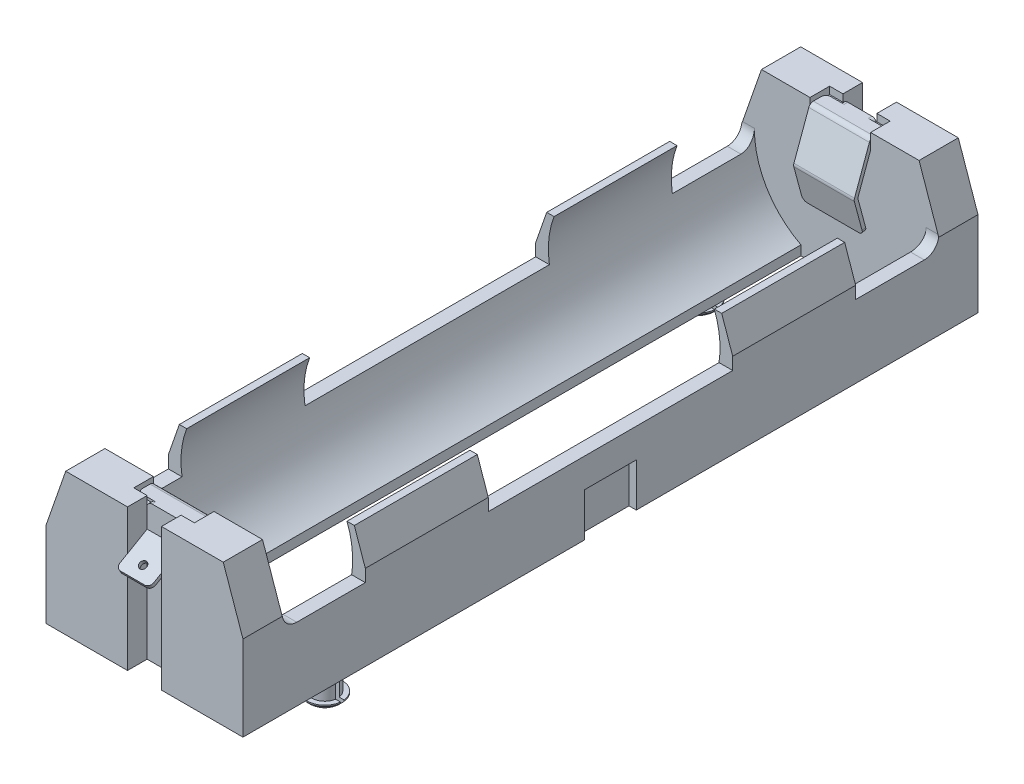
ISO-10303-21;
HEADER;
FILE_DESCRIPTION(('STEP AP214'),'2;1');
FILE_NAME('part.step','',(''),(''),'','','');
FILE_SCHEMA(('AUTOMOTIVE_DESIGN { 1 0 10303 214 1 1 1 1 }'));
ENDSEC;
DATA;
#1=APPLICATION_CONTEXT('core data for automotive mechanical design processes');
#2=APPLICATION_PROTOCOL_DEFINITION('international standard','automotive_design',2000,#1);
#3=PRODUCT_CONTEXT('',#1,'mechanical');
#4=PRODUCT('Part','Part','',(#3));
#5=PRODUCT_RELATED_PRODUCT_CATEGORY('part','',(#4));
#6=PRODUCT_DEFINITION_FORMATION('','',#4);
#7=PRODUCT_DEFINITION_CONTEXT('part definition',#1,'design');
#8=PRODUCT_DEFINITION('design','',#6,#7);
#9=PRODUCT_DEFINITION_SHAPE('','',#8);
#10=(LENGTH_UNIT() NAMED_UNIT(*) SI_UNIT(.MILLI.,.METRE.));
#11=(NAMED_UNIT(*) PLANE_ANGLE_UNIT() SI_UNIT($,.RADIAN.));
#12=(NAMED_UNIT(*) SI_UNIT($,.STERADIAN.) SOLID_ANGLE_UNIT());
#13=UNCERTAINTY_MEASURE_WITH_UNIT(LENGTH_MEASURE(1.E-05),#10,'distance_accuracy_value','');
#14=(GEOMETRIC_REPRESENTATION_CONTEXT(3) GLOBAL_UNCERTAINTY_ASSIGNED_CONTEXT((#13)) GLOBAL_UNIT_ASSIGNED_CONTEXT((#10,
#11,#12)) REPRESENTATION_CONTEXT('',''));
#15=CARTESIAN_POINT('',(0.,0.,0.));
#16=DIRECTION('',(0.,0.,1.));
#17=DIRECTION('',(1.,0.,0.));
#18=AXIS2_PLACEMENT_3D('',#15,#16,#17);
#19=CARTESIAN_POINT('',(3.175,11.4810443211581,36.2839));
#20=DIRECTION('',(0.,0.866025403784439,0.5));
#21=DIRECTION('',(0.,0.5,-0.866025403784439));
#22=AXIS2_PLACEMENT_3D('',#19,#20,#21);
#23=PLANE('',#22);
#24=CARTESIAN_POINT('',(0.,10.2110443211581,38.4836045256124));
#25=DIRECTION('',(0.,-0.866025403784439,-0.5));
#26=DIRECTION('',(0.,0.5,-0.866025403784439));
#27=AXIS2_PLACEMENT_3D('',#24,#25,#26);
#28=CIRCLE('',#27,0.380999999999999);
#29=CARTESIAN_POINT('',(0.,10.4015443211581,38.1536488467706));
#30=VERTEX_POINT('',#29);
#31=EDGE_CURVE('E1617',#30,#30,#28,.T.);
#32=ORIENTED_EDGE('',*,*,#31,.F.);
#33=EDGE_LOOP('',(#32));
#34=FACE_BOUND('',#33,.T.);
#35=DIRECTION('',(-1.,0.,0.));
#36=VECTOR('',#35,1.);
#37=CARTESIAN_POINT('',(3.175,11.3710590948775,36.4744));
#38=LINE('',#37,#36);
#39=CARTESIAN_POINT('',(1.77799999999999,11.3710590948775,36.4744));
#40=VERTEX_POINT('',#39);
#41=CARTESIAN_POINT('',(-1.77799999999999,11.3710590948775,36.4744));
#42=VERTEX_POINT('',#41);
#43=EDGE_CURVE('E1603',#40,#42,#38,.T.);
#44=ORIENTED_EDGE('',*,*,#43,.F.);
#45=DIRECTION('',(0.,0.5,-0.866025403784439));
#46=VECTOR('',#45,1.);
#47=CARTESIAN_POINT('',(1.778,11.4810443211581,36.2839));
#48=LINE('',#47,#46);
#49=CARTESIAN_POINT('',(1.77799999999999,10.1832186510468,38.5318));
#50=VERTEX_POINT('',#49);
#51=EDGE_CURVE('E1308',#50,#40,#48,.T.);
#52=ORIENTED_EDGE('',*,*,#51,.F.);
#53=CARTESIAN_POINT('',(1.778,9.83004432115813,39.1435158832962));
#54=VERTEX_POINT('',#53);
#55=EDGE_CURVE('E1309',#54,#50,#48,.T.);
#56=ORIENTED_EDGE('',*,*,#55,.F.);
#57=CARTESIAN_POINT('',(1.27,9.83004432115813,39.1435158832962));
#58=DIRECTION('',(0.,-0.866025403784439,-0.5));
#59=DIRECTION('',(0.,0.5,-0.866025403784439));
#60=AXIS2_PLACEMENT_3D('',#57,#58,#59);
#61=CIRCLE('',#60,0.508);
#62=CARTESIAN_POINT('',(1.27,9.57604432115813,39.5834567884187));
#63=VERTEX_POINT('',#62);
#64=EDGE_CURVE('E1366',#63,#54,#61,.F.);
#65=ORIENTED_EDGE('',*,*,#64,.F.);
#66=DIRECTION('',(-1.,0.,0.));
#67=VECTOR('',#66,1.);
#68=CARTESIAN_POINT('',(3.175,9.57604432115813,39.5834567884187));
#69=LINE('',#68,#67);
#70=CARTESIAN_POINT('',(-1.27,9.57604432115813,39.5834567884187));
#71=VERTEX_POINT('',#70);
#72=EDGE_CURVE('E1351',#63,#71,#69,.T.);
#73=ORIENTED_EDGE('',*,*,#72,.T.);
#74=CARTESIAN_POINT('',(-1.27,9.83004432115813,39.1435158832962));
#75=DIRECTION('',(0.,-0.866025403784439,-0.5));
#76=DIRECTION('',(0.,0.5,-0.866025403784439));
#77=AXIS2_PLACEMENT_3D('',#74,#75,#76);
#78=CIRCLE('',#77,0.508);
#79=CARTESIAN_POINT('',(-1.778,9.83004432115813,39.1435158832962));
#80=VERTEX_POINT('',#79);
#81=EDGE_CURVE('E1298',#80,#71,#78,.F.);
#82=ORIENTED_EDGE('',*,*,#81,.F.);
#83=DIRECTION('',(0.,-0.5,0.866025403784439));
#84=VECTOR('',#83,1.);
#85=CARTESIAN_POINT('',(-1.778,11.4810443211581,36.2839));
#86=LINE('',#85,#84);
#87=CARTESIAN_POINT('',(-1.77799999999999,10.1832186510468,38.5318));
#88=VERTEX_POINT('',#87);
#89=EDGE_CURVE('E1284',#88,#80,#86,.T.);
#90=ORIENTED_EDGE('',*,*,#89,.F.);
#91=EDGE_CURVE('E1295',#42,#88,#86,.T.);
#92=ORIENTED_EDGE('',*,*,#91,.F.);
#93=EDGE_LOOP('',(#44,#52,#56,#65,#73,#82,#90,#92));
#94=FACE_BOUND('',#93,.T.);
#95=ADVANCED_FACE('F39',(#34,#94),#23,.F.);
#96=CARTESIAN_POINT('',(1.778,10.4911772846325,35.7124));
#97=DIRECTION('',(-1.,0.,0.));
#98=DIRECTION('',(0.,0.,-1.));
#99=AXIS2_PLACEMENT_3D('',#96,#97,#98);
#100=PLANE('',#99);
#101=ORIENTED_EDGE('',*,*,#55,.T.);
#102=DIRECTION('',(0.,1.,0.));
#103=VECTOR('',#102,1.);
#104=CARTESIAN_POINT('',(1.778,10.4911772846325,38.5318));
#105=LINE('',#104,#103);
#106=CARTESIAN_POINT('',(1.77799999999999,10.6231595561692,38.5318));
#107=VERTEX_POINT('',#106);
#108=EDGE_CURVE('E12',#50,#107,#105,.T.);
#109=ORIENTED_EDGE('',*,*,#108,.T.);
#110=DIRECTION('',(0.,0.500000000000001,-0.866025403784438));
#111=VECTOR('',#110,1.);
#112=CARTESIAN_POINT('',(1.778,11.811,36.4744));
#113=LINE('',#112,#111);
#114=CARTESIAN_POINT('',(1.778,10.16,39.3340158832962));
#115=VERTEX_POINT('',#114);
#116=EDGE_CURVE('E1305',#115,#107,#113,.T.);
#117=ORIENTED_EDGE('',*,*,#116,.F.);
#118=DIRECTION('',(0.,0.866025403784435,0.500000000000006));
#119=VECTOR('',#118,1.);
#120=CARTESIAN_POINT('',(1.778,10.16,39.3340158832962));
#121=LINE('',#120,#119);
#122=EDGE_CURVE('E1353',#54,#115,#121,.T.);
#123=ORIENTED_EDGE('',*,*,#122,.F.);
#124=EDGE_LOOP('',(#101,#109,#117,#123));
#125=FACE_BOUND('',#124,.T.);
#126=ADVANCED_FACE('F1135',(#125),#100,.F.);
#127=CARTESIAN_POINT('',(-1.778,8.58617728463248,39.0119567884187));
#128=DIRECTION('',(1.,0.,0.));
#129=DIRECTION('',(0.,0.,1.));
#130=AXIS2_PLACEMENT_3D('',#127,#128,#129);
#131=PLANE('',#130);
#132=DIRECTION('',(0.,-0.500000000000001,0.866025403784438));
#133=VECTOR('',#132,1.);
#134=CARTESIAN_POINT('',(-1.778,9.90599999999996,39.7739567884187));
#135=LINE('',#134,#133);
#136=CARTESIAN_POINT('',(-1.77799999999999,10.6231595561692,38.5318));
#137=VERTEX_POINT('',#136);
#138=CARTESIAN_POINT('',(-1.778,10.16,39.3340158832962));
#139=VERTEX_POINT('',#138);
#140=EDGE_CURVE('E1286',#137,#139,#135,.T.);
#141=ORIENTED_EDGE('',*,*,#140,.F.);
#142=DIRECTION('',(0.,-1.,0.));
#143=VECTOR('',#142,1.);
#144=CARTESIAN_POINT('',(-1.778,8.58617728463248,38.5318));
#145=LINE('',#144,#143);
#146=EDGE_CURVE('E47',#137,#88,#145,.T.);
#147=ORIENTED_EDGE('',*,*,#146,.T.);
#148=ORIENTED_EDGE('',*,*,#89,.T.);
#149=DIRECTION('',(0.,0.866025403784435,0.500000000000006));
#150=VECTOR('',#149,1.);
#151=CARTESIAN_POINT('',(-1.778,9.83004432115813,39.1435158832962));
#152=LINE('',#151,#150);
#153=EDGE_CURVE('E1369',#139,#80,#152,.F.);
#154=ORIENTED_EDGE('',*,*,#153,.F.);
#155=EDGE_LOOP('',(#141,#147,#148,#154));
#156=FACE_BOUND('',#155,.T.);
#157=ADVANCED_FACE('F1141',(#156),#131,.F.);
#158=CARTESIAN_POINT('',(1.778,14.351,36.0934));
#159=DIRECTION('',(0.,0.,-1.));
#160=DIRECTION('',(1.,0.,0.));
#161=AXIS2_PLACEMENT_3D('',#158,#159,#160);
#162=PLANE('',#161);
#163=DIRECTION('',(-1.,0.,0.));
#164=VECTOR('',#163,1.);
#165=CARTESIAN_POINT('',(1.778,14.097,36.0934));
#166=LINE('',#165,#164);
#167=CARTESIAN_POINT('',(2.667,14.097,36.0934));
#168=VERTEX_POINT('',#167);
#169=CARTESIAN_POINT('',(1.7099409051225,14.097,36.0934));
#170=VERTEX_POINT('',#169);
#171=EDGE_CURVE('E1592',#168,#170,#166,.T.);
#172=ORIENTED_EDGE('',*,*,#171,.F.);
#173=DIRECTION('',(0.,-1.,0.));
#174=VECTOR('',#173,1.);
#175=CARTESIAN_POINT('',(2.667,14.351,36.0934));
#176=LINE('',#175,#174);
#177=CARTESIAN_POINT('',(2.667,14.351,36.0934));
#178=VERTEX_POINT('',#177);
#179=EDGE_CURVE('E1267',#178,#168,#176,.T.);
#180=ORIENTED_EDGE('',*,*,#179,.F.);
#181=DIRECTION('',(1.,0.,0.));
#182=VECTOR('',#181,1.);
#183=CARTESIAN_POINT('',(1.778,14.351,36.0934));
#184=LINE('',#183,#182);
#185=CARTESIAN_POINT('',(1.27,14.351,36.0934));
#186=VERTEX_POINT('',#185);
#187=EDGE_CURVE('E1612',#186,#178,#184,.T.);
#188=ORIENTED_EDGE('',*,*,#187,.F.);
#189=CARTESIAN_POINT('',(1.27,13.843,36.0934));
#190=DIRECTION('',(0.,0.,1.));
#191=DIRECTION('',(1.,0.,0.));
#192=AXIS2_PLACEMENT_3D('',#189,#190,#191);
#193=CIRCLE('',#192,0.508);
#194=EDGE_CURVE('E1275',#170,#186,#193,.T.);
#195=ORIENTED_EDGE('',*,*,#194,.F.);
#196=EDGE_LOOP('',(#172,#180,#188,#195));
#197=FACE_BOUND('',#196,.T.);
#198=ADVANCED_FACE('F1752',(#197),#162,.F.);
#199=CARTESIAN_POINT('',(-1.778,11.1567644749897,36.0934));
#200=DIRECTION('',(0.,0.,-1.));
#201=DIRECTION('',(1.,0.,0.));
#202=AXIS2_PLACEMENT_3D('',#199,#200,#201);
#203=PLANE('',#202);
#204=DIRECTION('',(-1.,0.,0.));
#205=VECTOR('',#204,1.);
#206=CARTESIAN_POINT('',(-1.778,14.097,36.0934));
#207=LINE('',#206,#205);
#208=CARTESIAN_POINT('',(-1.70994090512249,14.097,36.0934));
#209=VERTEX_POINT('',#208);
#210=CARTESIAN_POINT('',(-2.667,14.097,36.0934));
#211=VERTEX_POINT('',#210);
#212=EDGE_CURVE('E1598',#209,#211,#207,.T.);
#213=ORIENTED_EDGE('',*,*,#212,.F.);
#214=CARTESIAN_POINT('',(-1.27,13.843,36.0934));
#215=DIRECTION('',(0.,0.,1.));
#216=DIRECTION('',(1.,0.,0.));
#217=AXIS2_PLACEMENT_3D('',#214,#215,#216);
#218=CIRCLE('',#217,0.508);
#219=CARTESIAN_POINT('',(-1.27,14.351,36.0934));
#220=VERTEX_POINT('',#219);
#221=EDGE_CURVE('E62',#220,#209,#218,.T.);
#222=ORIENTED_EDGE('',*,*,#221,.F.);
#223=DIRECTION('',(-1.,0.,0.));
#224=VECTOR('',#223,1.);
#225=CARTESIAN_POINT('',(-1.778,14.351,36.0934));
#226=LINE('',#225,#224);
#227=CARTESIAN_POINT('',(-2.667,14.351,36.0934));
#228=VERTEX_POINT('',#227);
#229=EDGE_CURVE('E1608',#220,#228,#226,.T.);
#230=ORIENTED_EDGE('',*,*,#229,.T.);
#231=DIRECTION('',(0.,1.,0.));
#232=VECTOR('',#231,1.);
#233=CARTESIAN_POINT('',(-2.667,14.351,36.0934));
#234=LINE('',#233,#232);
#235=EDGE_CURVE('E1265',#211,#228,#234,.T.);
#236=ORIENTED_EDGE('',*,*,#235,.F.);
#237=EDGE_LOOP('',(#213,#222,#230,#236));
#238=FACE_BOUND('',#237,.T.);
#239=ADVANCED_FACE('F1172',(#238),#203,.F.);
#240=CARTESIAN_POINT('',(-1.27,13.843,39.0119567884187));
#241=DIRECTION('',(0.,0.,-1.));
#242=DIRECTION('',(0.,-1.,0.));
#243=AXIS2_PLACEMENT_3D('',#240,#241,#242);
#244=CYLINDRICAL_SURFACE('',#243,0.508);
#245=ORIENTED_EDGE('',*,*,#221,.T.);
#246=DIRECTION('',(0.,0.,-1.));
#247=VECTOR('',#246,1.);
#248=CARTESIAN_POINT('',(-1.7099409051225,14.097,39.0119567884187));
#249=LINE('',#248,#247);
#250=CARTESIAN_POINT('',(-1.7099409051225,14.097,36.4744));
#251=VERTEX_POINT('',#250);
#252=EDGE_CURVE('E1600',#209,#251,#249,.F.);
#253=ORIENTED_EDGE('',*,*,#252,.T.);
#254=CARTESIAN_POINT('',(-1.27,13.843,36.4744));
#255=DIRECTION('',(0.,0.,-1.));
#256=DIRECTION('',(0.,1.,0.));
#257=AXIS2_PLACEMENT_3D('',#254,#255,#256);
#258=CIRCLE('',#257,0.508);
#259=CARTESIAN_POINT('',(-1.27,14.351,36.4744));
#260=VERTEX_POINT('',#259);
#261=EDGE_CURVE('E1250',#251,#260,#258,.T.);
#262=ORIENTED_EDGE('',*,*,#261,.T.);
#263=DIRECTION('',(0.,0.,1.));
#264=VECTOR('',#263,1.);
#265=CARTESIAN_POINT('',(-1.27,14.351,36.0934));
#266=LINE('',#265,#264);
#267=EDGE_CURVE('E1263',#260,#220,#266,.F.);
#268=ORIENTED_EDGE('',*,*,#267,.T.);
#269=EDGE_LOOP('',(#245,#253,#262,#268));
#270=FACE_BOUND('',#269,.T.);
#271=ADVANCED_FACE('F1168',(#270),#244,.T.);
#272=CARTESIAN_POINT('',(1.27,13.843,35.7124));
#273=DIRECTION('',(0.,0.,1.));
#274=DIRECTION('',(0.,1.,0.));
#275=AXIS2_PLACEMENT_3D('',#272,#273,#274);
#276=CYLINDRICAL_SURFACE('',#275,0.508);
#277=CARTESIAN_POINT('',(1.27,13.843,36.4744));
#278=DIRECTION('',(0.,0.,-1.));
#279=DIRECTION('',(0.,1.,0.));
#280=AXIS2_PLACEMENT_3D('',#277,#278,#279);
#281=CIRCLE('',#280,0.508);
#282=CARTESIAN_POINT('',(1.27,14.351,36.4744));
#283=VERTEX_POINT('',#282);
#284=CARTESIAN_POINT('',(1.7099409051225,14.097,36.4744));
#285=VERTEX_POINT('',#284);
#286=EDGE_CURVE('E1247',#283,#285,#281,.T.);
#287=ORIENTED_EDGE('',*,*,#286,.T.);
#288=DIRECTION('',(0.,0.,1.));
#289=VECTOR('',#288,1.);
#290=CARTESIAN_POINT('',(1.7099409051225,14.097,35.7124));
#291=LINE('',#290,#289);
#292=EDGE_CURVE('E1594',#285,#170,#291,.F.);
#293=ORIENTED_EDGE('',*,*,#292,.T.);
#294=ORIENTED_EDGE('',*,*,#194,.T.);
#295=DIRECTION('',(0.,0.,-1.));
#296=VECTOR('',#295,1.);
#297=CARTESIAN_POINT('',(1.27,14.351,36.4744));
#298=LINE('',#297,#296);
#299=EDGE_CURVE('E1261',#186,#283,#298,.F.);
#300=ORIENTED_EDGE('',*,*,#299,.T.);
#301=EDGE_LOOP('',(#287,#293,#294,#300));
#302=FACE_BOUND('',#301,.T.);
#303=ADVANCED_FACE('F1171',(#302),#276,.T.);
#304=CARTESIAN_POINT('',(-2.667,11.1567644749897,35.5854));
#305=DIRECTION('',(0.,-1.,0.));
#306=DIRECTION('',(0.,0.,1.));
#307=AXIS2_PLACEMENT_3D('',#304,#305,#306);
#308=CYLINDRICAL_SURFACE('',#307,0.508);
#309=DIRECTION('',(0.,1.,0.));
#310=VECTOR('',#309,1.);
#311=CARTESIAN_POINT('',(-3.175,13.97,35.5854));
#312=LINE('',#311,#310);
#313=CARTESIAN_POINT('',(-3.17499999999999,14.351,35.5854));
#314=VERTEX_POINT('',#313);
#315=CARTESIAN_POINT('',(-3.17499999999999,14.097,35.5854));
#316=VERTEX_POINT('',#315);
#317=EDGE_CURVE('E1227',#314,#316,#312,.F.);
#318=ORIENTED_EDGE('',*,*,#317,.T.);
#319=CARTESIAN_POINT('',(-2.667,14.097,35.5854));
#320=DIRECTION('',(0.,-1.,0.));
#321=DIRECTION('',(0.,0.,-1.));
#322=AXIS2_PLACEMENT_3D('',#319,#320,#321);
#323=CIRCLE('',#322,0.508);
#324=EDGE_CURVE('E1378',#316,#211,#323,.F.);
#325=ORIENTED_EDGE('',*,*,#324,.T.);
#326=ORIENTED_EDGE('',*,*,#235,.T.);
#327=CARTESIAN_POINT('',(-2.667,14.351,35.5854));
#328=DIRECTION('',(0.,-1.,0.));
#329=DIRECTION('',(0.,0.,-1.));
#330=AXIS2_PLACEMENT_3D('',#327,#328,#329);
#331=CIRCLE('',#330,0.508);
#332=EDGE_CURVE('E1258',#228,#314,#331,.T.);
#333=ORIENTED_EDGE('',*,*,#332,.T.);
#334=EDGE_LOOP('',(#318,#325,#326,#333));
#335=FACE_BOUND('',#334,.T.);
#336=ADVANCED_FACE('F1176',(#335),#308,.T.);
#337=CARTESIAN_POINT('',(2.667,14.351,35.5854));
#338=DIRECTION('',(0.,-1.,0.));
#339=DIRECTION('',(0.,0.,1.));
#340=AXIS2_PLACEMENT_3D('',#337,#338,#339);
#341=CYLINDRICAL_SURFACE('',#340,0.508);
#342=ORIENTED_EDGE('',*,*,#179,.T.);
#343=CARTESIAN_POINT('',(2.667,14.097,35.5854));
#344=DIRECTION('',(0.,-1.,0.));
#345=DIRECTION('',(0.,0.,-1.));
#346=AXIS2_PLACEMENT_3D('',#343,#344,#345);
#347=CIRCLE('',#346,0.508);
#348=CARTESIAN_POINT('',(3.17499999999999,14.097,35.5854));
#349=VERTEX_POINT('',#348);
#350=EDGE_CURVE('E1277',#168,#349,#347,.F.);
#351=ORIENTED_EDGE('',*,*,#350,.T.);
#352=DIRECTION('',(0.,-1.,0.));
#353=VECTOR('',#352,1.);
#354=CARTESIAN_POINT('',(3.17499999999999,14.351,35.5854));
#355=LINE('',#354,#353);
#356=CARTESIAN_POINT('',(3.17499999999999,14.351,35.5854));
#357=VERTEX_POINT('',#356);
#358=EDGE_CURVE('E1584',#349,#357,#355,.F.);
#359=ORIENTED_EDGE('',*,*,#358,.T.);
#360=CARTESIAN_POINT('',(2.667,14.351,35.5854));
#361=DIRECTION('',(0.,-1.,0.));
#362=DIRECTION('',(0.,0.,-1.));
#363=AXIS2_PLACEMENT_3D('',#360,#361,#362);
#364=CIRCLE('',#363,0.508);
#365=EDGE_CURVE('E1255',#357,#178,#364,.T.);
#366=ORIENTED_EDGE('',*,*,#365,.T.);
#367=EDGE_LOOP('',(#342,#351,#359,#366));
#368=FACE_BOUND('',#367,.T.);
#369=ADVANCED_FACE('F1180',(#368),#341,.T.);
#370=CARTESIAN_POINT('',(3.175,14.351,36.4744));
#371=DIRECTION('',(0.,0.,1.));
#372=DIRECTION('',(0.,1.,0.));
#373=AXIS2_PLACEMENT_3D('',#370,#371,#372);
#374=PLANE('',#373);
#375=DIRECTION('',(1.,0.,0.));
#376=VECTOR('',#375,1.);
#377=CARTESIAN_POINT('',(-3.17499999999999,14.097,36.4744));
#378=LINE('',#377,#376);
#379=CARTESIAN_POINT('',(1.77799999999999,14.097,36.4744));
#380=VERTEX_POINT('',#379);
#381=EDGE_CURVE('E1396',#285,#380,#378,.T.);
#382=ORIENTED_EDGE('',*,*,#381,.F.);
#383=ORIENTED_EDGE('',*,*,#286,.F.);
#384=DIRECTION('',(-1.,0.,0.));
#385=VECTOR('',#384,1.);
#386=CARTESIAN_POINT('',(3.175,14.351,36.4744));
#387=LINE('',#386,#385);
#388=EDGE_CURVE('E1342',#283,#260,#387,.T.);
#389=ORIENTED_EDGE('',*,*,#388,.T.);
#390=ORIENTED_EDGE('',*,*,#261,.F.);
#391=CARTESIAN_POINT('',(-1.77799999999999,14.097,36.4744));
#392=VERTEX_POINT('',#391);
#393=EDGE_CURVE('E1398',#392,#251,#378,.T.);
#394=ORIENTED_EDGE('',*,*,#393,.F.);
#395=DIRECTION('',(0.,-1.,0.));
#396=VECTOR('',#395,1.);
#397=CARTESIAN_POINT('',(-1.778,14.351,36.4744));
#398=LINE('',#397,#396);
#399=CARTESIAN_POINT('',(-1.77799999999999,11.811,36.4744));
#400=VERTEX_POINT('',#399);
#401=EDGE_CURVE('E1605',#392,#400,#398,.T.);
#402=ORIENTED_EDGE('',*,*,#401,.T.);
#403=DIRECTION('',(-1.,0.,0.));
#404=VECTOR('',#403,1.);
#405=CARTESIAN_POINT('',(3.175,11.811,36.4744));
#406=LINE('',#405,#404);
#407=CARTESIAN_POINT('',(1.77799999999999,11.811,36.4744));
#408=VERTEX_POINT('',#407);
#409=EDGE_CURVE('E1345',#408,#400,#406,.T.);
#410=ORIENTED_EDGE('',*,*,#409,.F.);
#411=DIRECTION('',(0.,1.,0.));
#412=VECTOR('',#411,1.);
#413=CARTESIAN_POINT('',(1.778,14.351,36.4744));
#414=LINE('',#413,#412);
#415=EDGE_CURVE('E1610',#408,#380,#414,.T.);
#416=ORIENTED_EDGE('',*,*,#415,.T.);
#417=EDGE_LOOP('',(#382,#383,#389,#390,#394,#402,#410,#416));
#418=FACE_BOUND('',#417,.T.);
#419=ADVANCED_FACE('F1183',(#418),#374,.T.);
#420=CARTESIAN_POINT('',(3.175,9.906,39.7739567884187));
#421=DIRECTION('',(0.,-0.500000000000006,0.866025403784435));
#422=DIRECTION('',(0.,0.866025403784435,0.500000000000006));
#423=AXIS2_PLACEMENT_3D('',#420,#421,#422);
#424=PLANE('',#423);
#425=DIRECTION('',(-1.,0.,0.));
#426=VECTOR('',#425,1.);
#427=CARTESIAN_POINT('',(3.175,9.906,39.7739567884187));
#428=LINE('',#427,#426);
#429=CARTESIAN_POINT('',(1.27,9.906,39.7739567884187));
#430=VERTEX_POINT('',#429);
#431=CARTESIAN_POINT('',(-1.27,9.906,39.7739567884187));
#432=VERTEX_POINT('',#431);
#433=EDGE_CURVE('E1348',#430,#432,#428,.T.);
#434=ORIENTED_EDGE('',*,*,#433,.T.);
#435=DIRECTION('',(0.,0.866025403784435,0.500000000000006));
#436=VECTOR('',#435,1.);
#437=CARTESIAN_POINT('',(-1.27,9.90599999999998,39.7739567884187));
#438=LINE('',#437,#436);
#439=EDGE_CURVE('E1360',#71,#432,#438,.T.);
#440=ORIENTED_EDGE('',*,*,#439,.F.);
#441=ORIENTED_EDGE('',*,*,#72,.F.);
#442=DIRECTION('',(0.,0.866025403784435,0.500000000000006));
#443=VECTOR('',#442,1.);
#444=CARTESIAN_POINT('',(1.27,9.57604432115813,39.5834567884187));
#445=LINE('',#444,#443);
#446=EDGE_CURVE('E1363',#430,#63,#445,.F.);
#447=ORIENTED_EDGE('',*,*,#446,.F.);
#448=EDGE_LOOP('',(#434,#440,#441,#447));
#449=FACE_BOUND('',#448,.T.);
#450=ADVANCED_FACE('F1148',(#449),#424,.T.);
#451=CARTESIAN_POINT('',(3.175,11.811,36.4744));
#452=DIRECTION('',(0.,0.866025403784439,0.5));
#453=DIRECTION('',(0.,0.5,-0.866025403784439));
#454=AXIS2_PLACEMENT_3D('',#451,#452,#453);
#455=PLANE('',#454);
#456=CARTESIAN_POINT('',(0.,10.541,38.6741045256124));
#457=DIRECTION('',(0.,-0.866025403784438,-0.500000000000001));
#458=DIRECTION('',(0.,0.500000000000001,-0.866025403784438));
#459=AXIS2_PLACEMENT_3D('',#456,#457,#458);
#460=CIRCLE('',#459,0.380999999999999);
#461=CARTESIAN_POINT('',(0.,10.7315,38.3441488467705));
#462=VERTEX_POINT('',#461);
#463=EDGE_CURVE('E1615',#462,#462,#460,.T.);
#464=ORIENTED_EDGE('',*,*,#463,.T.);
#465=EDGE_LOOP('',(#464));
#466=FACE_BOUND('',#465,.T.);
#467=ORIENTED_EDGE('',*,*,#116,.T.);
#468=EDGE_CURVE('E1301',#107,#408,#113,.T.);
#469=ORIENTED_EDGE('',*,*,#468,.T.);
#470=ORIENTED_EDGE('',*,*,#409,.T.);
#471=EDGE_CURVE('E1299',#400,#137,#135,.T.);
#472=ORIENTED_EDGE('',*,*,#471,.T.);
#473=ORIENTED_EDGE('',*,*,#140,.T.);
#474=CARTESIAN_POINT('',(-1.27,10.16,39.3340158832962));
#475=DIRECTION('',(0.,-0.866025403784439,-0.5));
#476=DIRECTION('',(0.,0.5,-0.866025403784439));
#477=AXIS2_PLACEMENT_3D('',#474,#475,#476);
#478=CIRCLE('',#477,0.508);
#479=EDGE_CURVE('E1355',#432,#139,#478,.T.);
#480=ORIENTED_EDGE('',*,*,#479,.F.);
#481=ORIENTED_EDGE('',*,*,#433,.F.);
#482=CARTESIAN_POINT('',(1.27,10.16,39.3340158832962));
#483=DIRECTION('',(0.,-0.866025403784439,-0.5));
#484=DIRECTION('',(0.,0.5,-0.866025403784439));
#485=AXIS2_PLACEMENT_3D('',#482,#483,#484);
#486=CIRCLE('',#485,0.508);
#487=EDGE_CURVE('E1358',#115,#430,#486,.T.);
#488=ORIENTED_EDGE('',*,*,#487,.F.);
#489=EDGE_LOOP('',(#467,#469,#470,#472,#473,#480,#481,#488));
#490=FACE_BOUND('',#489,.T.);
#491=ADVANCED_FACE('F1621',(#466,#490),#455,.T.);
#492=CARTESIAN_POINT('',(3.175,14.351,36.4744));
#493=DIRECTION('',(0.,1.,0.));
#494=DIRECTION('',(0.,0.,-1.));
#495=AXIS2_PLACEMENT_3D('',#492,#493,#494);
#496=PLANE('',#495);
#497=ORIENTED_EDGE('',*,*,#388,.F.);
#498=ORIENTED_EDGE('',*,*,#299,.F.);
#499=ORIENTED_EDGE('',*,*,#187,.T.);
#500=ORIENTED_EDGE('',*,*,#365,.F.);
#501=DIRECTION('',(0.,0.,1.));
#502=VECTOR('',#501,1.);
#503=CARTESIAN_POINT('',(3.175,14.351,36.4744));
#504=LINE('',#503,#502);
#505=CARTESIAN_POINT('',(3.17499999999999,14.351,34.7727054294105));
#506=VERTEX_POINT('',#505);
#507=EDGE_CURVE('E1313',#506,#357,#504,.T.);
#508=ORIENTED_EDGE('',*,*,#507,.F.);
#509=DIRECTION('',(-1.,0.,0.));
#510=VECTOR('',#509,1.);
#511=CARTESIAN_POINT('',(3.175,14.351,34.7727054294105));
#512=LINE('',#511,#510);
#513=CARTESIAN_POINT('',(-3.17499999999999,14.351,34.7727054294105));
#514=VERTEX_POINT('',#513);
#515=EDGE_CURVE('E1252',#514,#506,#512,.F.);
#516=ORIENTED_EDGE('',*,*,#515,.F.);
#517=DIRECTION('',(0.,0.,1.));
#518=VECTOR('',#517,1.);
#519=CARTESIAN_POINT('',(-3.175,14.351,36.4744));
#520=LINE('',#519,#518);
#521=EDGE_CURVE('E1312',#514,#314,#520,.T.);
#522=ORIENTED_EDGE('',*,*,#521,.T.);
#523=ORIENTED_EDGE('',*,*,#332,.F.);
#524=ORIENTED_EDGE('',*,*,#229,.F.);
#525=ORIENTED_EDGE('',*,*,#267,.F.);
#526=EDGE_LOOP('',(#497,#498,#499,#500,#508,#516,#522,#523,#524,#525));
#527=FACE_BOUND('',#526,.T.);
#528=ADVANCED_FACE('F1749',(#527),#496,.T.);
#529=CARTESIAN_POINT('',(3.175,14.351,34.417));
#530=DIRECTION('',(0.,0.34202014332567,-0.939692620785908));
#531=DIRECTION('',(0.,-0.939692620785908,-0.34202014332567));
#532=AXIS2_PLACEMENT_3D('',#529,#530,#531);
#533=PLANE('',#532);
#534=DIRECTION('',(0.,0.939692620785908,0.34202014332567));
#535=VECTOR('',#534,1.);
#536=CARTESIAN_POINT('',(-3.175,14.351,34.417));
#537=LINE('',#536,#535);
#538=CARTESIAN_POINT('',(-3.175,9.72787373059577,32.7343196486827));
#539=VERTEX_POINT('',#538);
#540=CARTESIAN_POINT('',(-3.175,14.0167462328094,34.2953415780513));
#541=VERTEX_POINT('',#540);
#542=EDGE_CURVE('E1325',#539,#541,#537,.T.);
#543=ORIENTED_EDGE('',*,*,#542,.T.);
#544=DIRECTION('',(-1.,0.,0.));
#545=VECTOR('',#544,1.);
#546=CARTESIAN_POINT('',(3.175,14.0167462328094,34.2953415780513));
#547=LINE('',#546,#545);
#548=CARTESIAN_POINT('',(3.175,14.0167462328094,34.2953415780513));
#549=VERTEX_POINT('',#548);
#550=EDGE_CURVE('E1270',#549,#541,#547,.T.);
#551=ORIENTED_EDGE('',*,*,#550,.F.);
#552=DIRECTION('',(0.,0.939692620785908,0.34202014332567));
#553=VECTOR('',#552,1.);
#554=CARTESIAN_POINT('',(3.175,14.351,34.417));
#555=LINE('',#554,#553);
#556=CARTESIAN_POINT('',(3.175,9.72787373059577,32.7343196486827));
#557=VERTEX_POINT('',#556);
#558=EDGE_CURVE('E1216',#557,#549,#555,.T.);
#559=ORIENTED_EDGE('',*,*,#558,.F.);
#560=DIRECTION('',(-1.,0.,0.));
#561=VECTOR('',#560,1.);
#562=CARTESIAN_POINT('',(3.175,9.72787373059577,32.7343196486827));
#563=LINE('',#562,#561);
#564=EDGE_CURVE('E1200',#539,#557,#563,.F.);
#565=ORIENTED_EDGE('',*,*,#564,.F.);
#566=EDGE_LOOP('',(#543,#551,#559,#565));
#567=FACE_BOUND('',#566,.T.);
#568=ADVANCED_FACE('F1788',(#567),#533,.T.);
#569=CARTESIAN_POINT('',(3.175,9.57736148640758,32.6795376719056));
#570=DIRECTION('',(0.,-0.258819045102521,-0.965925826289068));
#571=DIRECTION('',(0.,-0.965925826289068,0.258819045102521));
#572=AXIS2_PLACEMENT_3D('',#569,#570,#571);
#573=PLANE('',#572);
#574=DIRECTION('',(0.,0.965925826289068,-0.258819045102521));
#575=VECTOR('',#574,1.);
#576=CARTESIAN_POINT('',(-3.175,9.57736148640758,32.6795376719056));
#577=LINE('',#576,#575);
#578=CARTESIAN_POINT('',(-3.175,6.38787440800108,33.5341581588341));
#579=VERTEX_POINT('',#578);
#580=CARTESIAN_POINT('',(-3.175,9.42264742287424,32.7209931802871));
#581=VERTEX_POINT('',#580);
#582=EDGE_CURVE('E1221',#579,#581,#577,.T.);
#583=ORIENTED_EDGE('',*,*,#582,.T.);
#584=DIRECTION('',(-1.,0.,0.));
#585=VECTOR('',#584,1.);
#586=CARTESIAN_POINT('',(3.175,9.42264742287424,32.7209931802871));
#587=LINE('',#586,#585);
#588=CARTESIAN_POINT('',(3.175,9.42264742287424,32.7209931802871));
#589=VERTEX_POINT('',#588);
#590=EDGE_CURVE('E1197',#589,#581,#587,.T.);
#591=ORIENTED_EDGE('',*,*,#590,.F.);
#592=DIRECTION('',(0.,0.965925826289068,-0.258819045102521));
#593=VECTOR('',#592,1.);
#594=CARTESIAN_POINT('',(3.175,9.57736148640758,32.6795376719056));
#595=LINE('',#594,#593);
#596=CARTESIAN_POINT('',(3.175,6.38787440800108,33.5341581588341));
#597=VERTEX_POINT('',#596);
#598=EDGE_CURVE('E1208',#597,#589,#595,.T.);
#599=ORIENTED_EDGE('',*,*,#598,.F.);
#600=CARTESIAN_POINT('',(2.667,6.38787440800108,33.5341581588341));
#601=DIRECTION('',(0.,0.258819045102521,0.965925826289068));
#602=DIRECTION('',(0.,-0.965925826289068,0.258819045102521));
#603=AXIS2_PLACEMENT_3D('',#600,#601,#602);
#604=CIRCLE('',#603,0.508);
#605=CARTESIAN_POINT('',(2.667,5.89718408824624,33.6656382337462));
#606=VERTEX_POINT('',#605);
#607=EDGE_CURVE('E1222',#606,#597,#604,.T.);
#608=ORIENTED_EDGE('',*,*,#607,.F.);
#609=DIRECTION('',(-1.,0.,0.));
#610=VECTOR('',#609,1.);
#611=CARTESIAN_POINT('',(3.175,5.89718408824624,33.6656382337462));
#612=LINE('',#611,#610);
#613=CARTESIAN_POINT('',(-2.667,5.89718408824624,33.6656382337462));
#614=VERTEX_POINT('',#613);
#615=EDGE_CURVE('E1339',#606,#614,#612,.T.);
#616=ORIENTED_EDGE('',*,*,#615,.T.);
#617=CARTESIAN_POINT('',(-2.667,6.38787440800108,33.5341581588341));
#618=DIRECTION('',(0.,0.258819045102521,0.965925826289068));
#619=DIRECTION('',(0.,-0.965925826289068,0.258819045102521));
#620=AXIS2_PLACEMENT_3D('',#617,#618,#619);
#621=CIRCLE('',#620,0.508);
#622=EDGE_CURVE('E1225',#579,#614,#621,.T.);
#623=ORIENTED_EDGE('',*,*,#622,.F.);
#624=EDGE_LOOP('',(#583,#591,#599,#608,#616,#623));
#625=FACE_BOUND('',#624,.T.);
#626=ADVANCED_FACE('F1218',(#625),#573,.T.);
#627=CARTESIAN_POINT('',(3.175,5.9957941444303,34.0336559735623));
#628=DIRECTION('',(0.,-0.965925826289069,0.258819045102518));
#629=DIRECTION('',(0.,0.258819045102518,0.965925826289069));
#630=AXIS2_PLACEMENT_3D('',#627,#628,#629);
#631=PLANE('',#630);
#632=ORIENTED_EDGE('',*,*,#615,.F.);
#633=DIRECTION('',(0.,-0.258819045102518,-0.965925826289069));
#634=VECTOR('',#633,1.);
#635=CARTESIAN_POINT('',(2.667,5.89718408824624,33.6656382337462));
#636=LINE('',#635,#634);
#637=CARTESIAN_POINT('',(2.667,5.9957941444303,34.0336559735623));
#638=VERTEX_POINT('',#637);
#639=EDGE_CURVE('E1233',#638,#606,#636,.T.);
#640=ORIENTED_EDGE('',*,*,#639,.F.);
#641=DIRECTION('',(-1.,0.,0.));
#642=VECTOR('',#641,1.);
#643=CARTESIAN_POINT('',(3.175,5.9957941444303,34.0336559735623));
#644=LINE('',#643,#642);
#645=CARTESIAN_POINT('',(-2.667,5.9957941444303,34.0336559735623));
#646=VERTEX_POINT('',#645);
#647=EDGE_CURVE('E1336',#638,#646,#644,.T.);
#648=ORIENTED_EDGE('',*,*,#647,.T.);
#649=DIRECTION('',(0.,-0.258819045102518,-0.965925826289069));
#650=VECTOR('',#649,1.);
#651=CARTESIAN_POINT('',(-2.667,5.9957941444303,34.0336559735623));
#652=LINE('',#651,#650);
#653=EDGE_CURVE('E1235',#614,#646,#652,.F.);
#654=ORIENTED_EDGE('',*,*,#653,.F.);
#655=EDGE_LOOP('',(#632,#640,#648,#654));
#656=FACE_BOUND('',#655,.T.);
#657=ADVANCED_FACE('F1781',(#656),#631,.T.);
#658=CARTESIAN_POINT('',(3.175,9.67597154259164,33.0475554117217));
#659=DIRECTION('',(0.,-0.258819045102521,-0.965925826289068));
#660=DIRECTION('',(0.,-0.965925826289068,0.258819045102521));
#661=AXIS2_PLACEMENT_3D('',#658,#659,#660);
#662=PLANE('',#661);
#663=ORIENTED_EDGE('',*,*,#647,.F.);
#664=CARTESIAN_POINT('',(2.667,6.48648446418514,33.9021758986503));
#665=DIRECTION('',(0.,0.258819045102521,0.965925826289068));
#666=DIRECTION('',(0.,-0.965925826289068,0.258819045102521));
#667=AXIS2_PLACEMENT_3D('',#664,#665,#666);
#668=CIRCLE('',#667,0.508);
#669=CARTESIAN_POINT('',(3.175,6.48648446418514,33.9021758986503));
#670=VERTEX_POINT('',#669);
#671=EDGE_CURVE('E1238',#670,#638,#668,.F.);
#672=ORIENTED_EDGE('',*,*,#671,.F.);
#673=DIRECTION('',(0.,0.965925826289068,-0.258819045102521));
#674=VECTOR('',#673,1.);
#675=CARTESIAN_POINT('',(3.175,9.67597154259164,33.0475554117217));
#676=LINE('',#675,#674);
#677=CARTESIAN_POINT('',(3.175,9.55993599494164,33.0786470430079));
#678=VERTEX_POINT('',#677);
#679=EDGE_CURVE('E1215',#670,#678,#676,.T.);
#680=ORIENTED_EDGE('',*,*,#679,.T.);
#681=DIRECTION('',(-1.,0.,0.));
#682=VECTOR('',#681,1.);
#683=CARTESIAN_POINT('',(3.175,9.55993599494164,33.0786470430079));
#684=LINE('',#683,#682);
#685=CARTESIAN_POINT('',(-3.175,9.55993599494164,33.0786470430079));
#686=VERTEX_POINT('',#685);
#687=EDGE_CURVE('E1322',#678,#686,#684,.T.);
#688=ORIENTED_EDGE('',*,*,#687,.T.);
#689=DIRECTION('',(0.,0.965925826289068,-0.258819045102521));
#690=VECTOR('',#689,1.);
#691=CARTESIAN_POINT('',(-3.175,9.67597154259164,33.0475554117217));
#692=LINE('',#691,#690);
#693=CARTESIAN_POINT('',(-3.175,6.48648446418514,33.9021758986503));
#694=VERTEX_POINT('',#693);
#695=EDGE_CURVE('E1329',#694,#686,#692,.T.);
#696=ORIENTED_EDGE('',*,*,#695,.F.);
#697=CARTESIAN_POINT('',(-2.667,6.48648446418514,33.9021758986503));
#698=DIRECTION('',(0.,0.258819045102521,0.965925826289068));
#699=DIRECTION('',(0.,-0.965925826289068,0.258819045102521));
#700=AXIS2_PLACEMENT_3D('',#697,#698,#699);
#701=CIRCLE('',#700,0.508);
#702=EDGE_CURVE('E1240',#646,#694,#701,.F.);
#703=ORIENTED_EDGE('',*,*,#702,.F.);
#704=EDGE_LOOP('',(#663,#672,#680,#688,#696,#703));
#705=FACE_BOUND('',#704,.T.);
#706=ADVANCED_FACE('F1777',(#705),#662,.F.);
#707=CARTESIAN_POINT('',(3.175,14.2206903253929,34.7750228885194));
#708=DIRECTION('',(0.,0.34202014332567,-0.939692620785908));
#709=DIRECTION('',(0.,-0.939692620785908,-0.34202014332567));
#710=AXIS2_PLACEMENT_3D('',#707,#708,#709);
#711=PLANE('',#710);
#712=DIRECTION('',(0.,0.939692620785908,0.34202014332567));
#713=VECTOR('',#712,1.);
#714=CARTESIAN_POINT('',(3.175,14.2206903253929,34.7750228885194));
#715=LINE('',#714,#713);
#716=CARTESIAN_POINT('',(3.175,13.2370305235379,34.417));
#717=VERTEX_POINT('',#716);
#718=EDGE_CURVE('E1319',#678,#717,#715,.T.);
#719=ORIENTED_EDGE('',*,*,#718,.T.);
#720=DIRECTION('',(-1.,0.,0.));
#721=VECTOR('',#720,1.);
#722=CARTESIAN_POINT('',(3.175,13.2370305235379,34.417));
#723=LINE('',#722,#721);
#724=CARTESIAN_POINT('',(-3.175,13.2370305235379,34.417));
#725=VERTEX_POINT('',#724);
#726=EDGE_CURVE('E1589',#717,#725,#723,.T.);
#727=ORIENTED_EDGE('',*,*,#726,.T.);
#728=DIRECTION('',(0.,0.939692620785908,0.34202014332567));
#729=VECTOR('',#728,1.);
#730=CARTESIAN_POINT('',(-3.175,14.2206903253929,34.7750228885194));
#731=LINE('',#730,#729);
#732=EDGE_CURVE('E1315',#686,#725,#731,.T.);
#733=ORIENTED_EDGE('',*,*,#732,.F.);
#734=ORIENTED_EDGE('',*,*,#687,.F.);
#735=EDGE_LOOP('',(#719,#727,#733,#734));
#736=FACE_BOUND('',#735,.T.);
#737=ADVANCED_FACE('F1771',(#736),#711,.F.);
#738=CARTESIAN_POINT('',(3.175,0.,0.));
#739=DIRECTION('',(-1.,0.,0.));
#740=DIRECTION('',(0.,0.,-1.));
#741=AXIS2_PLACEMENT_3D('',#738,#739,#740);
#742=PLANE('',#741);
#743=CARTESIAN_POINT('',(3.175,13.843,34.7727054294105));
#744=DIRECTION('',(1.,0.,0.));
#745=DIRECTION('',(0.,0.,-1.));
#746=AXIS2_PLACEMENT_3D('',#743,#744,#745);
#747=CIRCLE('',#746,0.508);
#748=CARTESIAN_POINT('',(3.175,14.2056811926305,34.417));
#749=VERTEX_POINT('',#748);
#750=EDGE_CURVE('E1243',#749,#549,#747,.F.);
#751=ORIENTED_EDGE('',*,*,#750,.F.);
#752=DIRECTION('',(0.,1.,0.));
#753=VECTOR('',#752,1.);
#754=CARTESIAN_POINT('',(3.17499999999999,14.097,34.417));
#755=LINE('',#754,#753);
#756=EDGE_CURVE('E54',#717,#749,#755,.T.);
#757=ORIENTED_EDGE('',*,*,#756,.F.);
#758=ORIENTED_EDGE('',*,*,#718,.F.);
#759=ORIENTED_EDGE('',*,*,#679,.F.);
#760=DIRECTION('',(0.,-0.258819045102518,-0.965925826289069));
#761=VECTOR('',#760,1.);
#762=CARTESIAN_POINT('',(3.175,6.48648446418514,33.9021758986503));
#763=LINE('',#762,#761);
#764=EDGE_CURVE('E1204',#597,#670,#763,.F.);
#765=ORIENTED_EDGE('',*,*,#764,.F.);
#766=ORIENTED_EDGE('',*,*,#598,.T.);
#767=CARTESIAN_POINT('',(3.175,9.55412749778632,33.2116835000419));
#768=DIRECTION('',(1.,0.,0.));
#769=DIRECTION('',(0.,0.,-1.));
#770=AXIS2_PLACEMENT_3D('',#767,#768,#769);
#771=CIRCLE('',#770,0.508);
#772=EDGE_CURVE('E1194',#557,#589,#771,.F.);
#773=ORIENTED_EDGE('',*,*,#772,.F.);
#774=ORIENTED_EDGE('',*,*,#558,.T.);
#775=EDGE_LOOP('',(#751,#757,#758,#759,#765,#766,#773,#774));
#776=FACE_BOUND('',#775,.T.);
#777=ADVANCED_FACE('F1210',(#776),#742,.F.);
#778=CARTESIAN_POINT('',(-3.175,0.,0.));
#779=DIRECTION('',(-1.,0.,0.));
#780=DIRECTION('',(0.,0.,-1.));
#781=AXIS2_PLACEMENT_3D('',#778,#779,#780);
#782=PLANE('',#781);
#783=DIRECTION('',(0.,-1.,0.));
#784=VECTOR('',#783,1.);
#785=CARTESIAN_POINT('',(-3.175,0.,34.417));
#786=LINE('',#785,#784);
#787=CARTESIAN_POINT('',(-3.17499999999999,14.2056811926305,34.417));
#788=VERTEX_POINT('',#787);
#789=EDGE_CURVE('E1587',#788,#725,#786,.T.);
#790=ORIENTED_EDGE('',*,*,#789,.F.);
#791=CARTESIAN_POINT('',(-3.175,13.843,34.7727054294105));
#792=DIRECTION('',(1.,0.,0.));
#793=DIRECTION('',(0.,0.,-1.));
#794=AXIS2_PLACEMENT_3D('',#791,#792,#793);
#795=CIRCLE('',#794,0.508);
#796=EDGE_CURVE('E1372',#541,#788,#795,.T.);
#797=ORIENTED_EDGE('',*,*,#796,.F.);
#798=ORIENTED_EDGE('',*,*,#542,.F.);
#799=CARTESIAN_POINT('',(-3.175,9.55412749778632,33.2116835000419));
#800=DIRECTION('',(1.,0.,0.));
#801=DIRECTION('',(0.,0.,-1.));
#802=AXIS2_PLACEMENT_3D('',#799,#800,#801);
#803=CIRCLE('',#802,0.508);
#804=EDGE_CURVE('E1375',#581,#539,#803,.T.);
#805=ORIENTED_EDGE('',*,*,#804,.F.);
#806=ORIENTED_EDGE('',*,*,#582,.F.);
#807=DIRECTION('',(0.,-0.258819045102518,-0.965925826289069));
#808=VECTOR('',#807,1.);
#809=CARTESIAN_POINT('',(-3.175,-2.42357157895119,0.649394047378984));
#810=LINE('',#809,#808);
#811=EDGE_CURVE('E1223',#694,#579,#810,.T.);
#812=ORIENTED_EDGE('',*,*,#811,.F.);
#813=ORIENTED_EDGE('',*,*,#695,.T.);
#814=ORIENTED_EDGE('',*,*,#732,.T.);
#815=EDGE_LOOP('',(#790,#797,#798,#805,#806,#812,#813,#814));
#816=FACE_BOUND('',#815,.T.);
#817=ADVANCED_FACE('F1765',(#816),#782,.T.);
#818=CARTESIAN_POINT('',(0.,9.22117728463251,37.9121045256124));
#819=DIRECTION('',(0.,0.866025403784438,0.500000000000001));
#820=DIRECTION('',(0.,0.500000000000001,-0.866025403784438));
#821=AXIS2_PLACEMENT_3D('',#818,#819,#820);
#822=CYLINDRICAL_SURFACE('',#821,0.380999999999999);
#823=ORIENTED_EDGE('',*,*,#463,.F.);
#824=EDGE_LOOP('',(#823));
#825=FACE_BOUND('',#824,.T.);
#826=ORIENTED_EDGE('',*,*,#31,.T.);
#827=EDGE_LOOP('',(#826));
#828=FACE_BOUND('',#827,.T.);
#829=ADVANCED_FACE('F1154',(#825,#828),#822,.F.);
#830=CARTESIAN_POINT('',(1.27,8.84017728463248,38.5720158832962));
#831=DIRECTION('',(0.,-0.866025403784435,-0.500000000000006));
#832=DIRECTION('',(0.,-0.500000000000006,0.866025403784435));
#833=AXIS2_PLACEMENT_3D('',#830,#831,#832);
#834=CYLINDRICAL_SURFACE('',#833,0.508);
#835=ORIENTED_EDGE('',*,*,#64,.T.);
#836=ORIENTED_EDGE('',*,*,#122,.T.);
#837=ORIENTED_EDGE('',*,*,#487,.T.);
#838=ORIENTED_EDGE('',*,*,#446,.T.);
#839=EDGE_LOOP('',(#835,#836,#837,#838));
#840=FACE_BOUND('',#839,.T.);
#841=ADVANCED_FACE('F1150',(#840),#834,.T.);
#842=CARTESIAN_POINT('',(-1.27,10.16,39.3340158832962));
#843=DIRECTION('',(0.,-0.866025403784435,-0.500000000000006));
#844=DIRECTION('',(0.,-0.500000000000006,0.866025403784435));
#845=AXIS2_PLACEMENT_3D('',#842,#843,#844);
#846=CYLINDRICAL_SURFACE('',#845,0.508);
#847=ORIENTED_EDGE('',*,*,#81,.T.);
#848=ORIENTED_EDGE('',*,*,#439,.T.);
#849=ORIENTED_EDGE('',*,*,#479,.T.);
#850=ORIENTED_EDGE('',*,*,#153,.T.);
#851=EDGE_LOOP('',(#847,#848,#849,#850));
#852=FACE_BOUND('',#851,.T.);
#853=ADVANCED_FACE('F1153',(#852),#846,.T.);
#854=CARTESIAN_POINT('',(-2.667,-2.42357157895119,0.649394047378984));
#855=DIRECTION('',(0.,-0.258819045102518,-0.965925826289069));
#856=DIRECTION('',(0.,-0.965925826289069,0.258819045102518));
#857=AXIS2_PLACEMENT_3D('',#854,#855,#856);
#858=CYLINDRICAL_SURFACE('',#857,0.508);
#859=ORIENTED_EDGE('',*,*,#702,.T.);
#860=ORIENTED_EDGE('',*,*,#811,.T.);
#861=ORIENTED_EDGE('',*,*,#622,.T.);
#862=ORIENTED_EDGE('',*,*,#653,.T.);
#863=EDGE_LOOP('',(#859,#860,#861,#862));
#864=FACE_BOUND('',#863,.T.);
#865=ADVANCED_FACE('F1158',(#864),#858,.T.);
#866=CARTESIAN_POINT('',(2.667,6.48648446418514,33.9021758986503));
#867=DIRECTION('',(0.,0.258819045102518,0.965925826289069));
#868=DIRECTION('',(0.,0.965925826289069,-0.258819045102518));
#869=AXIS2_PLACEMENT_3D('',#866,#867,#868);
#870=CYLINDRICAL_SURFACE('',#869,0.508);
#871=ORIENTED_EDGE('',*,*,#671,.T.);
#872=ORIENTED_EDGE('',*,*,#639,.T.);
#873=ORIENTED_EDGE('',*,*,#607,.T.);
#874=ORIENTED_EDGE('',*,*,#764,.T.);
#875=EDGE_LOOP('',(#871,#872,#873,#874));
#876=FACE_BOUND('',#875,.T.);
#877=ADVANCED_FACE('F1162',(#876),#870,.T.);
#878=CARTESIAN_POINT('',(3.175,9.55412749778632,33.2116835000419));
#879=DIRECTION('',(-1.,0.,0.));
#880=DIRECTION('',(0.,0.,-1.));
#881=AXIS2_PLACEMENT_3D('',#878,#879,#880);
#882=CYLINDRICAL_SURFACE('',#881,0.508);
#883=ORIENTED_EDGE('',*,*,#772,.T.);
#884=ORIENTED_EDGE('',*,*,#590,.T.);
#885=ORIENTED_EDGE('',*,*,#804,.T.);
#886=ORIENTED_EDGE('',*,*,#564,.T.);
#887=EDGE_LOOP('',(#883,#884,#885,#886));
#888=FACE_BOUND('',#887,.T.);
#889=ADVANCED_FACE('F1166',(#888),#882,.T.);
#890=CARTESIAN_POINT('',(3.175,13.843,34.7727054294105));
#891=DIRECTION('',(-1.,0.,0.));
#892=DIRECTION('',(0.,0.,-1.));
#893=AXIS2_PLACEMENT_3D('',#890,#891,#892);
#894=CYLINDRICAL_SURFACE('',#893,0.508);
#895=EDGE_CURVE('E1205',#506,#749,#747,.F.);
#896=ORIENTED_EDGE('',*,*,#895,.T.);
#897=ORIENTED_EDGE('',*,*,#750,.T.);
#898=ORIENTED_EDGE('',*,*,#550,.T.);
#899=ORIENTED_EDGE('',*,*,#796,.T.);
#900=EDGE_CURVE('E1371',#788,#514,#795,.T.);
#901=ORIENTED_EDGE('',*,*,#900,.T.);
#902=ORIENTED_EDGE('',*,*,#515,.T.);
#903=EDGE_LOOP('',(#896,#897,#898,#899,#901,#902));
#904=FACE_BOUND('',#903,.T.);
#905=ADVANCED_FACE('F41',(#904),#894,.T.);
#906=CARTESIAN_POINT('',(-1.77799999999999,-3.42127177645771,38.5318));
#907=DIRECTION('',(-1.,0.,0.));
#908=DIRECTION('',(0.,0.,1.));
#909=AXIS2_PLACEMENT_3D('',#906,#907,#908);
#910=PLANE('',#909);
#911=DIRECTION('',(0.,1.,0.));
#912=VECTOR('',#911,1.);
#913=CARTESIAN_POINT('',(-1.77799999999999,-3.42127177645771,36.4744));
#914=LINE('',#913,#912);
#915=CARTESIAN_POINT('',(-1.77799999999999,0.,36.4744));
#916=VERTEX_POINT('',#915);
#917=EDGE_CURVE('E1463',#916,#42,#914,.T.);
#918=ORIENTED_EDGE('',*,*,#917,.T.);
#919=ORIENTED_EDGE('',*,*,#91,.T.);
#920=DIRECTION('',(0.,-1.,0.));
#921=VECTOR('',#920,1.);
#922=CARTESIAN_POINT('',(-1.77799999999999,0.,38.5318));
#923=LINE('',#922,#921);
#924=CARTESIAN_POINT('',(-1.77799999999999,0.,38.5318));
#925=VERTEX_POINT('',#924);
#926=EDGE_CURVE('E1553',#88,#925,#923,.T.);
#927=ORIENTED_EDGE('',*,*,#926,.T.);
#928=DIRECTION('',(0.,0.,-1.));
#929=VECTOR('',#928,1.);
#930=CARTESIAN_POINT('',(-1.77799999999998,0.,-38.5318));
#931=LINE('',#930,#929);
#932=EDGE_CURVE('E1471',#925,#916,#931,.T.);
#933=ORIENTED_EDGE('',*,*,#932,.T.);
#934=EDGE_LOOP('',(#918,#919,#927,#933));
#935=FACE_BOUND('',#934,.T.);
#936=ADVANCED_FACE('F1190',(#935),#910,.F.);
#937=CARTESIAN_POINT('',(1.77799999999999,-3.42127177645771,38.5318));
#938=DIRECTION('',(1.,0.,0.));
#939=DIRECTION('',(0.,0.,-1.));
#940=AXIS2_PLACEMENT_3D('',#937,#938,#939);
#941=PLANE('',#940);
#942=DIRECTION('',(0.,1.,0.));
#943=VECTOR('',#942,1.);
#944=CARTESIAN_POINT('',(1.77799999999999,0.,38.5318));
#945=LINE('',#944,#943);
#946=CARTESIAN_POINT('',(1.77799999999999,0.,38.5318));
#947=VERTEX_POINT('',#946);
#948=EDGE_CURVE('E1550',#947,#50,#945,.T.);
#949=ORIENTED_EDGE('',*,*,#948,.T.);
#950=ORIENTED_EDGE('',*,*,#51,.T.);
#951=DIRECTION('',(0.,1.,0.));
#952=VECTOR('',#951,1.);
#953=CARTESIAN_POINT('',(1.77799999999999,-3.42127177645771,36.4744));
#954=LINE('',#953,#952);
#955=CARTESIAN_POINT('',(1.77799999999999,0.,36.4744));
#956=VERTEX_POINT('',#955);
#957=EDGE_CURVE('E1467',#956,#40,#954,.T.);
#958=ORIENTED_EDGE('',*,*,#957,.F.);
#959=DIRECTION('',(0.,0.,1.));
#960=VECTOR('',#959,1.);
#961=CARTESIAN_POINT('',(1.77799999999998,0.,-38.5318));
#962=LINE('',#961,#960);
#963=EDGE_CURVE('E1466',#956,#947,#962,.T.);
#964=ORIENTED_EDGE('',*,*,#963,.T.);
#965=EDGE_LOOP('',(#949,#950,#958,#964));
#966=FACE_BOUND('',#965,.T.);
#967=ADVANCED_FACE('F1638',(#966),#941,.F.);
#968=CARTESIAN_POINT('',(-1.77799999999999,-3.42127177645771,36.4744));
#969=DIRECTION('',(0.,0.,-1.));
#970=DIRECTION('',(-1.,0.,0.));
#971=AXIS2_PLACEMENT_3D('',#968,#969,#970);
#972=PLANE('',#971);
#973=ORIENTED_EDGE('',*,*,#957,.T.);
#974=ORIENTED_EDGE('',*,*,#43,.T.);
#975=ORIENTED_EDGE('',*,*,#917,.F.);
#976=DIRECTION('',(1.,0.,0.));
#977=VECTOR('',#976,1.);
#978=CARTESIAN_POINT('',(-10.3251,0.,36.4744));
#979=LINE('',#978,#977);
#980=EDGE_CURVE('E1556',#916,#956,#979,.T.);
#981=ORIENTED_EDGE('',*,*,#980,.T.);
#982=EDGE_LOOP('',(#973,#974,#975,#981));
#983=FACE_BOUND('',#982,.T.);
#984=ADVANCED_FACE('F1644',(#983),#972,.F.);
#985=CARTESIAN_POINT('',(0.,14.097,0.));
#986=DIRECTION('',(0.,-1.,0.));
#987=DIRECTION('',(0.,0.,-1.));
#988=AXIS2_PLACEMENT_3D('',#985,#986,#987);
#989=PLANE('',#988);
#990=ORIENTED_EDGE('',*,*,#252,.F.);
#991=ORIENTED_EDGE('',*,*,#212,.T.);
#992=ORIENTED_EDGE('',*,*,#324,.F.);
#993=DIRECTION('',(0.,0.,1.));
#994=VECTOR('',#993,1.);
#995=CARTESIAN_POINT('',(-3.17499999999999,14.097,36.4744));
#996=LINE('',#995,#994);
#997=CARTESIAN_POINT('',(-3.17499999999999,14.097,36.4744));
#998=VERTEX_POINT('',#997);
#999=EDGE_CURVE('E1387',#316,#998,#996,.T.);
#1000=ORIENTED_EDGE('',*,*,#999,.T.);
#1001=EDGE_CURVE('E1405',#998,#392,#378,.T.);
#1002=ORIENTED_EDGE('',*,*,#1001,.T.);
#1003=ORIENTED_EDGE('',*,*,#393,.T.);
#1004=EDGE_LOOP('',(#990,#991,#992,#1000,#1002,#1003));
#1005=FACE_BOUND('',#1004,.T.);
#1006=ADVANCED_FACE('F1743',(#1005),#989,.F.);
#1007=CARTESIAN_POINT('',(-10.3251,14.859,34.417));
#1008=DIRECTION('',(0.,0.,-1.));
#1009=DIRECTION('',(-1.,0.,0.));
#1010=AXIS2_PLACEMENT_3D('',#1007,#1008,#1009);
#1011=PLANE('',#1010);
#1012=ORIENTED_EDGE('',*,*,#726,.F.);
#1013=ORIENTED_EDGE('',*,*,#756,.T.);
#1014=CARTESIAN_POINT('',(3.17499999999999,14.859,34.417));
#1015=VERTEX_POINT('',#1014);
#1016=EDGE_CURVE('E1419',#749,#1015,#755,.T.);
#1017=ORIENTED_EDGE('',*,*,#1016,.T.);
#1018=DIRECTION('',(1.,0.,0.));
#1019=VECTOR('',#1018,1.);
#1020=CARTESIAN_POINT('',(-10.3251,14.859,34.417));
#1021=LINE('',#1020,#1019);
#1022=CARTESIAN_POINT('',(8.26008,14.859,34.417));
#1023=VERTEX_POINT('',#1022);
#1024=EDGE_CURVE('E1724',#1015,#1023,#1021,.T.);
#1025=ORIENTED_EDGE('',*,*,#1024,.T.);
#1026=DIRECTION('',(-0.328191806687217,0.944611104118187,0.));
#1027=VECTOR('',#1026,1.);
#1028=CARTESIAN_POINT('',(10.3251,8.9154,34.417));
#1029=LINE('',#1028,#1027);
#1030=CARTESIAN_POINT('',(10.2456761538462,9.14400000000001,34.417));
#1031=VERTEX_POINT('',#1030);
#1032=EDGE_CURVE('E1536',#1031,#1023,#1029,.T.);
#1033=ORIENTED_EDGE('',*,*,#1032,.F.);
#1034=DIRECTION('',(1.,0.,0.));
#1035=VECTOR('',#1034,1.);
#1036=CARTESIAN_POINT('',(-10.3251,9.14400000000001,34.417));
#1037=LINE('',#1036,#1035);
#1038=CARTESIAN_POINT('',(8.99898143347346,9.144,34.417));
#1039=VERTEX_POINT('',#1038);
#1040=EDGE_CURVE('E3206',#1039,#1031,#1037,.T.);
#1041=ORIENTED_EDGE('',*,*,#1040,.F.);
#1042=CARTESIAN_POINT('',(0.,9.0086,34.417));
#1043=DIRECTION('',(0.,0.,-1.));
#1044=DIRECTION('',(-1.,0.,0.));
#1045=AXIS2_PLACEMENT_3D('',#1042,#1043,#1044);
#1046=CIRCLE('',#1045,9.);
#1047=CARTESIAN_POINT('',(4.120896,1.00746157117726,34.417));
#1048=VERTEX_POINT('',#1047);
#1049=EDGE_CURVE('E966',#1039,#1048,#1046,.T.);
#1050=ORIENTED_EDGE('',*,*,#1049,.T.);
#1051=DIRECTION('',(0.,-1.,0.));
#1052=VECTOR('',#1051,1.);
#1053=CARTESIAN_POINT('',(4.120896,1.00746157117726,34.417));
#1054=LINE('',#1053,#1052);
#1055=CARTESIAN_POINT('',(4.120896,0.,34.417));
#1056=VERTEX_POINT('',#1055);
#1057=EDGE_CURVE('E987',#1048,#1056,#1054,.T.);
#1058=ORIENTED_EDGE('',*,*,#1057,.T.);
#1059=DIRECTION('',(-1.,0.,0.));
#1060=VECTOR('',#1059,1.);
#1061=CARTESIAN_POINT('',(4.120896,0.,34.417));
#1062=LINE('',#1061,#1060);
#1063=CARTESIAN_POINT('',(-4.120896,0.,34.417));
#1064=VERTEX_POINT('',#1063);
#1065=EDGE_CURVE('E990',#1056,#1064,#1062,.T.);
#1066=ORIENTED_EDGE('',*,*,#1065,.T.);
#1067=DIRECTION('',(0.,1.,0.));
#1068=VECTOR('',#1067,1.);
#1069=CARTESIAN_POINT('',(-4.120896,0.,34.417));
#1070=LINE('',#1069,#1068);
#1071=CARTESIAN_POINT('',(-4.120896,1.00746157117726,34.417));
#1072=VERTEX_POINT('',#1071);
#1073=EDGE_CURVE('E992',#1064,#1072,#1070,.T.);
#1074=ORIENTED_EDGE('',*,*,#1073,.T.);
#1075=CARTESIAN_POINT('',(-8.99898143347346,9.144,34.417));
#1076=VERTEX_POINT('',#1075);
#1077=EDGE_CURVE('E984',#1072,#1076,#1046,.T.);
#1078=ORIENTED_EDGE('',*,*,#1077,.T.);
#1079=CARTESIAN_POINT('',(-10.2456761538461,9.14400000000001,34.417));
#1080=VERTEX_POINT('',#1079);
#1081=EDGE_CURVE('E3201',#1080,#1076,#1037,.T.);
#1082=ORIENTED_EDGE('',*,*,#1081,.F.);
#1083=DIRECTION('',(-0.328191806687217,-0.944611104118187,0.));
#1084=VECTOR('',#1083,1.);
#1085=CARTESIAN_POINT('',(-8.26008,14.859,34.417));
#1086=LINE('',#1085,#1084);
#1087=CARTESIAN_POINT('',(-8.26007999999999,14.859,34.417));
#1088=VERTEX_POINT('',#1087);
#1089=EDGE_CURVE('E3300',#1088,#1080,#1086,.T.);
#1090=ORIENTED_EDGE('',*,*,#1089,.F.);
#1091=CARTESIAN_POINT('',(-3.17499999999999,14.859,34.417));
#1092=VERTEX_POINT('',#1091);
#1093=EDGE_CURVE('E3200',#1088,#1092,#1021,.T.);
#1094=ORIENTED_EDGE('',*,*,#1093,.T.);
#1095=DIRECTION('',(0.,1.,0.));
#1096=VECTOR('',#1095,1.);
#1097=CARTESIAN_POINT('',(-3.17499999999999,14.097,34.417));
#1098=LINE('',#1097,#1096);
#1099=EDGE_CURVE('E1415',#788,#1092,#1098,.T.);
#1100=ORIENTED_EDGE('',*,*,#1099,.F.);
#1101=ORIENTED_EDGE('',*,*,#789,.T.);
#1102=EDGE_LOOP('',(#1012,#1013,#1017,#1025,#1033,#1041,#1050,#1058,#1066,#1074,#1078,#1082,
#1090,#1094,#1100,#1101));
#1103=FACE_BOUND('',#1102,.T.);
#1104=ADVANCED_FACE('F1028',(#1103),#1011,.T.);
#1105=CARTESIAN_POINT('',(-3.17499999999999,14.097,36.4744));
#1106=DIRECTION('',(-1.,0.,0.));
#1107=DIRECTION('',(0.,0.,1.));
#1108=AXIS2_PLACEMENT_3D('',#1105,#1106,#1107);
#1109=PLANE('',#1108);
#1110=ORIENTED_EDGE('',*,*,#999,.F.);
#1111=ORIENTED_EDGE('',*,*,#317,.F.);
#1112=ORIENTED_EDGE('',*,*,#521,.F.);
#1113=ORIENTED_EDGE('',*,*,#900,.F.);
#1114=ORIENTED_EDGE('',*,*,#1099,.T.);
#1115=DIRECTION('',(0.,0.,1.));
#1116=VECTOR('',#1115,1.);
#1117=CARTESIAN_POINT('',(-3.17499999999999,14.859,36.4744));
#1118=LINE('',#1117,#1116);
#1119=CARTESIAN_POINT('',(-3.17499999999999,14.859,36.4744));
#1120=VERTEX_POINT('',#1119);
#1121=EDGE_CURVE('E1410',#1092,#1120,#1118,.T.);
#1122=ORIENTED_EDGE('',*,*,#1121,.T.);
#1123=DIRECTION('',(0.,1.,0.));
#1124=VECTOR('',#1123,1.);
#1125=CARTESIAN_POINT('',(-3.17499999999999,14.097,36.4744));
#1126=LINE('',#1125,#1124);
#1127=EDGE_CURVE('E1389',#998,#1120,#1126,.T.);
#1128=ORIENTED_EDGE('',*,*,#1127,.F.);
#1129=EDGE_LOOP('',(#1110,#1111,#1112,#1113,#1114,#1122,#1128));
#1130=FACE_BOUND('',#1129,.T.);
#1131=ADVANCED_FACE('F1383',(#1130),#1109,.F.);
#1132=CARTESIAN_POINT('',(-1.778,-3.42127177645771,-36.4744));
#1133=DIRECTION('',(0.,0.,1.));
#1134=DIRECTION('',(1.,0.,0.));
#1135=AXIS2_PLACEMENT_3D('',#1132,#1133,#1134);
#1136=PLANE('',#1135);
#1137=DIRECTION('',(-1.,0.,0.));
#1138=VECTOR('',#1137,1.);
#1139=CARTESIAN_POINT('',(-1.778,11.3710590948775,-36.4744));
#1140=LINE('',#1139,#1138);
#1141=CARTESIAN_POINT('',(1.778,11.3710590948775,-36.4744));
#1142=VERTEX_POINT('',#1141);
#1143=CARTESIAN_POINT('',(-1.778,11.3710590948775,-36.4744));
#1144=VERTEX_POINT('',#1143);
#1145=EDGE_CURVE('E3352',#1142,#1144,#1140,.T.);
#1146=ORIENTED_EDGE('',*,*,#1145,.F.);
#1147=DIRECTION('',(0.,1.,0.));
#1148=VECTOR('',#1147,1.);
#1149=CARTESIAN_POINT('',(1.778,-3.42127177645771,-36.4744));
#1150=LINE('',#1149,#1148);
#1151=CARTESIAN_POINT('',(1.778,0.,-36.4744));
#1152=VERTEX_POINT('',#1151);
#1153=EDGE_CURVE('E909',#1152,#1142,#1150,.T.);
#1154=ORIENTED_EDGE('',*,*,#1153,.F.);
#1155=DIRECTION('',(-1.,0.,0.));
#1156=VECTOR('',#1155,1.);
#1157=CARTESIAN_POINT('',(-10.3251,0.,-36.4744));
#1158=LINE('',#1157,#1156);
#1159=CARTESIAN_POINT('',(-1.778,0.,-36.4744));
#1160=VERTEX_POINT('',#1159);
#1161=EDGE_CURVE('E1546',#1152,#1160,#1158,.T.);
#1162=ORIENTED_EDGE('',*,*,#1161,.T.);
#1163=DIRECTION('',(0.,1.,0.));
#1164=VECTOR('',#1163,1.);
#1165=CARTESIAN_POINT('',(-1.778,-3.42127177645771,-36.4744));
#1166=LINE('',#1165,#1164);
#1167=EDGE_CURVE('E902',#1160,#1144,#1166,.T.);
#1168=ORIENTED_EDGE('',*,*,#1167,.T.);
#1169=EDGE_LOOP('',(#1146,#1154,#1162,#1168));
#1170=FACE_BOUND('',#1169,.T.);
#1171=ADVANCED_FACE('F2900',(#1170),#1136,.F.);
#1172=CARTESIAN_POINT('',(-10.3251,9.14400000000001,-34.417));
#1173=DIRECTION('',(0.,0.,1.));
#1174=DIRECTION('',(1.,0.,0.));
#1175=AXIS2_PLACEMENT_3D('',#1172,#1173,#1174);
#1176=PLANE('',#1175);
#1177=DIRECTION('',(0.,1.,0.));
#1178=VECTOR('',#1177,1.);
#1179=CARTESIAN_POINT('',(3.175,14.097,-34.417));
#1180=LINE('',#1179,#1178);
#1181=CARTESIAN_POINT('',(3.175,13.2370305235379,-34.417));
#1182=VERTEX_POINT('',#1181);
#1183=CARTESIAN_POINT('',(3.175,14.2056811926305,-34.417));
#1184=VERTEX_POINT('',#1183);
#1185=EDGE_CURVE('E1451',#1182,#1184,#1180,.T.);
#1186=ORIENTED_EDGE('',*,*,#1185,.F.);
#1187=DIRECTION('',(-1.,0.,0.));
#1188=VECTOR('',#1187,1.);
#1189=CARTESIAN_POINT('',(-10.3251,13.2370305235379,-34.417));
#1190=LINE('',#1189,#1188);
#1191=CARTESIAN_POINT('',(-3.175,13.2370305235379,-34.417));
#1192=VERTEX_POINT('',#1191);
#1193=EDGE_CURVE('E1581',#1182,#1192,#1190,.T.);
#1194=ORIENTED_EDGE('',*,*,#1193,.T.);
#1195=DIRECTION('',(0.,1.,0.));
#1196=VECTOR('',#1195,1.);
#1197=CARTESIAN_POINT('',(-3.175,14.097,-34.417));
#1198=LINE('',#1197,#1196);
#1199=CARTESIAN_POINT('',(-3.175,14.2056811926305,-34.417));
#1200=VERTEX_POINT('',#1199);
#1201=EDGE_CURVE('E1455',#1192,#1200,#1198,.T.);
#1202=ORIENTED_EDGE('',*,*,#1201,.T.);
#1203=CARTESIAN_POINT('',(-3.175,14.859,-34.417));
#1204=VERTEX_POINT('',#1203);
#1205=EDGE_CURVE('E1437',#1200,#1204,#1198,.T.);
#1206=ORIENTED_EDGE('',*,*,#1205,.T.);
#1207=DIRECTION('',(1.,0.,0.));
#1208=VECTOR('',#1207,1.);
#1209=CARTESIAN_POINT('',(-10.3251,14.859,-34.417));
#1210=LINE('',#1209,#1208);
#1211=CARTESIAN_POINT('',(-8.26007999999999,14.859,-34.417));
#1212=VERTEX_POINT('',#1211);
#1213=EDGE_CURVE('E3255',#1212,#1204,#1210,.T.);
#1214=ORIENTED_EDGE('',*,*,#1213,.F.);
#1215=DIRECTION('',(0.328191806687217,0.944611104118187,0.));
#1216=VECTOR('',#1215,1.);
#1217=CARTESIAN_POINT('',(-8.26008,14.859,-34.417));
#1218=LINE('',#1217,#1216);
#1219=CARTESIAN_POINT('',(-10.2456761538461,9.14400000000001,-34.417));
#1220=VERTEX_POINT('',#1219);
#1221=EDGE_CURVE('E3292',#1220,#1212,#1218,.T.);
#1222=ORIENTED_EDGE('',*,*,#1221,.F.);
#1223=DIRECTION('',(1.,0.,0.));
#1224=VECTOR('',#1223,1.);
#1225=CARTESIAN_POINT('',(-10.3251,9.14400000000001,-34.417));
#1226=LINE('',#1225,#1224);
#1227=CARTESIAN_POINT('',(-8.99898143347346,9.14400000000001,-34.417));
#1228=VERTEX_POINT('',#1227);
#1229=EDGE_CURVE('E3251',#1220,#1228,#1226,.T.);
#1230=ORIENTED_EDGE('',*,*,#1229,.T.);
#1231=CARTESIAN_POINT('',(0.,9.0086,-34.417));
#1232=DIRECTION('',(0.,0.,-1.));
#1233=DIRECTION('',(-1.,0.,0.));
#1234=AXIS2_PLACEMENT_3D('',#1231,#1232,#1233);
#1235=CIRCLE('',#1234,9.);
#1236=CARTESIAN_POINT('',(-4.120896,1.00746157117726,-34.417));
#1237=VERTEX_POINT('',#1236);
#1238=EDGE_CURVE('E973',#1237,#1228,#1235,.T.);
#1239=ORIENTED_EDGE('',*,*,#1238,.F.);
#1240=DIRECTION('',(0.,1.,0.));
#1241=VECTOR('',#1240,1.);
#1242=CARTESIAN_POINT('',(-4.120896,0.,-34.417));
#1243=LINE('',#1242,#1241);
#1244=CARTESIAN_POINT('',(-4.120896,0.,-34.417));
#1245=VERTEX_POINT('',#1244);
#1246=EDGE_CURVE('E981',#1245,#1237,#1243,.T.);
#1247=ORIENTED_EDGE('',*,*,#1246,.F.);
#1248=DIRECTION('',(-1.,0.,0.));
#1249=VECTOR('',#1248,1.);
#1250=CARTESIAN_POINT('',(4.120896,0.,-34.417));
#1251=LINE('',#1250,#1249);
#1252=CARTESIAN_POINT('',(4.120896,0.,-34.417));
#1253=VERTEX_POINT('',#1252);
#1254=EDGE_CURVE('E978',#1253,#1245,#1251,.T.);
#1255=ORIENTED_EDGE('',*,*,#1254,.F.);
#1256=DIRECTION('',(0.,-1.,0.));
#1257=VECTOR('',#1256,1.);
#1258=CARTESIAN_POINT('',(4.120896,1.00746157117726,-34.417));
#1259=LINE('',#1258,#1257);
#1260=CARTESIAN_POINT('',(4.120896,1.00746157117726,-34.417));
#1261=VERTEX_POINT('',#1260);
#1262=EDGE_CURVE('E975',#1261,#1253,#1259,.T.);
#1263=ORIENTED_EDGE('',*,*,#1262,.F.);
#1264=CARTESIAN_POINT('',(8.99898143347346,9.14400000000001,-34.417));
#1265=VERTEX_POINT('',#1264);
#1266=EDGE_CURVE('E976',#1265,#1261,#1235,.T.);
#1267=ORIENTED_EDGE('',*,*,#1266,.F.);
#1268=CARTESIAN_POINT('',(10.2456761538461,9.14400000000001,-34.417));
#1269=VERTEX_POINT('',#1268);
#1270=EDGE_CURVE('E3254',#1265,#1269,#1226,.T.);
#1271=ORIENTED_EDGE('',*,*,#1270,.T.);
#1272=DIRECTION('',(0.328191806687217,-0.944611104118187,0.));
#1273=VECTOR('',#1272,1.);
#1274=CARTESIAN_POINT('',(10.3251,8.9154,-34.417));
#1275=LINE('',#1274,#1273);
#1276=CARTESIAN_POINT('',(8.26008,14.859,-34.417));
#1277=VERTEX_POINT('',#1276);
#1278=EDGE_CURVE('E1507',#1277,#1269,#1275,.T.);
#1279=ORIENTED_EDGE('',*,*,#1278,.F.);
#1280=CARTESIAN_POINT('',(3.175,14.859,-34.417));
#1281=VERTEX_POINT('',#1280);
#1282=EDGE_CURVE('E3258',#1281,#1277,#1210,.T.);
#1283=ORIENTED_EDGE('',*,*,#1282,.F.);
#1284=EDGE_CURVE('E1454',#1184,#1281,#1180,.T.);
#1285=ORIENTED_EDGE('',*,*,#1284,.F.);
#1286=EDGE_LOOP('',(#1186,#1194,#1202,#1206,#1214,#1222,#1230,#1239,#1247,#1255,#1263,#1267,
#1271,#1279,#1283,#1285));
#1287=FACE_BOUND('',#1286,.T.);
#1288=ADVANCED_FACE('F2961',(#1287),#1176,.T.);
#1289=CARTESIAN_POINT('',(-1.778,-3.42127177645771,-38.5318));
#1290=DIRECTION('',(-1.,0.,0.));
#1291=DIRECTION('',(0.,0.,1.));
#1292=AXIS2_PLACEMENT_3D('',#1289,#1290,#1291);
#1293=PLANE('',#1292);
#1294=DIRECTION('',(0.,-0.5,-0.866025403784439));
#1295=VECTOR('',#1294,1.);
#1296=CARTESIAN_POINT('',(-1.778,11.4810443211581,-36.2839));
#1297=LINE('',#1296,#1295);
#1298=CARTESIAN_POINT('',(-1.778,10.1832186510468,-38.5318));
#1299=VERTEX_POINT('',#1298);
#1300=EDGE_CURVE('E3348',#1144,#1299,#1297,.T.);
#1301=ORIENTED_EDGE('',*,*,#1300,.F.);
#1302=ORIENTED_EDGE('',*,*,#1167,.F.);
#1303=DIRECTION('',(0.,0.,-1.));
#1304=VECTOR('',#1303,1.);
#1305=CARTESIAN_POINT('',(-1.778,0.,-38.5318));
#1306=LINE('',#1305,#1304);
#1307=CARTESIAN_POINT('',(-1.778,0.,-38.5318));
#1308=VERTEX_POINT('',#1307);
#1309=EDGE_CURVE('E913',#1160,#1308,#1306,.T.);
#1310=ORIENTED_EDGE('',*,*,#1309,.T.);
#1311=DIRECTION('',(0.,-1.,0.));
#1312=VECTOR('',#1311,1.);
#1313=CARTESIAN_POINT('',(-1.778,0.,-38.5318));
#1314=LINE('',#1313,#1312);
#1315=EDGE_CURVE('E1542',#1299,#1308,#1314,.T.);
#1316=ORIENTED_EDGE('',*,*,#1315,.F.);
#1317=EDGE_LOOP('',(#1301,#1302,#1310,#1316));
#1318=FACE_BOUND('',#1317,.T.);
#1319=ADVANCED_FACE('F2501',(#1318),#1293,.F.);
#1320=CARTESIAN_POINT('',(1.778,-3.42127177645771,-38.5318));
#1321=DIRECTION('',(1.,0.,0.));
#1322=DIRECTION('',(0.,0.,-1.));
#1323=AXIS2_PLACEMENT_3D('',#1320,#1321,#1322);
#1324=PLANE('',#1323);
#1325=DIRECTION('',(0.,0.5,0.866025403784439));
#1326=VECTOR('',#1325,1.);
#1327=CARTESIAN_POINT('',(1.778,6.78209604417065,-44.4227171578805));
#1328=LINE('',#1327,#1326);
#1329=CARTESIAN_POINT('',(1.778,10.1832186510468,-38.5318));
#1330=VERTEX_POINT('',#1329);
#1331=EDGE_CURVE('E1579',#1330,#1142,#1328,.T.);
#1332=ORIENTED_EDGE('',*,*,#1331,.F.);
#1333=DIRECTION('',(0.,1.,0.));
#1334=VECTOR('',#1333,1.);
#1335=CARTESIAN_POINT('',(1.778,0.,-38.5318));
#1336=LINE('',#1335,#1334);
#1337=CARTESIAN_POINT('',(1.778,0.,-38.5318));
#1338=VERTEX_POINT('',#1337);
#1339=EDGE_CURVE('E1539',#1338,#1330,#1336,.T.);
#1340=ORIENTED_EDGE('',*,*,#1339,.F.);
#1341=DIRECTION('',(0.,0.,1.));
#1342=VECTOR('',#1341,1.);
#1343=CARTESIAN_POINT('',(1.778,0.,-38.5318));
#1344=LINE('',#1343,#1342);
#1345=EDGE_CURVE('E911',#1338,#1152,#1344,.T.);
#1346=ORIENTED_EDGE('',*,*,#1345,.T.);
#1347=ORIENTED_EDGE('',*,*,#1153,.T.);
#1348=EDGE_LOOP('',(#1332,#1340,#1346,#1347));
#1349=FACE_BOUND('',#1348,.T.);
#1350=ADVANCED_FACE('F2491',(#1349),#1324,.F.);
#1351=CARTESIAN_POINT('',(3.175,14.097,-36.4744));
#1352=DIRECTION('',(1.,0.,0.));
#1353=DIRECTION('',(0.,0.,-1.));
#1354=AXIS2_PLACEMENT_3D('',#1351,#1352,#1353);
#1355=PLANE('',#1354);
#1356=DIRECTION('',(0.,-1.,0.));
#1357=VECTOR('',#1356,1.);
#1358=CARTESIAN_POINT('',(3.175,0.,-35.5854));
#1359=LINE('',#1358,#1357);
#1360=CARTESIAN_POINT('',(3.175,14.097,-35.5854));
#1361=VERTEX_POINT('',#1360);
#1362=CARTESIAN_POINT('',(3.175,14.351,-35.5854));
#1363=VERTEX_POINT('',#1362);
#1364=EDGE_CURVE('E3373',#1361,#1363,#1359,.F.);
#1365=ORIENTED_EDGE('',*,*,#1364,.T.);
#1366=DIRECTION('',(0.,0.,-1.));
#1367=VECTOR('',#1366,1.);
#1368=CARTESIAN_POINT('',(3.175,14.351,-36.4744));
#1369=LINE('',#1368,#1367);
#1370=CARTESIAN_POINT('',(3.175,14.351,-34.7727054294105));
#1371=VERTEX_POINT('',#1370);
#1372=EDGE_CURVE('E3594',#1371,#1363,#1369,.T.);
#1373=ORIENTED_EDGE('',*,*,#1372,.F.);
#1374=CARTESIAN_POINT('',(3.175,13.843,-34.7727054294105));
#1375=DIRECTION('',(-1.,0.,0.));
#1376=DIRECTION('',(0.,0.,1.));
#1377=AXIS2_PLACEMENT_3D('',#1374,#1375,#1376);
#1378=CIRCLE('',#1377,0.508);
#1379=EDGE_CURVE('E3679',#1371,#1184,#1378,.F.);
#1380=ORIENTED_EDGE('',*,*,#1379,.T.);
#1381=ORIENTED_EDGE('',*,*,#1284,.T.);
#1382=DIRECTION('',(0.,0.,-1.));
#1383=VECTOR('',#1382,1.);
#1384=CARTESIAN_POINT('',(3.175,14.859,-36.4744));
#1385=LINE('',#1384,#1383);
#1386=CARTESIAN_POINT('',(3.175,14.859,-36.4744));
#1387=VERTEX_POINT('',#1386);
#1388=EDGE_CURVE('E1440',#1281,#1387,#1385,.T.);
#1389=ORIENTED_EDGE('',*,*,#1388,.T.);
#1390=DIRECTION('',(0.,1.,0.));
#1391=VECTOR('',#1390,1.);
#1392=CARTESIAN_POINT('',(3.175,14.097,-36.4744));
#1393=LINE('',#1392,#1391);
#1394=CARTESIAN_POINT('',(3.175,14.097,-36.4744));
#1395=VERTEX_POINT('',#1394);
#1396=EDGE_CURVE('E1449',#1395,#1387,#1393,.T.);
#1397=ORIENTED_EDGE('',*,*,#1396,.F.);
#1398=DIRECTION('',(0.,0.,-1.));
#1399=VECTOR('',#1398,1.);
#1400=CARTESIAN_POINT('',(3.175,14.097,-36.4744));
#1401=LINE('',#1400,#1399);
#1402=EDGE_CURVE('E1430',#1361,#1395,#1401,.T.);
#1403=ORIENTED_EDGE('',*,*,#1402,.F.);
#1404=EDGE_LOOP('',(#1365,#1373,#1380,#1381,#1389,#1397,#1403));
#1405=FACE_BOUND('',#1404,.T.);
#1406=ADVANCED_FACE('F2935',(#1405),#1355,.F.);
#1407=CARTESIAN_POINT('',(0.,14.097,0.));
#1408=DIRECTION('',(0.,1.,0.));
#1409=DIRECTION('',(0.,0.,1.));
#1410=AXIS2_PLACEMENT_3D('',#1407,#1408,#1409);
#1411=PLANE('',#1410);
#1412=DIRECTION('',(0.,0.,1.));
#1413=VECTOR('',#1412,1.);
#1414=CARTESIAN_POINT('',(-1.7099409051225,14.097,-39.0119567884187));
#1415=LINE('',#1414,#1413);
#1416=CARTESIAN_POINT('',(-1.7099409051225,14.097,-36.4744));
#1417=VERTEX_POINT('',#1416);
#1418=CARTESIAN_POINT('',(-1.70994090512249,14.097,-36.0934));
#1419=VERTEX_POINT('',#1418);
#1420=EDGE_CURVE('E1574',#1417,#1419,#1415,.T.);
#1421=ORIENTED_EDGE('',*,*,#1420,.F.);
#1422=DIRECTION('',(-1.,0.,0.));
#1423=VECTOR('',#1422,1.);
#1424=CARTESIAN_POINT('',(-1.778,14.097,-36.4744));
#1425=LINE('',#1424,#1423);
#1426=CARTESIAN_POINT('',(-1.778,14.097,-36.4744));
#1427=VERTEX_POINT('',#1426);
#1428=EDGE_CURVE('E1558',#1417,#1427,#1425,.T.);
#1429=ORIENTED_EDGE('',*,*,#1428,.T.);
#1430=DIRECTION('',(-1.,0.,0.));
#1431=VECTOR('',#1430,1.);
#1432=CARTESIAN_POINT('',(-3.175,14.097,-36.4744));
#1433=LINE('',#1432,#1431);
#1434=CARTESIAN_POINT('',(-3.175,14.097,-36.4744));
#1435=VERTEX_POINT('',#1434);
#1436=EDGE_CURVE('E1433',#1427,#1435,#1433,.T.);
#1437=ORIENTED_EDGE('',*,*,#1436,.T.);
#1438=DIRECTION('',(0.,0.,1.));
#1439=VECTOR('',#1438,1.);
#1440=CARTESIAN_POINT('',(-3.175,14.097,-36.4744));
#1441=LINE('',#1440,#1439);
#1442=CARTESIAN_POINT('',(-3.175,14.097,-35.5854));
#1443=VERTEX_POINT('',#1442);
#1444=EDGE_CURVE('E1427',#1435,#1443,#1441,.T.);
#1445=ORIENTED_EDGE('',*,*,#1444,.T.);
#1446=CARTESIAN_POINT('',(-2.667,14.097,-35.5854));
#1447=DIRECTION('',(0.,1.,0.));
#1448=DIRECTION('',(0.,0.,1.));
#1449=AXIS2_PLACEMENT_3D('',#1446,#1447,#1448);
#1450=CIRCLE('',#1449,0.508);
#1451=CARTESIAN_POINT('',(-2.667,14.097,-36.0934));
#1452=VERTEX_POINT('',#1451);
#1453=EDGE_CURVE('E1569',#1452,#1443,#1450,.T.);
#1454=ORIENTED_EDGE('',*,*,#1453,.F.);
#1455=DIRECTION('',(1.,0.,0.));
#1456=VECTOR('',#1455,1.);
#1457=CARTESIAN_POINT('',(0.,14.097,-36.0934));
#1458=LINE('',#1457,#1456);
#1459=EDGE_CURVE('E1572',#1452,#1419,#1458,.T.);
#1460=ORIENTED_EDGE('',*,*,#1459,.T.);
#1461=EDGE_LOOP('',(#1421,#1429,#1437,#1445,#1454,#1460));
#1462=FACE_BOUND('',#1461,.T.);
#1463=ADVANCED_FACE('F2438',(#1462),#1411,.T.);
#1464=CARTESIAN_POINT('',(-10.3251,0.,-38.5318));
#1465=DIRECTION('',(0.,-1.,0.));
#1466=DIRECTION('',(0.,0.,-1.));
#1467=AXIS2_PLACEMENT_3D('',#1464,#1465,#1466);
#1468=PLANE('',#1467);
#1469=CARTESIAN_POINT('',(-8.001,0.,-27.6225));
#1470=DIRECTION('',(0.,1.,0.));
#1471=DIRECTION('',(0.,0.,-1.));
#1472=AXIS2_PLACEMENT_3D('',#1469,#1470,#1471);
#1473=CIRCLE('',#1472,1.8415);
#1474=CARTESIAN_POINT('',(-8.001,0.,-29.464));
#1475=VERTEX_POINT('',#1474);
#1476=EDGE_CURVE('E3490',#1475,#1475,#1473,.T.);
#1477=ORIENTED_EDGE('',*,*,#1476,.T.);
#1478=EDGE_LOOP('',(#1477));
#1479=FACE_BOUND('',#1478,.T.);
#1480=ORIENTED_EDGE('',*,*,#932,.F.);
#1481=DIRECTION('',(1.,0.,0.));
#1482=VECTOR('',#1481,1.);
#1483=CARTESIAN_POINT('',(-10.3251,0.,38.5318));
#1484=LINE('',#1483,#1482);
#1485=CARTESIAN_POINT('',(-10.3251,0.,38.5318));
#1486=VERTEX_POINT('',#1485);
#1487=EDGE_CURVE('E1654',#1486,#925,#1484,.T.);
#1488=ORIENTED_EDGE('',*,*,#1487,.F.);
#1489=DIRECTION('',(0.,0.,1.));
#1490=VECTOR('',#1489,1.);
#1491=CARTESIAN_POINT('',(-10.3251,0.,-38.5318));
#1492=LINE('',#1491,#1490);
#1493=CARTESIAN_POINT('',(-10.3251,0.,2.7047952));
#1494=VERTEX_POINT('',#1493);
#1495=EDGE_CURVE('E1498',#1494,#1486,#1492,.T.);
#1496=ORIENTED_EDGE('',*,*,#1495,.F.);
#1497=DIRECTION('',(-1.,0.,0.));
#1498=VECTOR('',#1497,1.);
#1499=CARTESIAN_POINT('',(-9.5631,0.,2.7047952));
#1500=LINE('',#1499,#1498);
#1501=CARTESIAN_POINT('',(-9.5631,0.,2.7047952));
#1502=VERTEX_POINT('',#1501);
#1503=EDGE_CURVE('E936',#1502,#1494,#1500,.T.);
#1504=ORIENTED_EDGE('',*,*,#1503,.F.);
#1505=DIRECTION('',(0.,0.,1.));
#1506=VECTOR('',#1505,1.);
#1507=CARTESIAN_POINT('',(-9.5631,0.,-2.7047952));
#1508=LINE('',#1507,#1506);
#1509=CARTESIAN_POINT('',(-9.5631,0.,-2.7047952));
#1510=VERTEX_POINT('',#1509);
#1511=EDGE_CURVE('E926',#1510,#1502,#1508,.T.);
#1512=ORIENTED_EDGE('',*,*,#1511,.F.);
#1513=DIRECTION('',(-1.,0.,0.));
#1514=VECTOR('',#1513,1.);
#1515=CARTESIAN_POINT('',(-9.5631,0.,-2.7047952));
#1516=LINE('',#1515,#1514);
#1517=CARTESIAN_POINT('',(-10.3251,0.,-2.7047952));
#1518=VERTEX_POINT('',#1517);
#1519=EDGE_CURVE('E939',#1510,#1518,#1516,.T.);
#1520=ORIENTED_EDGE('',*,*,#1519,.T.);
#1521=CARTESIAN_POINT('',(-10.3251,0.,-38.5318));
#1522=VERTEX_POINT('',#1521);
#1523=EDGE_CURVE('E1525',#1522,#1518,#1492,.T.);
#1524=ORIENTED_EDGE('',*,*,#1523,.F.);
#1525=DIRECTION('',(1.,0.,0.));
#1526=VECTOR('',#1525,1.);
#1527=CARTESIAN_POINT('',(-10.3251,0.,-38.5318));
#1528=LINE('',#1527,#1526);
#1529=EDGE_CURVE('E1680',#1522,#1308,#1528,.T.);
#1530=ORIENTED_EDGE('',*,*,#1529,.T.);
#1531=ORIENTED_EDGE('',*,*,#1309,.F.);
#1532=ORIENTED_EDGE('',*,*,#1161,.F.);
#1533=ORIENTED_EDGE('',*,*,#1345,.F.);
#1534=CARTESIAN_POINT('',(10.3251,0.,-38.5318));
#1535=VERTEX_POINT('',#1534);
#1536=EDGE_CURVE('E1679',#1338,#1535,#1528,.T.);
#1537=ORIENTED_EDGE('',*,*,#1536,.T.);
#1538=DIRECTION('',(0.,0.,1.));
#1539=VECTOR('',#1538,1.);
#1540=CARTESIAN_POINT('',(10.3251,0.,-38.5318));
#1541=LINE('',#1540,#1539);
#1542=CARTESIAN_POINT('',(10.3251,0.,-2.7047952));
#1543=VERTEX_POINT('',#1542);
#1544=EDGE_CURVE('E1521',#1535,#1543,#1541,.T.);
#1545=ORIENTED_EDGE('',*,*,#1544,.T.);
#1546=DIRECTION('',(1.,0.,0.));
#1547=VECTOR('',#1546,1.);
#1548=CARTESIAN_POINT('',(9.5631,0.,-2.7047952));
#1549=LINE('',#1548,#1547);
#1550=CARTESIAN_POINT('',(9.5631,0.,-2.7047952));
#1551=VERTEX_POINT('',#1550);
#1552=EDGE_CURVE('E969',#1551,#1543,#1549,.T.);
#1553=ORIENTED_EDGE('',*,*,#1552,.F.);
#1554=DIRECTION('',(0.,0.,-1.));
#1555=VECTOR('',#1554,1.);
#1556=CARTESIAN_POINT('',(9.5631,0.,2.7047952));
#1557=LINE('',#1556,#1555);
#1558=CARTESIAN_POINT('',(9.5631,0.,2.7047952));
#1559=VERTEX_POINT('',#1558);
#1560=EDGE_CURVE('E947',#1559,#1551,#1557,.T.);
#1561=ORIENTED_EDGE('',*,*,#1560,.F.);
#1562=DIRECTION('',(1.,0.,0.));
#1563=VECTOR('',#1562,1.);
#1564=CARTESIAN_POINT('',(9.5631,0.,2.7047952));
#1565=LINE('',#1564,#1563);
#1566=CARTESIAN_POINT('',(10.3251,0.,2.7047952));
#1567=VERTEX_POINT('',#1566);
#1568=EDGE_CURVE('E957',#1559,#1567,#1565,.T.);
#1569=ORIENTED_EDGE('',*,*,#1568,.T.);
#1570=CARTESIAN_POINT('',(10.3251,0.,38.5318));
#1571=VERTEX_POINT('',#1570);
#1572=EDGE_CURVE('E1524',#1567,#1571,#1541,.T.);
#1573=ORIENTED_EDGE('',*,*,#1572,.T.);
#1574=EDGE_CURVE('E1661',#947,#1571,#1484,.T.);
#1575=ORIENTED_EDGE('',*,*,#1574,.F.);
#1576=ORIENTED_EDGE('',*,*,#963,.F.);
#1577=ORIENTED_EDGE('',*,*,#980,.F.);
#1578=EDGE_LOOP('',(#1480,#1488,#1496,#1504,#1512,#1520,#1524,#1530,#1531,#1532,#1533,#1537,
#1545,#1553,#1561,#1569,#1573,#1575,#1576,#1577));
#1579=FACE_BOUND('',#1578,.T.);
#1580=ORIENTED_EDGE('',*,*,#1254,.T.);
#1581=DIRECTION('',(0.,0.,1.));
#1582=VECTOR('',#1581,1.);
#1583=CARTESIAN_POINT('',(-4.120896,0.,-34.417));
#1584=LINE('',#1583,#1582);
#1585=EDGE_CURVE('E996',#1245,#1064,#1584,.T.);
#1586=ORIENTED_EDGE('',*,*,#1585,.T.);
#1587=ORIENTED_EDGE('',*,*,#1065,.F.);
#1588=DIRECTION('',(0.,0.,1.));
#1589=VECTOR('',#1588,1.);
#1590=CARTESIAN_POINT('',(4.120896,0.,-34.417));
#1591=LINE('',#1590,#1589);
#1592=EDGE_CURVE('E999',#1253,#1056,#1591,.T.);
#1593=ORIENTED_EDGE('',*,*,#1592,.F.);
#1594=EDGE_LOOP('',(#1580,#1586,#1587,#1593));
#1595=FACE_BOUND('',#1594,.T.);
#1596=CARTESIAN_POINT('',(8.001,0.,27.6225));
#1597=DIRECTION('',(0.,1.,0.));
#1598=DIRECTION('',(0.,0.,1.));
#1599=AXIS2_PLACEMENT_3D('',#1596,#1597,#1598);
#1600=CIRCLE('',#1599,1.8415);
#1601=CARTESIAN_POINT('',(8.001,0.,29.464));
#1602=VERTEX_POINT('',#1601);
#1603=EDGE_CURVE('E3437',#1602,#1602,#1600,.T.);
#1604=ORIENTED_EDGE('',*,*,#1603,.T.);
#1605=EDGE_LOOP('',(#1604));
#1606=FACE_BOUND('',#1605,.T.);
#1607=ADVANCED_FACE('F1651',(#1479,#1579,#1595,#1606),#1468,.T.);
#1608=CARTESIAN_POINT('',(8.26008,14.859,-38.5318));
#1609=DIRECTION('',(0.,1.,0.));
#1610=DIRECTION('',(0.,0.,1.));
#1611=AXIS2_PLACEMENT_3D('',#1608,#1609,#1610);
#1612=PLANE('',#1611);
#1613=ORIENTED_EDGE('',*,*,#1121,.F.);
#1614=ORIENTED_EDGE('',*,*,#1093,.F.);
#1615=DIRECTION('',(0.,0.,1.));
#1616=VECTOR('',#1615,1.);
#1617=CARTESIAN_POINT('',(-8.26008,14.859,-38.5318));
#1618=LINE('',#1617,#1616);
#1619=CARTESIAN_POINT('',(-8.26008,14.859,38.5318));
#1620=VERTEX_POINT('',#1619);
#1621=EDGE_CURVE('E1513',#1088,#1620,#1618,.T.);
#1622=ORIENTED_EDGE('',*,*,#1621,.T.);
#1623=DIRECTION('',(-1.,0.,0.));
#1624=VECTOR('',#1623,1.);
#1625=CARTESIAN_POINT('',(8.26008,14.859,38.5318));
#1626=LINE('',#1625,#1624);
#1627=CARTESIAN_POINT('',(-1.77799999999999,14.859,38.5318));
#1628=VERTEX_POINT('',#1627);
#1629=EDGE_CURVE('E1671',#1628,#1620,#1626,.T.);
#1630=ORIENTED_EDGE('',*,*,#1629,.F.);
#1631=DIRECTION('',(0.,0.,1.));
#1632=VECTOR('',#1631,1.);
#1633=CARTESIAN_POINT('',(-1.77799999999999,14.859,38.5318));
#1634=LINE('',#1633,#1632);
#1635=CARTESIAN_POINT('',(-1.77799999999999,14.859,36.4744));
#1636=VERTEX_POINT('',#1635);
#1637=EDGE_CURVE('E1448',#1636,#1628,#1634,.T.);
#1638=ORIENTED_EDGE('',*,*,#1637,.F.);
#1639=DIRECTION('',(1.,0.,0.));
#1640=VECTOR('',#1639,1.);
#1641=CARTESIAN_POINT('',(-3.17499999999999,14.859,36.4744));
#1642=LINE('',#1641,#1640);
#1643=EDGE_CURVE('E1400',#1120,#1636,#1642,.T.);
#1644=ORIENTED_EDGE('',*,*,#1643,.F.);
#1645=EDGE_LOOP('',(#1613,#1614,#1622,#1630,#1638,#1644));
#1646=FACE_BOUND('',#1645,.T.);
#1647=ADVANCED_FACE('F2680',(#1646),#1612,.T.);
#1648=DIRECTION('',(0.,0.,1.));
#1649=VECTOR('',#1648,1.);
#1650=CARTESIAN_POINT('',(-3.175,14.859,-36.4744));
#1651=LINE('',#1650,#1649);
#1652=CARTESIAN_POINT('',(-3.175,14.859,-36.4744));
#1653=VERTEX_POINT('',#1652);
#1654=EDGE_CURVE('E1426',#1653,#1204,#1651,.T.);
#1655=ORIENTED_EDGE('',*,*,#1654,.F.);
#1656=DIRECTION('',(-1.,0.,0.));
#1657=VECTOR('',#1656,1.);
#1658=CARTESIAN_POINT('',(-3.175,14.859,-36.4744));
#1659=LINE('',#1658,#1657);
#1660=CARTESIAN_POINT('',(-1.778,14.859,-36.4744));
#1661=VERTEX_POINT('',#1660);
#1662=EDGE_CURVE('E1443',#1661,#1653,#1659,.T.);
#1663=ORIENTED_EDGE('',*,*,#1662,.F.);
#1664=DIRECTION('',(0.,0.,1.));
#1665=VECTOR('',#1664,1.);
#1666=CARTESIAN_POINT('',(-1.778,14.859,-38.5318));
#1667=LINE('',#1666,#1665);
#1668=CARTESIAN_POINT('',(-1.778,14.859,-38.5318));
#1669=VERTEX_POINT('',#1668);
#1670=EDGE_CURVE('E1473',#1669,#1661,#1667,.T.);
#1671=ORIENTED_EDGE('',*,*,#1670,.F.);
#1672=DIRECTION('',(-1.,0.,0.));
#1673=VECTOR('',#1672,1.);
#1674=CARTESIAN_POINT('',(8.26008,14.859,-38.5318));
#1675=LINE('',#1674,#1673);
#1676=CARTESIAN_POINT('',(-8.26008,14.859,-38.5318));
#1677=VERTEX_POINT('',#1676);
#1678=EDGE_CURVE('E1495',#1669,#1677,#1675,.T.);
#1679=ORIENTED_EDGE('',*,*,#1678,.T.);
#1680=EDGE_CURVE('E1510',#1677,#1212,#1618,.T.);
#1681=ORIENTED_EDGE('',*,*,#1680,.T.);
#1682=ORIENTED_EDGE('',*,*,#1213,.T.);
#1683=EDGE_LOOP('',(#1655,#1663,#1671,#1679,#1681,#1682));
#1684=FACE_BOUND('',#1683,.T.);
#1685=ADVANCED_FACE('F2671',(#1684),#1612,.T.);
#1686=CARTESIAN_POINT('',(1.778,14.097,-36.4744));
#1687=VERTEX_POINT('',#1686);
#1688=CARTESIAN_POINT('',(1.7099409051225,14.097,-36.4744));
#1689=VERTEX_POINT('',#1688);
#1690=EDGE_CURVE('E1559',#1687,#1689,#1425,.T.);
#1691=ORIENTED_EDGE('',*,*,#1690,.F.);
#1692=CARTESIAN_POINT('',(1.778,11.811,-36.4744));
#1693=VERTEX_POINT('',#1692);
#1694=EDGE_CURVE('E894',#1693,#1687,#1150,.T.);
#1695=ORIENTED_EDGE('',*,*,#1694,.F.);
#1696=DIRECTION('',(-1.,0.,0.));
#1697=VECTOR('',#1696,1.);
#1698=CARTESIAN_POINT('',(3.175,11.811,-36.4744));
#1699=LINE('',#1698,#1697);
#1700=CARTESIAN_POINT('',(-1.778,11.811,-36.4744));
#1701=VERTEX_POINT('',#1700);
#1702=EDGE_CURVE('E878',#1693,#1701,#1699,.T.);
#1703=ORIENTED_EDGE('',*,*,#1702,.T.);
#1704=EDGE_CURVE('E892',#1701,#1427,#1166,.T.);
#1705=ORIENTED_EDGE('',*,*,#1704,.T.);
#1706=ORIENTED_EDGE('',*,*,#1428,.F.);
#1707=CARTESIAN_POINT('',(-1.27,13.843,-36.4744));
#1708=DIRECTION('',(0.,0.,-1.));
#1709=DIRECTION('',(0.,1.,0.));
#1710=AXIS2_PLACEMENT_3D('',#1707,#1708,#1709);
#1711=CIRCLE('',#1710,0.508);
#1712=CARTESIAN_POINT('',(-1.27,14.351,-36.4744));
#1713=VERTEX_POINT('',#1712);
#1714=EDGE_CURVE('E3368',#1417,#1713,#1711,.T.);
#1715=ORIENTED_EDGE('',*,*,#1714,.T.);
#1716=DIRECTION('',(-1.,0.,0.));
#1717=VECTOR('',#1716,1.);
#1718=CARTESIAN_POINT('',(3.175,14.351,-36.4744));
#1719=LINE('',#1718,#1717);
#1720=CARTESIAN_POINT('',(1.27,14.351,-36.4744));
#1721=VERTEX_POINT('',#1720);
#1722=EDGE_CURVE('E896',#1721,#1713,#1719,.T.);
#1723=ORIENTED_EDGE('',*,*,#1722,.F.);
#1724=CARTESIAN_POINT('',(1.27,13.843,-36.4744));
#1725=DIRECTION('',(0.,0.,-1.));
#1726=DIRECTION('',(0.,1.,0.));
#1727=AXIS2_PLACEMENT_3D('',#1724,#1725,#1726);
#1728=CIRCLE('',#1727,0.508);
#1729=EDGE_CURVE('E3365',#1721,#1689,#1728,.T.);
#1730=ORIENTED_EDGE('',*,*,#1729,.T.);
#1731=EDGE_LOOP('',(#1691,#1695,#1703,#1705,#1706,#1715,#1723,#1730));
#1732=FACE_BOUND('',#1731,.T.);
#1733=ADVANCED_FACE('F890',(#1732),#1136,.F.);
#1734=CARTESIAN_POINT('',(0.,0.,38.5318));
#1735=DIRECTION('',(0.,0.,1.));
#1736=DIRECTION('',(1.,0.,0.));
#1737=AXIS2_PLACEMENT_3D('',#1734,#1735,#1736);
#1738=PLANE('',#1737);
#1739=EDGE_CURVE('E1554',#1628,#137,#923,.T.);
#1740=ORIENTED_EDGE('',*,*,#1739,.F.);
#1741=ORIENTED_EDGE('',*,*,#1629,.T.);
#1742=DIRECTION('',(-0.328191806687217,-0.944611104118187,0.));
#1743=VECTOR('',#1742,1.);
#1744=CARTESIAN_POINT('',(-8.26008,14.859,38.5318));
#1745=LINE('',#1744,#1743);
#1746=CARTESIAN_POINT('',(-10.3251,8.9154,38.5318));
#1747=VERTEX_POINT('',#1746);
#1748=EDGE_CURVE('E1674',#1620,#1747,#1745,.T.);
#1749=ORIENTED_EDGE('',*,*,#1748,.T.);
#1750=DIRECTION('',(0.,-1.,0.));
#1751=VECTOR('',#1750,1.);
#1752=CARTESIAN_POINT('',(-10.3251,8.9154,38.5318));
#1753=LINE('',#1752,#1751);
#1754=EDGE_CURVE('E1659',#1747,#1486,#1753,.T.);
#1755=ORIENTED_EDGE('',*,*,#1754,.T.);
#1756=ORIENTED_EDGE('',*,*,#1487,.T.);
#1757=ORIENTED_EDGE('',*,*,#926,.F.);
#1758=ORIENTED_EDGE('',*,*,#146,.F.);
#1759=EDGE_LOOP('',(#1740,#1741,#1749,#1755,#1756,#1757,#1758));
#1760=FACE_BOUND('',#1759,.T.);
#1761=ADVANCED_FACE('F1656',(#1760),#1738,.T.);
#1762=CARTESIAN_POINT('',(0.,0.,-38.5318));
#1763=DIRECTION('',(0.,0.,1.));
#1764=DIRECTION('',(1.,0.,0.));
#1765=AXIS2_PLACEMENT_3D('',#1762,#1763,#1764);
#1766=PLANE('',#1765);
#1767=ORIENTED_EDGE('',*,*,#1678,.F.);
#1768=CARTESIAN_POINT('',(-1.778,10.6231595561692,-38.5318));
#1769=VERTEX_POINT('',#1768);
#1770=EDGE_CURVE('E1544',#1669,#1769,#1314,.T.);
#1771=ORIENTED_EDGE('',*,*,#1770,.T.);
#1772=EDGE_CURVE('E1547',#1769,#1299,#1314,.T.);
#1773=ORIENTED_EDGE('',*,*,#1772,.T.);
#1774=ORIENTED_EDGE('',*,*,#1315,.T.);
#1775=ORIENTED_EDGE('',*,*,#1529,.F.);
#1776=DIRECTION('',(0.,-1.,0.));
#1777=VECTOR('',#1776,1.);
#1778=CARTESIAN_POINT('',(-10.3251,8.9154,-38.5318));
#1779=LINE('',#1778,#1777);
#1780=CARTESIAN_POINT('',(-10.3251,8.9154,-38.5318));
#1781=VERTEX_POINT('',#1780);
#1782=EDGE_CURVE('E1676',#1781,#1522,#1779,.T.);
#1783=ORIENTED_EDGE('',*,*,#1782,.F.);
#1784=DIRECTION('',(-0.328191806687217,-0.944611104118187,0.));
#1785=VECTOR('',#1784,1.);
#1786=CARTESIAN_POINT('',(-8.26008,14.859,-38.5318));
#1787=LINE('',#1786,#1785);
#1788=EDGE_CURVE('E1494',#1677,#1781,#1787,.T.);
#1789=ORIENTED_EDGE('',*,*,#1788,.F.);
#1790=EDGE_LOOP('',(#1767,#1771,#1773,#1774,#1775,#1783,#1789));
#1791=FACE_BOUND('',#1790,.T.);
#1792=ADVANCED_FACE('F1081',(#1791),#1766,.F.);
#1793=CARTESIAN_POINT('',(-10.3251,9.144,32.893));
#1794=DIRECTION('',(1.,0.,0.));
#1795=DIRECTION('',(0.,0.,-1.));
#1796=AXIS2_PLACEMENT_3D('',#1793,#1794,#1795);
#1797=CYLINDRICAL_SURFACE('',#1796,1.524);
#1798=DIRECTION('',(1.,0.,0.));
#1799=VECTOR('',#1798,1.);
#1800=CARTESIAN_POINT('',(-10.3251,7.62,32.893));
#1801=LINE('',#1800,#1799);
#1802=CARTESIAN_POINT('',(8.89223200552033,7.62,32.893));
#1803=VERTEX_POINT('',#1802);
#1804=CARTESIAN_POINT('',(10.3251,7.62,32.893));
#1805=VERTEX_POINT('',#1804);
#1806=EDGE_CURVE('E3215',#1803,#1805,#1801,.T.);
#1807=ORIENTED_EDGE('',*,*,#1806,.F.);
#1808=CARTESIAN_POINT('',(8.89223200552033,7.62,32.893));
#1809=CARTESIAN_POINT('',(8.89223021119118,7.61999997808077,32.9356143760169));
#1810=CARTESIAN_POINT('',(8.89251149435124,7.62178851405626,32.9782080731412));
#1811=CARTESIAN_POINT('',(8.89362170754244,7.62892170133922,33.0630854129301));
#1812=CARTESIAN_POINT('',(8.89445058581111,7.63426601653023,33.1053690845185));
#1813=CARTESIAN_POINT('',(8.89772624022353,7.65557108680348,33.2311837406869));
#1814=CARTESIAN_POINT('',(8.90096219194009,7.67680417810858,33.3138637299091));
#1815=CARTESIAN_POINT('',(8.90914587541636,7.73270515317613,33.4744313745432));
#1816=CARTESIAN_POINT('',(8.91409405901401,7.76737658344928,33.5523177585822));
#1817=CARTESIAN_POINT('',(8.9250986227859,7.84915591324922,33.7011853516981));
#1818=CARTESIAN_POINT('',(8.93115502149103,7.89626402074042,33.7721664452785));
#1819=CARTESIAN_POINT('',(8.94369124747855,8.00200443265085,33.9057869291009));
#1820=CARTESIAN_POINT('',(8.95017392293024,8.06072094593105,33.9683593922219));
#1821=CARTESIAN_POINT('',(8.96272457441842,8.18784471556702,34.0828142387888));
#1822=CARTESIAN_POINT('',(8.96879247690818,8.25625368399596,34.1346947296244));
#1823=CARTESIAN_POINT('',(8.97977352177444,8.40117477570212,34.2264830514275));
#1824=CARTESIAN_POINT('',(8.98468162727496,8.47772022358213,34.2663388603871));
#1825=CARTESIAN_POINT('',(8.99265479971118,8.63649858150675,34.3325851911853));
#1826=CARTESIAN_POINT('',(8.99572108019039,8.71872770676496,34.3589845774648));
#1827=CARTESIAN_POINT('',(8.99892331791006,8.85853574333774,34.3911289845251));
#1828=CARTESIAN_POINT('',(8.99969449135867,8.91522394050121,34.400822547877));
#1829=CARTESIAN_POINT('',(9.00015866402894,9.0292690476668,34.4137591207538));
#1830=CARTESIAN_POINT('',(8.99985291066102,9.08662510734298,34.4170095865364));
#1831=CARTESIAN_POINT('',(8.99898143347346,9.14400000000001,34.417));
#1832=B_SPLINE_CURVE_WITH_KNOTS('',3,(#1808,#1809,#1810,#1811,#1812,#1813,#1814,#1815,#1816,
#1817,#1818,#1819,#1820,#1821,#1822,#1823,#1824,#1825,#1826,#1827,#1828,#1829,#1830,#1831),
.UNSPECIFIED.,.F.,.F.,(4,2,2,2,2,2,2,2,2,2,2,4),(0.,0.127763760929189,0.25551544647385,
0.510469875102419,0.765491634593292,1.02051765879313,1.27746645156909,1.53446068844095,
1.79255131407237,2.05047170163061,2.22266821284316,2.39466533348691),.UNSPECIFIED.);
#1833=EDGE_CURVE('E1067',#1803,#1039,#1832,.T.);
#1834=ORIENTED_EDGE('',*,*,#1833,.T.);
#1835=ORIENTED_EDGE('',*,*,#1040,.T.);
#1836=CARTESIAN_POINT('',(10.2456761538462,9.144,32.893));
#1837=DIRECTION('',(0.944611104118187,0.328191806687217,0.));
#1838=DIRECTION('',(0.328191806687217,-0.944611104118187,0.));
#1839=AXIS2_PLACEMENT_3D('',#1836,#1837,#1838);
#1840=ELLIPSE('',#1839,1.61336235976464,1.524);
#1841=CARTESIAN_POINT('',(10.3251,8.9154,34.3997574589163));
#1842=VERTEX_POINT('',#1841);
#1843=EDGE_CURVE('E3287',#1842,#1031,#1840,.F.);
#1844=ORIENTED_EDGE('',*,*,#1843,.F.);
#1845=CARTESIAN_POINT('',(10.3251,9.144,32.893));
#1846=DIRECTION('',(-1.,0.,0.));
#1847=DIRECTION('',(0.,0.,-1.));
#1848=AXIS2_PLACEMENT_3D('',#1845,#1846,#1847);
#1849=CIRCLE('',#1848,1.524);
#1850=EDGE_CURVE('E3770',#1805,#1842,#1849,.T.);
#1851=ORIENTED_EDGE('',*,*,#1850,.F.);
#1852=EDGE_LOOP('',(#1807,#1834,#1835,#1844,#1851));
#1853=FACE_BOUND('',#1852,.T.);
#1854=ADVANCED_FACE('F1076',(#1853),#1797,.F.);
#1855=ORIENTED_EDGE('',*,*,#1081,.T.);
#1856=CARTESIAN_POINT('',(-8.99898143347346,9.14400000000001,34.417));
#1857=CARTESIAN_POINT('',(-8.99962239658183,9.10151092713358,34.4170000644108));
#1858=CARTESIAN_POINT('',(-8.99995842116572,9.05903773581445,34.4152219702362));
#1859=CARTESIAN_POINT('',(-9.00003426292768,8.97439104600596,34.4081284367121));
#1860=CARTESIAN_POINT('',(-8.9997741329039,8.93221752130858,34.4028133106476));
#1861=CARTESIAN_POINT('',(-8.998122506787,8.80671989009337,34.3816212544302));
#1862=CARTESIAN_POINT('',(-8.99586244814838,8.72423090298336,34.3604974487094));
#1863=CARTESIAN_POINT('',(-8.98937058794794,8.56400225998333,34.3048723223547));
#1864=CARTESIAN_POINT('',(-8.98513821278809,8.48626399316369,34.2703671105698));
#1865=CARTESIAN_POINT('',(-8.97526484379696,8.33765394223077,34.1889768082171));
#1866=CARTESIAN_POINT('',(-8.96962383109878,8.26678225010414,34.1420915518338));
#1867=CARTESIAN_POINT('',(-8.95759035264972,8.13332405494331,34.0368484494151));
#1868=CARTESIAN_POINT('',(-8.95119243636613,8.07080553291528,33.9784050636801));
#1869=CARTESIAN_POINT('',(-8.93846663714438,7.95639490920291,33.8518770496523));
#1870=CARTESIAN_POINT('',(-8.93213876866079,7.90450496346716,33.7837904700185));
#1871=CARTESIAN_POINT('',(-8.92028305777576,7.81247001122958,33.6393212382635));
#1872=CARTESIAN_POINT('',(-8.9147614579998,7.77241442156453,33.5628811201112));
#1873=CARTESIAN_POINT('',(-8.90526403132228,7.70575199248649,33.4042790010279));
#1874=CARTESIAN_POINT('',(-8.90128721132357,7.67913650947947,33.3221207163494));
#1875=CARTESIAN_POINT('',(-8.89633615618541,7.64647614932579,33.1817518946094));
#1876=CARTESIAN_POINT('',(-8.89480619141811,7.63655754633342,33.1244321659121));
#1877=CARTESIAN_POINT('',(-8.89275021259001,7.62331816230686,33.0090836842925));
#1878=CARTESIAN_POINT('',(-8.89222307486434,7.61998999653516,32.9510557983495));
#1879=CARTESIAN_POINT('',(-8.89223200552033,7.62,32.893));
#1880=B_SPLINE_CURVE_WITH_KNOTS('',3,(#1856,#1857,#1858,#1859,#1860,#1861,#1862,#1863,#1864,
#1865,#1866,#1867,#1868,#1869,#1870,#1871,#1872,#1873,#1874,#1875,#1876,#1877,#1878,#1879),
.UNSPECIFIED.,.F.,.F.,(4,2,2,2,2,2,2,2,2,2,2,4),(0.,0.127402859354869,0.254794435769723,
0.509021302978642,0.763322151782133,1.0176264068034,1.2738883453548,1.53020221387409,
1.78840589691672,2.0464433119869,2.22065487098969,2.39467111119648),.UNSPECIFIED.);
#1881=CARTESIAN_POINT('',(-8.89223200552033,7.62,32.893));
#1882=VERTEX_POINT('',#1881);
#1883=EDGE_CURVE('E1035',#1076,#1882,#1880,.T.);
#1884=ORIENTED_EDGE('',*,*,#1883,.T.);
#1885=CARTESIAN_POINT('',(-10.3251,7.62,32.893));
#1886=VERTEX_POINT('',#1885);
#1887=EDGE_CURVE('E3212',#1886,#1882,#1801,.T.);
#1888=ORIENTED_EDGE('',*,*,#1887,.F.);
#1889=CARTESIAN_POINT('',(-10.3251,9.144,32.893));
#1890=DIRECTION('',(-1.,0.,0.));
#1891=DIRECTION('',(0.,0.,-1.));
#1892=AXIS2_PLACEMENT_3D('',#1889,#1890,#1891);
#1893=CIRCLE('',#1892,1.524);
#1894=CARTESIAN_POINT('',(-10.3251,8.9154,34.3997574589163));
#1895=VERTEX_POINT('',#1894);
#1896=EDGE_CURVE('E3209',#1886,#1895,#1893,.T.);
#1897=ORIENTED_EDGE('',*,*,#1896,.T.);
#1898=CARTESIAN_POINT('',(-10.2456761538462,9.144,32.893));
#1899=DIRECTION('',(-0.944611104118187,0.328191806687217,0.));
#1900=DIRECTION('',(0.328191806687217,0.944611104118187,0.));
#1901=AXIS2_PLACEMENT_3D('',#1898,#1899,#1900);
#1902=ELLIPSE('',#1901,1.61336235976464,1.524);
#1903=EDGE_CURVE('E3289',#1080,#1895,#1902,.F.);
#1904=ORIENTED_EDGE('',*,*,#1903,.F.);
#1905=EDGE_LOOP('',(#1855,#1884,#1888,#1897,#1904));
#1906=FACE_BOUND('',#1905,.T.);
#1907=ADVANCED_FACE('F1080',(#1906),#1797,.F.);
#1908=CARTESIAN_POINT('',(-10.3251,7.62,32.893));
#1909=DIRECTION('',(0.,1.,0.));
#1910=DIRECTION('',(0.,0.,1.));
#1911=AXIS2_PLACEMENT_3D('',#1908,#1909,#1910);
#1912=PLANE('',#1911);
#1913=ORIENTED_EDGE('',*,*,#1887,.T.);
#1914=DIRECTION('',(0.,0.,1.));
#1915=VECTOR('',#1914,1.);
#1916=CARTESIAN_POINT('',(-8.89223200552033,7.62,-34.417));
#1917=LINE('',#1916,#1915);
#1918=CARTESIAN_POINT('',(-8.89223200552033,7.62,25.7048));
#1919=VERTEX_POINT('',#1918);
#1920=EDGE_CURVE('E3804',#1882,#1919,#1917,.F.);
#1921=ORIENTED_EDGE('',*,*,#1920,.T.);
#1922=DIRECTION('',(1.,0.,0.));
#1923=VECTOR('',#1922,1.);
#1924=CARTESIAN_POINT('',(-10.3251,7.62,25.7048));
#1925=LINE('',#1924,#1923);
#1926=CARTESIAN_POINT('',(-10.3251,7.62,25.7048));
#1927=VERTEX_POINT('',#1926);
#1928=EDGE_CURVE('E3216',#1927,#1919,#1925,.T.);
#1929=ORIENTED_EDGE('',*,*,#1928,.F.);
#1930=DIRECTION('',(0.,0.,1.));
#1931=VECTOR('',#1930,1.);
#1932=CARTESIAN_POINT('',(-10.3251,7.62,32.893));
#1933=LINE('',#1932,#1931);
#1934=EDGE_CURVE('E3787',#1927,#1886,#1933,.T.);
#1935=ORIENTED_EDGE('',*,*,#1934,.T.);
#1936=EDGE_LOOP('',(#1913,#1921,#1929,#1935));
#1937=FACE_BOUND('',#1936,.T.);
#1938=ADVANCED_FACE('F1083',(#1937),#1912,.T.);
#1939=CARTESIAN_POINT('',(8.89223200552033,7.62,25.7048));
#1940=VERTEX_POINT('',#1939);
#1941=CARTESIAN_POINT('',(10.3251,7.62,25.7048));
#1942=VERTEX_POINT('',#1941);
#1943=EDGE_CURVE('E3219',#1940,#1942,#1925,.T.);
#1944=ORIENTED_EDGE('',*,*,#1943,.F.);
#1945=DIRECTION('',(0.,0.,1.));
#1946=VECTOR('',#1945,1.);
#1947=CARTESIAN_POINT('',(8.89223200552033,7.62,-34.417));
#1948=LINE('',#1947,#1946);
#1949=EDGE_CURVE('E1065',#1940,#1803,#1948,.T.);
#1950=ORIENTED_EDGE('',*,*,#1949,.T.);
#1951=ORIENTED_EDGE('',*,*,#1806,.T.);
#1952=DIRECTION('',(0.,0.,1.));
#1953=VECTOR('',#1952,1.);
#1954=CARTESIAN_POINT('',(10.3251,7.62,32.893));
#1955=LINE('',#1954,#1953);
#1956=EDGE_CURVE('E3767',#1942,#1805,#1955,.T.);
#1957=ORIENTED_EDGE('',*,*,#1956,.F.);
#1958=EDGE_LOOP('',(#1944,#1950,#1951,#1957));
#1959=FACE_BOUND('',#1958,.T.);
#1960=ADVANCED_FACE('F1087',(#1959),#1912,.T.);
#1961=CARTESIAN_POINT('',(-10.3251,7.62,25.7048));
#1962=DIRECTION('',(0.,0.,1.));
#1963=DIRECTION('',(1.,0.,0.));
#1964=AXIS2_PLACEMENT_3D('',#1961,#1962,#1963);
#1965=PLANE('',#1964);
#1966=ORIENTED_EDGE('',*,*,#1928,.T.);
#1967=CARTESIAN_POINT('',(0.,9.0086,25.7048));
#1968=DIRECTION('',(0.,0.,1.));
#1969=DIRECTION('',(1.,0.,0.));
#1970=AXIS2_PLACEMENT_3D('',#1967,#1968,#1969);
#1971=CIRCLE('',#1970,9.);
#1972=CARTESIAN_POINT('',(-8.40231383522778,12.2336770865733,25.7048));
#1973=VERTEX_POINT('',#1972);
#1974=EDGE_CURVE('E3806',#1919,#1973,#1971,.F.);
#1975=ORIENTED_EDGE('',*,*,#1974,.T.);
#1976=DIRECTION('',(1.,0.,0.));
#1977=VECTOR('',#1976,1.);
#1978=CARTESIAN_POINT('',(-10.3251,12.2336770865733,25.7048));
#1979=LINE('',#1978,#1977);
#1980=CARTESIAN_POINT('',(-9.17221142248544,12.2336770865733,25.7048));
#1981=VERTEX_POINT('',#1980);
#1982=EDGE_CURVE('E3220',#1981,#1973,#1979,.T.);
#1983=ORIENTED_EDGE('',*,*,#1982,.F.);
#1984=DIRECTION('',(0.328191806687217,0.944611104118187,0.));
#1985=VECTOR('',#1984,1.);
#1986=CARTESIAN_POINT('',(-8.26008,14.859,25.7048));
#1987=LINE('',#1986,#1985);
#1988=CARTESIAN_POINT('',(-10.3251,8.91539999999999,25.7048));
#1989=VERTEX_POINT('',#1988);
#1990=EDGE_CURVE('E3284',#1989,#1981,#1987,.T.);
#1991=ORIENTED_EDGE('',*,*,#1990,.F.);
#1992=DIRECTION('',(0.,-1.,0.));
#1993=VECTOR('',#1992,1.);
#1994=CARTESIAN_POINT('',(-10.3251,7.62,25.7048));
#1995=LINE('',#1994,#1993);
#1996=EDGE_CURVE('E3786',#1989,#1927,#1995,.T.);
#1997=ORIENTED_EDGE('',*,*,#1996,.T.);
#1998=EDGE_LOOP('',(#1966,#1975,#1983,#1991,#1997));
#1999=FACE_BOUND('',#1998,.T.);
#2000=ADVANCED_FACE('F1089',(#1999),#1965,.T.);
#2001=CARTESIAN_POINT('',(8.40231383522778,12.2336770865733,25.7048));
#2002=VERTEX_POINT('',#2001);
#2003=CARTESIAN_POINT('',(9.17221142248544,12.2336770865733,25.7048));
#2004=VERTEX_POINT('',#2003);
#2005=EDGE_CURVE('E3223',#2002,#2004,#1979,.T.);
#2006=ORIENTED_EDGE('',*,*,#2005,.F.);
#2007=EDGE_CURVE('E1064',#2002,#1940,#1971,.F.);
#2008=ORIENTED_EDGE('',*,*,#2007,.T.);
#2009=ORIENTED_EDGE('',*,*,#1943,.T.);
#2010=DIRECTION('',(0.,-1.,0.));
#2011=VECTOR('',#2010,1.);
#2012=CARTESIAN_POINT('',(10.3251,7.62,25.7048));
#2013=LINE('',#2012,#2011);
#2014=CARTESIAN_POINT('',(10.3251,8.9154,25.7048));
#2015=VERTEX_POINT('',#2014);
#2016=EDGE_CURVE('E3764',#2015,#1942,#2013,.T.);
#2017=ORIENTED_EDGE('',*,*,#2016,.F.);
#2018=DIRECTION('',(0.328191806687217,-0.944611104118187,0.));
#2019=VECTOR('',#2018,1.);
#2020=CARTESIAN_POINT('',(10.3251,8.9154,25.7048));
#2021=LINE('',#2020,#2019);
#2022=EDGE_CURVE('E3281',#2004,#2015,#2021,.T.);
#2023=ORIENTED_EDGE('',*,*,#2022,.F.);
#2024=EDGE_LOOP('',(#2006,#2008,#2009,#2017,#2023));
#2025=FACE_BOUND('',#2024,.T.);
#2026=ADVANCED_FACE('F1092',(#2025),#1965,.T.);
#2027=CARTESIAN_POINT('',(-10.3251,12.2336770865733,25.7048));
#2028=DIRECTION('',(0.,1.,0.));
#2029=DIRECTION('',(0.,0.,1.));
#2030=AXIS2_PLACEMENT_3D('',#2027,#2028,#2029);
#2031=PLANE('',#2030);
#2032=ORIENTED_EDGE('',*,*,#1982,.T.);
#2033=DIRECTION('',(0.,0.,1.));
#2034=VECTOR('',#2033,1.);
#2035=CARTESIAN_POINT('',(-8.40231383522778,12.2336770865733,-34.417));
#2036=LINE('',#2035,#2034);
#2037=CARTESIAN_POINT('',(-8.40231383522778,12.2336770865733,12.81230864));
#2038=VERTEX_POINT('',#2037);
#2039=EDGE_CURVE('E3827',#1973,#2038,#2036,.F.);
#2040=ORIENTED_EDGE('',*,*,#2039,.T.);
#2041=DIRECTION('',(1.,0.,0.));
#2042=VECTOR('',#2041,1.);
#2043=CARTESIAN_POINT('',(-10.3251,12.2336770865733,12.81230864));
#2044=LINE('',#2043,#2042);
#2045=CARTESIAN_POINT('',(-9.17221142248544,12.2336770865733,12.81230864));
#2046=VERTEX_POINT('',#2045);
#2047=EDGE_CURVE('E3224',#2046,#2038,#2044,.T.);
#2048=ORIENTED_EDGE('',*,*,#2047,.F.);
#2049=DIRECTION('',(0.,0.,-1.));
#2050=VECTOR('',#2049,1.);
#2051=CARTESIAN_POINT('',(-9.17221142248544,12.2336770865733,-38.5318));
#2052=LINE('',#2051,#2050);
#2053=EDGE_CURVE('E3298',#1981,#2046,#2052,.T.);
#2054=ORIENTED_EDGE('',*,*,#2053,.F.);
#2055=EDGE_LOOP('',(#2032,#2040,#2048,#2054));
#2056=FACE_BOUND('',#2055,.T.);
#2057=ADVANCED_FACE('F1094',(#2056),#2031,.T.);
#2058=CARTESIAN_POINT('',(8.40231383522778,12.2336770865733,12.81230864));
#2059=VERTEX_POINT('',#2058);
#2060=CARTESIAN_POINT('',(9.17221142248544,12.2336770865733,12.81230864));
#2061=VERTEX_POINT('',#2060);
#2062=EDGE_CURVE('E3227',#2059,#2061,#2044,.T.);
#2063=ORIENTED_EDGE('',*,*,#2062,.F.);
#2064=DIRECTION('',(0.,0.,1.));
#2065=VECTOR('',#2064,1.);
#2066=CARTESIAN_POINT('',(8.40231383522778,12.2336770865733,-34.417));
#2067=LINE('',#2066,#2065);
#2068=EDGE_CURVE('E1061',#2059,#2002,#2067,.T.);
#2069=ORIENTED_EDGE('',*,*,#2068,.T.);
#2070=ORIENTED_EDGE('',*,*,#2005,.T.);
#2071=DIRECTION('',(0.,0.,1.));
#2072=VECTOR('',#2071,1.);
#2073=CARTESIAN_POINT('',(9.17221142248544,12.2336770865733,-38.5318));
#2074=LINE('',#2073,#2072);
#2075=EDGE_CURVE('E1533',#2061,#2004,#2074,.T.);
#2076=ORIENTED_EDGE('',*,*,#2075,.F.);
#2077=EDGE_LOOP('',(#2063,#2069,#2070,#2076));
#2078=FACE_BOUND('',#2077,.T.);
#2079=ADVANCED_FACE('F1097',(#2078),#2031,.T.);
#2080=CARTESIAN_POINT('',(-10.3251,12.2336770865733,12.81230864));
#2081=DIRECTION('',(0.,0.,-1.));
#2082=DIRECTION('',(-1.,0.,0.));
#2083=AXIS2_PLACEMENT_3D('',#2080,#2081,#2082);
#2084=PLANE('',#2083);
#2085=DIRECTION('',(1.,0.,0.));
#2086=VECTOR('',#2085,1.);
#2087=CARTESIAN_POINT('',(-10.3251,7.62,12.81230864));
#2088=LINE('',#2087,#2086);
#2089=CARTESIAN_POINT('',(8.89223200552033,7.62,12.81230864));
#2090=VERTEX_POINT('',#2089);
#2091=CARTESIAN_POINT('',(10.3251,7.62,12.81230864));
#2092=VERTEX_POINT('',#2091);
#2093=EDGE_CURVE('E3231',#2090,#2092,#2088,.T.);
#2094=ORIENTED_EDGE('',*,*,#2093,.F.);
#2095=CARTESIAN_POINT('',(0.,9.0086,12.81230864));
#2096=DIRECTION('',(0.,0.,-1.));
#2097=DIRECTION('',(-1.,0.,0.));
#2098=AXIS2_PLACEMENT_3D('',#2095,#2096,#2097);
#2099=CIRCLE('',#2098,9.);
#2100=EDGE_CURVE('E1060',#2090,#2059,#2099,.F.);
#2101=ORIENTED_EDGE('',*,*,#2100,.T.);
#2102=ORIENTED_EDGE('',*,*,#2062,.T.);
#2103=DIRECTION('',(-0.328191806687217,0.944611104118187,0.));
#2104=VECTOR('',#2103,1.);
#2105=CARTESIAN_POINT('',(10.3251,8.9154,12.81230864));
#2106=LINE('',#2105,#2104);
#2107=CARTESIAN_POINT('',(10.3251,8.9154,12.81230864));
#2108=VERTEX_POINT('',#2107);
#2109=EDGE_CURVE('E3275',#2108,#2061,#2106,.T.);
#2110=ORIENTED_EDGE('',*,*,#2109,.F.);
#2111=DIRECTION('',(0.,1.,0.));
#2112=VECTOR('',#2111,1.);
#2113=CARTESIAN_POINT('',(10.3251,12.2336770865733,12.81230864));
#2114=LINE('',#2113,#2112);
#2115=EDGE_CURVE('E3761',#2092,#2108,#2114,.T.);
#2116=ORIENTED_EDGE('',*,*,#2115,.F.);
#2117=EDGE_LOOP('',(#2094,#2101,#2102,#2110,#2116));
#2118=FACE_BOUND('',#2117,.T.);
#2119=ADVANCED_FACE('F1099',(#2118),#2084,.T.);
#2120=ORIENTED_EDGE('',*,*,#2047,.T.);
#2121=CARTESIAN_POINT('',(-8.89223200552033,7.62,12.81230864));
#2122=VERTEX_POINT('',#2121);
#2123=EDGE_CURVE('E3825',#2038,#2122,#2099,.F.);
#2124=ORIENTED_EDGE('',*,*,#2123,.T.);
#2125=CARTESIAN_POINT('',(-10.3251,7.62,12.81230864));
#2126=VERTEX_POINT('',#2125);
#2127=EDGE_CURVE('E3228',#2126,#2122,#2088,.T.);
#2128=ORIENTED_EDGE('',*,*,#2127,.F.);
#2129=DIRECTION('',(0.,1.,0.));
#2130=VECTOR('',#2129,1.);
#2131=CARTESIAN_POINT('',(-10.3251,12.2336770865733,12.81230864));
#2132=LINE('',#2131,#2130);
#2133=CARTESIAN_POINT('',(-10.3251,8.91539999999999,12.81230864));
#2134=VERTEX_POINT('',#2133);
#2135=EDGE_CURVE('E3784',#2126,#2134,#2132,.T.);
#2136=ORIENTED_EDGE('',*,*,#2135,.T.);
#2137=DIRECTION('',(-0.328191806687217,-0.944611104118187,0.));
#2138=VECTOR('',#2137,1.);
#2139=CARTESIAN_POINT('',(-8.26008,14.859,12.81230864));
#2140=LINE('',#2139,#2138);
#2141=EDGE_CURVE('E3278',#2046,#2134,#2140,.T.);
#2142=ORIENTED_EDGE('',*,*,#2141,.F.);
#2143=EDGE_LOOP('',(#2120,#2124,#2128,#2136,#2142));
#2144=FACE_BOUND('',#2143,.T.);
#2145=ADVANCED_FACE('F1102',(#2144),#2084,.T.);
#2146=CARTESIAN_POINT('',(-10.3251,7.62,12.81230864));
#2147=DIRECTION('',(0.,1.,0.));
#2148=DIRECTION('',(0.,0.,1.));
#2149=AXIS2_PLACEMENT_3D('',#2146,#2147,#2148);
#2150=PLANE('',#2149);
#2151=ORIENTED_EDGE('',*,*,#2127,.T.);
#2152=DIRECTION('',(0.,0.,1.));
#2153=VECTOR('',#2152,1.);
#2154=CARTESIAN_POINT('',(-8.89223200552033,7.62,-34.417));
#2155=LINE('',#2154,#2153);
#2156=CARTESIAN_POINT('',(-8.89223200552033,7.62,-12.81230864));
#2157=VERTEX_POINT('',#2156);
#2158=EDGE_CURVE('E3823',#2122,#2157,#2155,.F.);
#2159=ORIENTED_EDGE('',*,*,#2158,.T.);
#2160=DIRECTION('',(1.,0.,0.));
#2161=VECTOR('',#2160,1.);
#2162=CARTESIAN_POINT('',(-10.3251,7.62,-12.81230864));
#2163=LINE('',#2162,#2161);
#2164=CARTESIAN_POINT('',(-10.3251,7.62,-12.81230864));
#2165=VERTEX_POINT('',#2164);
#2166=EDGE_CURVE('E3232',#2165,#2157,#2163,.T.);
#2167=ORIENTED_EDGE('',*,*,#2166,.F.);
#2168=DIRECTION('',(0.,0.,1.));
#2169=VECTOR('',#2168,1.);
#2170=CARTESIAN_POINT('',(-10.3251,7.62,12.81230864));
#2171=LINE('',#2170,#2169);
#2172=EDGE_CURVE('E3781',#2165,#2126,#2171,.T.);
#2173=ORIENTED_EDGE('',*,*,#2172,.T.);
#2174=EDGE_LOOP('',(#2151,#2159,#2167,#2173));
#2175=FACE_BOUND('',#2174,.T.);
#2176=ADVANCED_FACE('F1104',(#2175),#2150,.T.);
#2177=CARTESIAN_POINT('',(8.89223200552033,7.62,-12.81230864));
#2178=VERTEX_POINT('',#2177);
#2179=CARTESIAN_POINT('',(10.3251,7.62,-12.81230864));
#2180=VERTEX_POINT('',#2179);
#2181=EDGE_CURVE('E3235',#2178,#2180,#2163,.T.);
#2182=ORIENTED_EDGE('',*,*,#2181,.F.);
#2183=DIRECTION('',(0.,0.,1.));
#2184=VECTOR('',#2183,1.);
#2185=CARTESIAN_POINT('',(8.89223200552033,7.62,-34.417));
#2186=LINE('',#2185,#2184);
#2187=EDGE_CURVE('E1057',#2178,#2090,#2186,.T.);
#2188=ORIENTED_EDGE('',*,*,#2187,.T.);
#2189=ORIENTED_EDGE('',*,*,#2093,.T.);
#2190=DIRECTION('',(0.,0.,1.));
#2191=VECTOR('',#2190,1.);
#2192=CARTESIAN_POINT('',(10.3251,7.62,12.81230864));
#2193=LINE('',#2192,#2191);
#2194=EDGE_CURVE('E3756',#2180,#2092,#2193,.T.);
#2195=ORIENTED_EDGE('',*,*,#2194,.F.);
#2196=EDGE_LOOP('',(#2182,#2188,#2189,#2195));
#2197=FACE_BOUND('',#2196,.T.);
#2198=ADVANCED_FACE('F1107',(#2197),#2150,.T.);
#2199=CARTESIAN_POINT('',(-10.3251,7.62,-12.81230864));
#2200=DIRECTION('',(0.,0.,1.));
#2201=DIRECTION('',(1.,0.,0.));
#2202=AXIS2_PLACEMENT_3D('',#2199,#2200,#2201);
#2203=PLANE('',#2202);
#2204=ORIENTED_EDGE('',*,*,#2166,.T.);
#2205=CARTESIAN_POINT('',(0.,9.0086,-12.81230864));
#2206=DIRECTION('',(0.,0.,1.));
#2207=DIRECTION('',(1.,0.,0.));
#2208=AXIS2_PLACEMENT_3D('',#2205,#2206,#2207);
#2209=CIRCLE('',#2208,9.);
#2210=CARTESIAN_POINT('',(-8.40231383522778,12.2336770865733,-12.81230864));
#2211=VERTEX_POINT('',#2210);
#2212=EDGE_CURVE('E3736',#2157,#2211,#2209,.F.);
#2213=ORIENTED_EDGE('',*,*,#2212,.T.);
#2214=DIRECTION('',(1.,0.,0.));
#2215=VECTOR('',#2214,1.);
#2216=CARTESIAN_POINT('',(-10.3251,12.2336770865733,-12.81230864));
#2217=LINE('',#2216,#2215);
#2218=CARTESIAN_POINT('',(-9.17221142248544,12.2336770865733,-12.81230864));
#2219=VERTEX_POINT('',#2218);
#2220=EDGE_CURVE('E3236',#2219,#2211,#2217,.T.);
#2221=ORIENTED_EDGE('',*,*,#2220,.F.);
#2222=DIRECTION('',(0.328191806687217,0.944611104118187,0.));
#2223=VECTOR('',#2222,1.);
#2224=CARTESIAN_POINT('',(-8.26008,14.859,-12.81230864));
#2225=LINE('',#2224,#2223);
#2226=CARTESIAN_POINT('',(-10.3251,8.91539999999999,-12.81230864));
#2227=VERTEX_POINT('',#2226);
#2228=EDGE_CURVE('E3272',#2227,#2219,#2225,.T.);
#2229=ORIENTED_EDGE('',*,*,#2228,.F.);
#2230=DIRECTION('',(0.,-1.,0.));
#2231=VECTOR('',#2230,1.);
#2232=CARTESIAN_POINT('',(-10.3251,7.62,-12.81230864));
#2233=LINE('',#2232,#2231);
#2234=EDGE_CURVE('E3779',#2227,#2165,#2233,.T.);
#2235=ORIENTED_EDGE('',*,*,#2234,.T.);
#2236=EDGE_LOOP('',(#2204,#2213,#2221,#2229,#2235));
#2237=FACE_BOUND('',#2236,.T.);
#2238=ADVANCED_FACE('F1109',(#2237),#2203,.T.);
#2239=CARTESIAN_POINT('',(8.40231383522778,12.2336770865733,-12.81230864));
#2240=VERTEX_POINT('',#2239);
#2241=CARTESIAN_POINT('',(9.17221142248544,12.2336770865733,-12.81230864));
#2242=VERTEX_POINT('',#2241);
#2243=EDGE_CURVE('E3239',#2240,#2242,#2217,.T.);
#2244=ORIENTED_EDGE('',*,*,#2243,.F.);
#2245=EDGE_CURVE('E1056',#2240,#2178,#2209,.F.);
#2246=ORIENTED_EDGE('',*,*,#2245,.T.);
#2247=ORIENTED_EDGE('',*,*,#2181,.T.);
#2248=DIRECTION('',(0.,-1.,0.));
#2249=VECTOR('',#2248,1.);
#2250=CARTESIAN_POINT('',(10.3251,7.62,-12.81230864));
#2251=LINE('',#2250,#2249);
#2252=CARTESIAN_POINT('',(10.3251,8.9154,-12.81230864));
#2253=VERTEX_POINT('',#2252);
#2254=EDGE_CURVE('E3754',#2253,#2180,#2251,.T.);
#2255=ORIENTED_EDGE('',*,*,#2254,.F.);
#2256=DIRECTION('',(0.328191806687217,-0.944611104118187,0.));
#2257=VECTOR('',#2256,1.);
#2258=CARTESIAN_POINT('',(10.3251,8.9154,-12.81230864));
#2259=LINE('',#2258,#2257);
#2260=EDGE_CURVE('E3269',#2242,#2253,#2259,.T.);
#2261=ORIENTED_EDGE('',*,*,#2260,.F.);
#2262=EDGE_LOOP('',(#2244,#2246,#2247,#2255,#2261));
#2263=FACE_BOUND('',#2262,.T.);
#2264=ADVANCED_FACE('F1112',(#2263),#2203,.T.);
#2265=CARTESIAN_POINT('',(-10.3251,12.2336770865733,-12.81230864));
#2266=DIRECTION('',(0.,1.,0.));
#2267=DIRECTION('',(0.,0.,1.));
#2268=AXIS2_PLACEMENT_3D('',#2265,#2266,#2267);
#2269=PLANE('',#2268);
#2270=ORIENTED_EDGE('',*,*,#2220,.T.);
#2271=DIRECTION('',(0.,0.,1.));
#2272=VECTOR('',#2271,1.);
#2273=CARTESIAN_POINT('',(-8.40231383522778,12.2336770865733,-34.417));
#2274=LINE('',#2273,#2272);
#2275=CARTESIAN_POINT('',(-8.40231383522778,12.2336770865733,-25.7048));
#2276=VERTEX_POINT('',#2275);
#2277=EDGE_CURVE('E3734',#2211,#2276,#2274,.F.);
#2278=ORIENTED_EDGE('',*,*,#2277,.T.);
#2279=DIRECTION('',(1.,0.,0.));
#2280=VECTOR('',#2279,1.);
#2281=CARTESIAN_POINT('',(-10.3251,12.2336770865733,-25.7048));
#2282=LINE('',#2281,#2280);
#2283=CARTESIAN_POINT('',(-9.17221142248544,12.2336770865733,-25.7048));
#2284=VERTEX_POINT('',#2283);
#2285=EDGE_CURVE('E3240',#2284,#2276,#2282,.T.);
#2286=ORIENTED_EDGE('',*,*,#2285,.F.);
#2287=DIRECTION('',(0.,0.,-1.));
#2288=VECTOR('',#2287,1.);
#2289=CARTESIAN_POINT('',(-9.17221142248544,12.2336770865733,-38.5318));
#2290=LINE('',#2289,#2288);
#2291=EDGE_CURVE('E3295',#2219,#2284,#2290,.T.);
#2292=ORIENTED_EDGE('',*,*,#2291,.F.);
#2293=EDGE_LOOP('',(#2270,#2278,#2286,#2292));
#2294=FACE_BOUND('',#2293,.T.);
#2295=ADVANCED_FACE('F1114',(#2294),#2269,.T.);
#2296=CARTESIAN_POINT('',(8.40231383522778,12.2336770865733,-25.7048));
#2297=VERTEX_POINT('',#2296);
#2298=CARTESIAN_POINT('',(9.17221142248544,12.2336770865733,-25.7048));
#2299=VERTEX_POINT('',#2298);
#2300=EDGE_CURVE('E3243',#2297,#2299,#2282,.T.);
#2301=ORIENTED_EDGE('',*,*,#2300,.F.);
#2302=DIRECTION('',(0.,0.,1.));
#2303=VECTOR('',#2302,1.);
#2304=CARTESIAN_POINT('',(8.40231383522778,12.2336770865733,-34.417));
#2305=LINE('',#2304,#2303);
#2306=EDGE_CURVE('E1053',#2297,#2240,#2305,.T.);
#2307=ORIENTED_EDGE('',*,*,#2306,.T.);
#2308=ORIENTED_EDGE('',*,*,#2243,.T.);
#2309=DIRECTION('',(0.,0.,1.));
#2310=VECTOR('',#2309,1.);
#2311=CARTESIAN_POINT('',(9.17221142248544,12.2336770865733,-38.5318));
#2312=LINE('',#2311,#2310);
#2313=EDGE_CURVE('E1530',#2299,#2242,#2312,.T.);
#2314=ORIENTED_EDGE('',*,*,#2313,.F.);
#2315=EDGE_LOOP('',(#2301,#2307,#2308,#2314));
#2316=FACE_BOUND('',#2315,.T.);
#2317=ADVANCED_FACE('F1117',(#2316),#2269,.T.);
#2318=CARTESIAN_POINT('',(-10.3251,12.2336770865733,-25.7048));
#2319=DIRECTION('',(0.,0.,-1.));
#2320=DIRECTION('',(-1.,0.,0.));
#2321=AXIS2_PLACEMENT_3D('',#2318,#2319,#2320);
#2322=PLANE('',#2321);
#2323=DIRECTION('',(1.,0.,0.));
#2324=VECTOR('',#2323,1.);
#2325=CARTESIAN_POINT('',(-10.3251,7.62,-25.7048));
#2326=LINE('',#2325,#2324);
#2327=CARTESIAN_POINT('',(8.89223200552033,7.62,-25.7048));
#2328=VERTEX_POINT('',#2327);
#2329=CARTESIAN_POINT('',(10.3251,7.62,-25.7048));
#2330=VERTEX_POINT('',#2329);
#2331=EDGE_CURVE('E3246',#2328,#2330,#2326,.T.);
#2332=ORIENTED_EDGE('',*,*,#2331,.F.);
#2333=CARTESIAN_POINT('',(0.,9.0086,-25.7048));
#2334=DIRECTION('',(0.,0.,-1.));
#2335=DIRECTION('',(-1.,0.,0.));
#2336=AXIS2_PLACEMENT_3D('',#2333,#2334,#2335);
#2337=CIRCLE('',#2336,9.);
#2338=EDGE_CURVE('E1052',#2328,#2297,#2337,.F.);
#2339=ORIENTED_EDGE('',*,*,#2338,.T.);
#2340=ORIENTED_EDGE('',*,*,#2300,.T.);
#2341=DIRECTION('',(-0.328191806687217,0.944611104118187,0.));
#2342=VECTOR('',#2341,1.);
#2343=CARTESIAN_POINT('',(10.3251,8.9154,-25.7048));
#2344=LINE('',#2343,#2342);
#2345=CARTESIAN_POINT('',(10.3251,8.9154,-25.7048));
#2346=VERTEX_POINT('',#2345);
#2347=EDGE_CURVE('E3263',#2346,#2299,#2344,.T.);
#2348=ORIENTED_EDGE('',*,*,#2347,.F.);
#2349=DIRECTION('',(0.,1.,0.));
#2350=VECTOR('',#2349,1.);
#2351=CARTESIAN_POINT('',(10.3251,12.2336770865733,-25.7048));
#2352=LINE('',#2351,#2350);
#2353=EDGE_CURVE('E3748',#2330,#2346,#2352,.T.);
#2354=ORIENTED_EDGE('',*,*,#2353,.F.);
#2355=EDGE_LOOP('',(#2332,#2339,#2340,#2348,#2354));
#2356=FACE_BOUND('',#2355,.T.);
#2357=ADVANCED_FACE('F1119',(#2356),#2322,.T.);
#2358=ORIENTED_EDGE('',*,*,#2285,.T.);
#2359=CARTESIAN_POINT('',(-8.89223200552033,7.62,-25.7048));
#2360=VERTEX_POINT('',#2359);
#2361=EDGE_CURVE('E3733',#2276,#2360,#2337,.F.);
#2362=ORIENTED_EDGE('',*,*,#2361,.T.);
#2363=CARTESIAN_POINT('',(-10.3251,7.62,-25.7048));
#2364=VERTEX_POINT('',#2363);
#2365=EDGE_CURVE('E3244',#2364,#2360,#2326,.T.);
#2366=ORIENTED_EDGE('',*,*,#2365,.F.);
#2367=DIRECTION('',(0.,1.,0.));
#2368=VECTOR('',#2367,1.);
#2369=CARTESIAN_POINT('',(-10.3251,12.2336770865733,-25.7048));
#2370=LINE('',#2369,#2368);
#2371=CARTESIAN_POINT('',(-10.3251,8.91539999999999,-25.7048));
#2372=VERTEX_POINT('',#2371);
#2373=EDGE_CURVE('E3777',#2364,#2372,#2370,.T.);
#2374=ORIENTED_EDGE('',*,*,#2373,.T.);
#2375=DIRECTION('',(-0.328191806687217,-0.944611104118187,0.));
#2376=VECTOR('',#2375,1.);
#2377=CARTESIAN_POINT('',(-8.26008,14.859,-25.7048));
#2378=LINE('',#2377,#2376);
#2379=EDGE_CURVE('E3266',#2284,#2372,#2378,.T.);
#2380=ORIENTED_EDGE('',*,*,#2379,.F.);
#2381=EDGE_LOOP('',(#2358,#2362,#2366,#2374,#2380));
#2382=FACE_BOUND('',#2381,.T.);
#2383=ADVANCED_FACE('F1121',(#2382),#2322,.T.);
#2384=CARTESIAN_POINT('',(-10.3251,7.62,-25.7048));
#2385=DIRECTION('',(0.,1.,0.));
#2386=DIRECTION('',(0.,0.,1.));
#2387=AXIS2_PLACEMENT_3D('',#2384,#2385,#2386);
#2388=PLANE('',#2387);
#2389=ORIENTED_EDGE('',*,*,#2365,.T.);
#2390=DIRECTION('',(0.,0.,1.));
#2391=VECTOR('',#2390,1.);
#2392=CARTESIAN_POINT('',(-8.89223200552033,7.62,-34.417));
#2393=LINE('',#2392,#2391);
#2394=CARTESIAN_POINT('',(-8.89223200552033,7.62,-32.893));
#2395=VERTEX_POINT('',#2394);
#2396=EDGE_CURVE('E1013',#2360,#2395,#2393,.F.);
#2397=ORIENTED_EDGE('',*,*,#2396,.T.);
#2398=DIRECTION('',(1.,0.,0.));
#2399=VECTOR('',#2398,1.);
#2400=CARTESIAN_POINT('',(-10.3251,7.62,-32.893));
#2401=LINE('',#2400,#2399);
#2402=CARTESIAN_POINT('',(-10.3251,7.62,-32.893));
#2403=VERTEX_POINT('',#2402);
#2404=EDGE_CURVE('E3247',#2403,#2395,#2401,.T.);
#2405=ORIENTED_EDGE('',*,*,#2404,.F.);
#2406=DIRECTION('',(0.,0.,1.));
#2407=VECTOR('',#2406,1.);
#2408=CARTESIAN_POINT('',(-10.3251,7.62,-25.7048));
#2409=LINE('',#2408,#2407);
#2410=EDGE_CURVE('E3775',#2403,#2364,#2409,.T.);
#2411=ORIENTED_EDGE('',*,*,#2410,.T.);
#2412=EDGE_LOOP('',(#2389,#2397,#2405,#2411));
#2413=FACE_BOUND('',#2412,.T.);
#2414=ADVANCED_FACE('F1123',(#2413),#2388,.T.);
#2415=CARTESIAN_POINT('',(8.89223200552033,7.62,-32.893));
#2416=VERTEX_POINT('',#2415);
#2417=CARTESIAN_POINT('',(10.3251,7.62,-32.893));
#2418=VERTEX_POINT('',#2417);
#2419=EDGE_CURVE('E3250',#2416,#2418,#2401,.T.);
#2420=ORIENTED_EDGE('',*,*,#2419,.F.);
#2421=DIRECTION('',(0.,0.,1.));
#2422=VECTOR('',#2421,1.);
#2423=CARTESIAN_POINT('',(8.89223200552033,7.62,-34.417));
#2424=LINE('',#2423,#2422);
#2425=EDGE_CURVE('E1049',#2416,#2328,#2424,.T.);
#2426=ORIENTED_EDGE('',*,*,#2425,.T.);
#2427=ORIENTED_EDGE('',*,*,#2331,.T.);
#2428=DIRECTION('',(0.,0.,1.));
#2429=VECTOR('',#2428,1.);
#2430=CARTESIAN_POINT('',(10.3251,7.62,-25.7048));
#2431=LINE('',#2430,#2429);
#2432=EDGE_CURVE('E3753',#2418,#2330,#2431,.T.);
#2433=ORIENTED_EDGE('',*,*,#2432,.F.);
#2434=EDGE_LOOP('',(#2420,#2426,#2427,#2433));
#2435=FACE_BOUND('',#2434,.T.);
#2436=ADVANCED_FACE('F1125',(#2435),#2388,.T.);
#2437=CARTESIAN_POINT('',(-10.3251,9.144,-32.893));
#2438=DIRECTION('',(1.,0.,0.));
#2439=DIRECTION('',(0.,0.,-1.));
#2440=AXIS2_PLACEMENT_3D('',#2437,#2438,#2439);
#2441=CYLINDRICAL_SURFACE('',#2440,1.524);
#2442=ORIENTED_EDGE('',*,*,#1270,.F.);
#2443=CARTESIAN_POINT('',(8.99898143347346,9.14400000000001,-34.417));
#2444=CARTESIAN_POINT('',(8.99962239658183,9.10151092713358,-34.4170000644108));
#2445=CARTESIAN_POINT('',(8.99995842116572,9.05903773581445,-34.4152219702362));
#2446=CARTESIAN_POINT('',(9.00003426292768,8.97439104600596,-34.4081284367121));
#2447=CARTESIAN_POINT('',(8.9997741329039,8.93221752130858,-34.4028133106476));
#2448=CARTESIAN_POINT('',(8.998122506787,8.80671989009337,-34.3816212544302));
#2449=CARTESIAN_POINT('',(8.99586244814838,8.72423090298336,-34.3604974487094));
#2450=CARTESIAN_POINT('',(8.98937058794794,8.56400225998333,-34.3048723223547));
#2451=CARTESIAN_POINT('',(8.98513821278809,8.48626399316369,-34.2703671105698));
#2452=CARTESIAN_POINT('',(8.97526484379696,8.33765394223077,-34.1889768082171));
#2453=CARTESIAN_POINT('',(8.96962383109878,8.26678225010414,-34.1420915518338));
#2454=CARTESIAN_POINT('',(8.95759035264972,8.13332405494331,-34.0368484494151));
#2455=CARTESIAN_POINT('',(8.95119243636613,8.07080553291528,-33.9784050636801));
#2456=CARTESIAN_POINT('',(8.93846663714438,7.95639490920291,-33.8518770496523));
#2457=CARTESIAN_POINT('',(8.93213876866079,7.90450496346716,-33.7837904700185));
#2458=CARTESIAN_POINT('',(8.92028305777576,7.81247001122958,-33.6393212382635));
#2459=CARTESIAN_POINT('',(8.9147614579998,7.77241442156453,-33.5628811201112));
#2460=CARTESIAN_POINT('',(8.90526403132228,7.70575199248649,-33.4042790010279));
#2461=CARTESIAN_POINT('',(8.90128721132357,7.67913650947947,-33.3221207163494));
#2462=CARTESIAN_POINT('',(8.89633615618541,7.64647614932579,-33.1817518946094));
#2463=CARTESIAN_POINT('',(8.89480619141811,7.63655754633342,-33.1244321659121));
#2464=CARTESIAN_POINT('',(8.89275021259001,7.62331816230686,-33.0090836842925));
#2465=CARTESIAN_POINT('',(8.89222307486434,7.61998999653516,-32.9510557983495));
#2466=CARTESIAN_POINT('',(8.89223200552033,7.62,-32.893));
#2467=B_SPLINE_CURVE_WITH_KNOTS('',3,(#2443,#2444,#2445,#2446,#2447,#2448,#2449,#2450,#2451,
#2452,#2453,#2454,#2455,#2456,#2457,#2458,#2459,#2460,#2461,#2462,#2463,#2464,#2465,#2466),
.UNSPECIFIED.,.F.,.F.,(4,2,2,2,2,2,2,2,2,2,2,4),(0.,0.127402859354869,0.254794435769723,
0.509021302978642,0.763322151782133,1.0176264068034,1.2738883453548,1.53020221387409,
1.78840589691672,2.0464433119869,2.22065487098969,2.39467111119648),.UNSPECIFIED.);
#2468=EDGE_CURVE('E1042',#1265,#2416,#2467,.T.);
#2469=ORIENTED_EDGE('',*,*,#2468,.T.);
#2470=ORIENTED_EDGE('',*,*,#2419,.T.);
#2471=CARTESIAN_POINT('',(10.3251,9.144,-32.893));
#2472=DIRECTION('',(-1.,0.,0.));
#2473=DIRECTION('',(0.,0.,-1.));
#2474=AXIS2_PLACEMENT_3D('',#2471,#2472,#2473);
#2475=CIRCLE('',#2474,1.524);
#2476=CARTESIAN_POINT('',(10.3251,8.9154,-34.3997574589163));
#2477=VERTEX_POINT('',#2476);
#2478=EDGE_CURVE('E1074',#2477,#2418,#2475,.T.);
#2479=ORIENTED_EDGE('',*,*,#2478,.F.);
#2480=CARTESIAN_POINT('',(10.2456761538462,9.144,-32.893));
#2481=DIRECTION('',(0.944611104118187,0.328191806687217,0.));
#2482=DIRECTION('',(0.328191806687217,-0.944611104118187,0.));
#2483=AXIS2_PLACEMENT_3D('',#2480,#2481,#2482);
#2484=ELLIPSE('',#2483,1.61336235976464,1.524);
#2485=EDGE_CURVE('E3204',#1269,#2477,#2484,.F.);
#2486=ORIENTED_EDGE('',*,*,#2485,.F.);
#2487=EDGE_LOOP('',(#2442,#2469,#2470,#2479,#2486));
#2488=FACE_BOUND('',#2487,.T.);
#2489=ADVANCED_FACE('F1015',(#2488),#2441,.F.);
#2490=ORIENTED_EDGE('',*,*,#2404,.T.);
#2491=CARTESIAN_POINT('',(-8.89223200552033,7.62,-32.893));
#2492=CARTESIAN_POINT('',(-8.89223021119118,7.61999997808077,-32.9356143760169));
#2493=CARTESIAN_POINT('',(-8.89251149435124,7.62178851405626,-32.9782080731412));
#2494=CARTESIAN_POINT('',(-8.89362170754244,7.62892170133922,-33.0630854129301));
#2495=CARTESIAN_POINT('',(-8.89445058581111,7.63426601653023,-33.1053690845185));
#2496=CARTESIAN_POINT('',(-8.89772624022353,7.65557108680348,-33.2311837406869));
#2497=CARTESIAN_POINT('',(-8.90096219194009,7.67680417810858,-33.3138637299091));
#2498=CARTESIAN_POINT('',(-8.90914587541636,7.73270515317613,-33.4744313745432));
#2499=CARTESIAN_POINT('',(-8.91409405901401,7.76737658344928,-33.5523177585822));
#2500=CARTESIAN_POINT('',(-8.9250986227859,7.84915591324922,-33.7011853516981));
#2501=CARTESIAN_POINT('',(-8.93115502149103,7.89626402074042,-33.7721664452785));
#2502=CARTESIAN_POINT('',(-8.94369124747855,8.00200443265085,-33.9057869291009));
#2503=CARTESIAN_POINT('',(-8.95017392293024,8.06072094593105,-33.9683593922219));
#2504=CARTESIAN_POINT('',(-8.96272457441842,8.18784471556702,-34.0828142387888));
#2505=CARTESIAN_POINT('',(-8.96879247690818,8.25625368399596,-34.1346947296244));
#2506=CARTESIAN_POINT('',(-8.97977352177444,8.40117477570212,-34.2264830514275));
#2507=CARTESIAN_POINT('',(-8.98468162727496,8.47772022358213,-34.2663388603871));
#2508=CARTESIAN_POINT('',(-8.99265479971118,8.63649858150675,-34.3325851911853));
#2509=CARTESIAN_POINT('',(-8.99572108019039,8.71872770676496,-34.3589845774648));
#2510=CARTESIAN_POINT('',(-8.99892331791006,8.85853574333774,-34.3911289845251));
#2511=CARTESIAN_POINT('',(-8.99969449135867,8.91522394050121,-34.400822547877));
#2512=CARTESIAN_POINT('',(-9.00015866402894,9.0292690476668,-34.4137591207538));
#2513=CARTESIAN_POINT('',(-8.99985291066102,9.08662510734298,-34.4170095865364));
#2514=CARTESIAN_POINT('',(-8.99898143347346,9.14400000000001,-34.417));
#2515=B_SPLINE_CURVE_WITH_KNOTS('',3,(#2491,#2492,#2493,#2494,#2495,#2496,#2497,#2498,#2499,
#2500,#2501,#2502,#2503,#2504,#2505,#2506,#2507,#2508,#2509,#2510,#2511,#2512,#2513,#2514),
.UNSPECIFIED.,.F.,.F.,(4,2,2,2,2,2,2,2,2,2,2,4),(0.,0.127763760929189,0.25551544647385,
0.510469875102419,0.765491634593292,1.02051765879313,1.27746645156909,1.53446068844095,
1.79255131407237,2.05047170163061,2.22266821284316,2.39466533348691),.UNSPECIFIED.);
#2516=EDGE_CURVE('E1004',#2395,#1228,#2515,.T.);
#2517=ORIENTED_EDGE('',*,*,#2516,.T.);
#2518=ORIENTED_EDGE('',*,*,#1229,.F.);
#2519=CARTESIAN_POINT('',(-10.2456761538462,9.144,-32.893));
#2520=DIRECTION('',(-0.944611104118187,0.328191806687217,0.));
#2521=DIRECTION('',(0.328191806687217,0.944611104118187,0.));
#2522=AXIS2_PLACEMENT_3D('',#2519,#2520,#2521);
#2523=ELLIPSE('',#2522,1.61336235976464,1.524);
#2524=CARTESIAN_POINT('',(-10.3251,8.9154,-34.3997574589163));
#2525=VERTEX_POINT('',#2524);
#2526=EDGE_CURVE('E3260',#2525,#1220,#2523,.F.);
#2527=ORIENTED_EDGE('',*,*,#2526,.F.);
#2528=CARTESIAN_POINT('',(-10.3251,9.144,-32.893));
#2529=DIRECTION('',(-1.,0.,0.));
#2530=DIRECTION('',(0.,0.,-1.));
#2531=AXIS2_PLACEMENT_3D('',#2528,#2529,#2530);
#2532=CIRCLE('',#2531,1.524);
#2533=EDGE_CURVE('E3773',#2525,#2403,#2532,.T.);
#2534=ORIENTED_EDGE('',*,*,#2533,.T.);
#2535=EDGE_LOOP('',(#2490,#2517,#2518,#2527,#2534));
#2536=FACE_BOUND('',#2535,.T.);
#2537=ADVANCED_FACE('F2724',(#2536),#2441,.F.);
#2538=CARTESIAN_POINT('',(-10.3251,8.9154,-38.5318));
#2539=DIRECTION('',(-1.,0.,0.));
#2540=DIRECTION('',(0.,-1.,0.));
#2541=AXIS2_PLACEMENT_3D('',#2538,#2539,#2540);
#2542=PLANE('',#2541);
#2543=DIRECTION('',(0.,1.,0.));
#2544=VECTOR('',#2543,1.);
#2545=CARTESIAN_POINT('',(-10.3251,0.,2.7047952));
#2546=LINE('',#2545,#2544);
#2547=CARTESIAN_POINT('',(-10.3251,4.56102719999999,2.7047952));
#2548=VERTEX_POINT('',#2547);
#2549=EDGE_CURVE('E916',#1494,#2548,#2546,.T.);
#2550=ORIENTED_EDGE('',*,*,#2549,.F.);
#2551=ORIENTED_EDGE('',*,*,#1495,.T.);
#2552=ORIENTED_EDGE('',*,*,#1754,.F.);
#2553=DIRECTION('',(0.,0.,1.));
#2554=VECTOR('',#2553,1.);
#2555=CARTESIAN_POINT('',(-10.3251,8.9154,-38.5318));
#2556=LINE('',#2555,#2554);
#2557=EDGE_CURVE('E1509',#1895,#1747,#2556,.T.);
#2558=ORIENTED_EDGE('',*,*,#2557,.F.);
#2559=ORIENTED_EDGE('',*,*,#1896,.F.);
#2560=ORIENTED_EDGE('',*,*,#1934,.F.);
#2561=ORIENTED_EDGE('',*,*,#1996,.F.);
#2562=EDGE_CURVE('E3813',#2134,#1989,#2556,.T.);
#2563=ORIENTED_EDGE('',*,*,#2562,.F.);
#2564=ORIENTED_EDGE('',*,*,#2135,.F.);
#2565=ORIENTED_EDGE('',*,*,#2172,.F.);
#2566=ORIENTED_EDGE('',*,*,#2234,.F.);
#2567=EDGE_CURVE('E1508',#2372,#2227,#2556,.T.);
#2568=ORIENTED_EDGE('',*,*,#2567,.F.);
#2569=ORIENTED_EDGE('',*,*,#2373,.F.);
#2570=ORIENTED_EDGE('',*,*,#2410,.F.);
#2571=ORIENTED_EDGE('',*,*,#2533,.F.);
#2572=EDGE_CURVE('E1504',#1781,#2525,#2556,.T.);
#2573=ORIENTED_EDGE('',*,*,#2572,.F.);
#2574=ORIENTED_EDGE('',*,*,#1782,.T.);
#2575=ORIENTED_EDGE('',*,*,#1523,.T.);
#2576=DIRECTION('',(0.,-1.,0.));
#2577=VECTOR('',#2576,1.);
#2578=CARTESIAN_POINT('',(-10.3251,4.56102719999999,-2.7047952));
#2579=LINE('',#2578,#2577);
#2580=CARTESIAN_POINT('',(-10.3251,4.56102719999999,-2.7047952));
#2581=VERTEX_POINT('',#2580);
#2582=EDGE_CURVE('E921',#2581,#1518,#2579,.T.);
#2583=ORIENTED_EDGE('',*,*,#2582,.F.);
#2584=DIRECTION('',(0.,0.,-1.));
#2585=VECTOR('',#2584,1.);
#2586=CARTESIAN_POINT('',(-10.3251,4.56102719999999,2.7047952));
#2587=LINE('',#2586,#2585);
#2588=EDGE_CURVE('E932',#2548,#2581,#2587,.T.);
#2589=ORIENTED_EDGE('',*,*,#2588,.F.);
#2590=EDGE_LOOP('',(#2550,#2551,#2552,#2558,#2559,#2560,#2561,#2563,#2564,#2565,#2566,#2568,
#2569,#2570,#2571,#2573,#2574,#2575,#2583,#2589));
#2591=FACE_BOUND('',#2590,.T.);
#2592=ADVANCED_FACE('F1760',(#2591),#2542,.T.);
#2593=CARTESIAN_POINT('',(-8.26008,14.859,-38.5318));
#2594=DIRECTION('',(-0.944611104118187,0.328191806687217,0.));
#2595=DIRECTION('',(-0.328191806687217,-0.944611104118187,0.));
#2596=AXIS2_PLACEMENT_3D('',#2593,#2594,#2595);
#2597=PLANE('',#2596);
#2598=ORIENTED_EDGE('',*,*,#1621,.F.);
#2599=ORIENTED_EDGE('',*,*,#1089,.T.);
#2600=ORIENTED_EDGE('',*,*,#1903,.T.);
#2601=ORIENTED_EDGE('',*,*,#2557,.T.);
#2602=ORIENTED_EDGE('',*,*,#1748,.F.);
#2603=EDGE_LOOP('',(#2598,#2599,#2600,#2601,#2602));
#2604=FACE_BOUND('',#2603,.T.);
#2605=ADVANCED_FACE('F2691',(#2604),#2597,.T.);
#2606=ORIENTED_EDGE('',*,*,#2562,.T.);
#2607=ORIENTED_EDGE('',*,*,#1990,.T.);
#2608=ORIENTED_EDGE('',*,*,#2053,.T.);
#2609=ORIENTED_EDGE('',*,*,#2141,.T.);
#2610=EDGE_LOOP('',(#2606,#2607,#2608,#2609));
#2611=FACE_BOUND('',#2610,.T.);
#2612=ADVANCED_FACE('F2699',(#2611),#2597,.T.);
#2613=ORIENTED_EDGE('',*,*,#2567,.T.);
#2614=ORIENTED_EDGE('',*,*,#2228,.T.);
#2615=ORIENTED_EDGE('',*,*,#2291,.T.);
#2616=ORIENTED_EDGE('',*,*,#2379,.T.);
#2617=EDGE_LOOP('',(#2613,#2614,#2615,#2616));
#2618=FACE_BOUND('',#2617,.T.);
#2619=ADVANCED_FACE('F2688',(#2618),#2597,.T.);
#2620=ORIENTED_EDGE('',*,*,#2572,.T.);
#2621=ORIENTED_EDGE('',*,*,#2526,.T.);
#2622=ORIENTED_EDGE('',*,*,#1221,.T.);
#2623=ORIENTED_EDGE('',*,*,#1680,.F.);
#2624=ORIENTED_EDGE('',*,*,#1788,.T.);
#2625=EDGE_LOOP('',(#2620,#2621,#2622,#2623,#2624));
#2626=FACE_BOUND('',#2625,.T.);
#2627=ADVANCED_FACE('F2679',(#2626),#2597,.T.);
#2628=DIRECTION('',(0.,0.,-1.));
#2629=VECTOR('',#2628,1.);
#2630=CARTESIAN_POINT('',(3.17499999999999,14.859,36.4744));
#2631=LINE('',#2630,#2629);
#2632=CARTESIAN_POINT('',(3.17499999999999,14.859,36.4744));
#2633=VERTEX_POINT('',#2632);
#2634=EDGE_CURVE('E1394',#2633,#1015,#2631,.T.);
#2635=ORIENTED_EDGE('',*,*,#2634,.F.);
#2636=CARTESIAN_POINT('',(1.77799999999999,14.859,36.4744));
#2637=VERTEX_POINT('',#2636);
#2638=EDGE_CURVE('E1412',#2637,#2633,#1642,.T.);
#2639=ORIENTED_EDGE('',*,*,#2638,.F.);
#2640=DIRECTION('',(0.,0.,-1.));
#2641=VECTOR('',#2640,1.);
#2642=CARTESIAN_POINT('',(1.77799999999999,14.859,38.5318));
#2643=LINE('',#2642,#2641);
#2644=CARTESIAN_POINT('',(1.77799999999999,14.859,38.5318));
#2645=VERTEX_POINT('',#2644);
#2646=EDGE_CURVE('E1459',#2645,#2637,#2643,.T.);
#2647=ORIENTED_EDGE('',*,*,#2646,.F.);
#2648=CARTESIAN_POINT('',(8.26008,14.859,38.5318));
#2649=VERTEX_POINT('',#2648);
#2650=EDGE_CURVE('E1672',#2649,#2645,#1626,.T.);
#2651=ORIENTED_EDGE('',*,*,#2650,.F.);
#2652=DIRECTION('',(0.,0.,1.));
#2653=VECTOR('',#2652,1.);
#2654=CARTESIAN_POINT('',(8.26008,14.859,-38.5318));
#2655=LINE('',#2654,#2653);
#2656=EDGE_CURVE('E1515',#1023,#2649,#2655,.T.);
#2657=ORIENTED_EDGE('',*,*,#2656,.F.);
#2658=ORIENTED_EDGE('',*,*,#1024,.F.);
#2659=EDGE_LOOP('',(#2635,#2639,#2647,#2651,#2657,#2658));
#2660=FACE_BOUND('',#2659,.T.);
#2661=ADVANCED_FACE('F1723',(#2660),#1612,.T.);
#2662=CARTESIAN_POINT('',(1.778,14.859,-36.4744));
#2663=VERTEX_POINT('',#2662);
#2664=EDGE_CURVE('E1431',#1387,#2663,#1659,.T.);
#2665=ORIENTED_EDGE('',*,*,#2664,.F.);
#2666=ORIENTED_EDGE('',*,*,#1388,.F.);
#2667=ORIENTED_EDGE('',*,*,#1282,.T.);
#2668=CARTESIAN_POINT('',(8.26008,14.859,-38.5318));
#2669=VERTEX_POINT('',#2668);
#2670=EDGE_CURVE('E1490',#2669,#1277,#2655,.T.);
#2671=ORIENTED_EDGE('',*,*,#2670,.F.);
#2672=CARTESIAN_POINT('',(1.778,14.859,-38.5318));
#2673=VERTEX_POINT('',#2672);
#2674=EDGE_CURVE('E1487',#2669,#2673,#1675,.T.);
#2675=ORIENTED_EDGE('',*,*,#2674,.T.);
#2676=DIRECTION('',(0.,0.,-1.));
#2677=VECTOR('',#2676,1.);
#2678=CARTESIAN_POINT('',(1.778,14.859,-38.5318));
#2679=LINE('',#2678,#2677);
#2680=EDGE_CURVE('E906',#2663,#2673,#2679,.T.);
#2681=ORIENTED_EDGE('',*,*,#2680,.F.);
#2682=EDGE_LOOP('',(#2665,#2666,#2667,#2671,#2675,#2681));
#2683=FACE_BOUND('',#2682,.T.);
#2684=ADVANCED_FACE('F1488',(#2683),#1612,.T.);
#2685=CARTESIAN_POINT('',(10.3251,8.9154,-38.5318));
#2686=DIRECTION('',(0.944611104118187,0.328191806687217,0.));
#2687=DIRECTION('',(-0.328191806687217,0.944611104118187,0.));
#2688=AXIS2_PLACEMENT_3D('',#2685,#2686,#2687);
#2689=PLANE('',#2688);
#2690=ORIENTED_EDGE('',*,*,#1843,.T.);
#2691=ORIENTED_EDGE('',*,*,#1032,.T.);
#2692=ORIENTED_EDGE('',*,*,#2656,.T.);
#2693=DIRECTION('',(-0.328191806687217,0.944611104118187,0.));
#2694=VECTOR('',#2693,1.);
#2695=CARTESIAN_POINT('',(10.3251,8.9154,38.5318));
#2696=LINE('',#2695,#2694);
#2697=CARTESIAN_POINT('',(10.3251,8.9154,38.5318));
#2698=VERTEX_POINT('',#2697);
#2699=EDGE_CURVE('E1664',#2698,#2649,#2696,.T.);
#2700=ORIENTED_EDGE('',*,*,#2699,.F.);
#2701=DIRECTION('',(0.,0.,1.));
#2702=VECTOR('',#2701,1.);
#2703=CARTESIAN_POINT('',(10.3251,8.9154,-38.5318));
#2704=LINE('',#2703,#2702);
#2705=EDGE_CURVE('E1520',#1842,#2698,#2704,.T.);
#2706=ORIENTED_EDGE('',*,*,#2705,.F.);
#2707=EDGE_LOOP('',(#2690,#2691,#2692,#2700,#2706));
#2708=FACE_BOUND('',#2707,.T.);
#2709=ADVANCED_FACE('F1717',(#2708),#2689,.T.);
#2710=ORIENTED_EDGE('',*,*,#2075,.T.);
#2711=ORIENTED_EDGE('',*,*,#2022,.T.);
#2712=EDGE_CURVE('E3842',#2108,#2015,#2704,.T.);
#2713=ORIENTED_EDGE('',*,*,#2712,.F.);
#2714=ORIENTED_EDGE('',*,*,#2109,.T.);
#2715=EDGE_LOOP('',(#2710,#2711,#2713,#2714));
#2716=FACE_BOUND('',#2715,.T.);
#2717=ADVANCED_FACE('F2646',(#2716),#2689,.T.);
#2718=ORIENTED_EDGE('',*,*,#2313,.T.);
#2719=ORIENTED_EDGE('',*,*,#2260,.T.);
#2720=EDGE_CURVE('E1519',#2346,#2253,#2704,.T.);
#2721=ORIENTED_EDGE('',*,*,#2720,.F.);
#2722=ORIENTED_EDGE('',*,*,#2347,.T.);
#2723=EDGE_LOOP('',(#2718,#2719,#2721,#2722));
#2724=FACE_BOUND('',#2723,.T.);
#2725=ADVANCED_FACE('F2637',(#2724),#2689,.T.);
#2726=ORIENTED_EDGE('',*,*,#1278,.T.);
#2727=ORIENTED_EDGE('',*,*,#2485,.T.);
#2728=CARTESIAN_POINT('',(10.3251,8.9154,-38.5318));
#2729=VERTEX_POINT('',#2728);
#2730=EDGE_CURVE('E1516',#2729,#2477,#2704,.T.);
#2731=ORIENTED_EDGE('',*,*,#2730,.F.);
#2732=DIRECTION('',(-0.328191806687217,0.944611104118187,0.));
#2733=VECTOR('',#2732,1.);
#2734=CARTESIAN_POINT('',(10.3251,8.9154,-38.5318));
#2735=LINE('',#2734,#2733);
#2736=EDGE_CURVE('E1500',#2729,#2669,#2735,.T.);
#2737=ORIENTED_EDGE('',*,*,#2736,.T.);
#2738=ORIENTED_EDGE('',*,*,#2670,.T.);
#2739=EDGE_LOOP('',(#2726,#2727,#2731,#2737,#2738));
#2740=FACE_BOUND('',#2739,.T.);
#2741=ADVANCED_FACE('F1688',(#2740),#2689,.T.);
#2742=CARTESIAN_POINT('',(10.3251,0.,-38.5318));
#2743=DIRECTION('',(1.,0.,0.));
#2744=DIRECTION('',(0.,1.,0.));
#2745=AXIS2_PLACEMENT_3D('',#2742,#2743,#2744);
#2746=PLANE('',#2745);
#2747=DIRECTION('',(0.,-1.,0.));
#2748=VECTOR('',#2747,1.);
#2749=CARTESIAN_POINT('',(10.3251,4.5610272,2.7047952));
#2750=LINE('',#2749,#2748);
#2751=CARTESIAN_POINT('',(10.3251,4.5610272,2.7047952));
#2752=VERTEX_POINT('',#2751);
#2753=EDGE_CURVE('E938',#2752,#1567,#2750,.T.);
#2754=ORIENTED_EDGE('',*,*,#2753,.F.);
#2755=DIRECTION('',(0.,0.,1.));
#2756=VECTOR('',#2755,1.);
#2757=CARTESIAN_POINT('',(10.3251,4.5610272,2.7047952));
#2758=LINE('',#2757,#2756);
#2759=CARTESIAN_POINT('',(10.3251,4.5610272,-2.7047952));
#2760=VERTEX_POINT('',#2759);
#2761=EDGE_CURVE('E948',#2760,#2752,#2758,.T.);
#2762=ORIENTED_EDGE('',*,*,#2761,.F.);
#2763=DIRECTION('',(0.,1.,0.));
#2764=VECTOR('',#2763,1.);
#2765=CARTESIAN_POINT('',(10.3251,4.5610272,-2.7047952));
#2766=LINE('',#2765,#2764);
#2767=EDGE_CURVE('E959',#1543,#2760,#2766,.T.);
#2768=ORIENTED_EDGE('',*,*,#2767,.F.);
#2769=ORIENTED_EDGE('',*,*,#1544,.F.);
#2770=DIRECTION('',(0.,1.,0.));
#2771=VECTOR('',#2770,1.);
#2772=CARTESIAN_POINT('',(10.3251,0.,-38.5318));
#2773=LINE('',#2772,#2771);
#2774=EDGE_CURVE('E1682',#1535,#2729,#2773,.T.);
#2775=ORIENTED_EDGE('',*,*,#2774,.T.);
#2776=ORIENTED_EDGE('',*,*,#2730,.T.);
#2777=ORIENTED_EDGE('',*,*,#2478,.T.);
#2778=ORIENTED_EDGE('',*,*,#2432,.T.);
#2779=ORIENTED_EDGE('',*,*,#2353,.T.);
#2780=ORIENTED_EDGE('',*,*,#2720,.T.);
#2781=ORIENTED_EDGE('',*,*,#2254,.T.);
#2782=ORIENTED_EDGE('',*,*,#2194,.T.);
#2783=ORIENTED_EDGE('',*,*,#2115,.T.);
#2784=ORIENTED_EDGE('',*,*,#2712,.T.);
#2785=ORIENTED_EDGE('',*,*,#2016,.T.);
#2786=ORIENTED_EDGE('',*,*,#1956,.T.);
#2787=ORIENTED_EDGE('',*,*,#1850,.T.);
#2788=ORIENTED_EDGE('',*,*,#2705,.T.);
#2789=DIRECTION('',(0.,1.,0.));
#2790=VECTOR('',#2789,1.);
#2791=CARTESIAN_POINT('',(10.3251,0.,38.5318));
#2792=LINE('',#2791,#2790);
#2793=EDGE_CURVE('E1660',#1571,#2698,#2792,.T.);
#2794=ORIENTED_EDGE('',*,*,#2793,.F.);
#2795=ORIENTED_EDGE('',*,*,#1572,.F.);
#2796=EDGE_LOOP('',(#2754,#2762,#2768,#2769,#2775,#2776,#2777,#2778,#2779,#2780,#2781,#2782,
#2783,#2784,#2785,#2786,#2787,#2788,#2794,#2795));
#2797=FACE_BOUND('',#2796,.T.);
#2798=ADVANCED_FACE('F1697',(#2797),#2746,.T.);
#2799=ORIENTED_EDGE('',*,*,#1536,.F.);
#2800=ORIENTED_EDGE('',*,*,#1339,.T.);
#2801=CARTESIAN_POINT('',(1.778,10.6231595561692,-38.5318));
#2802=VERTEX_POINT('',#2801);
#2803=EDGE_CURVE('E1543',#1330,#2802,#1336,.T.);
#2804=ORIENTED_EDGE('',*,*,#2803,.T.);
#2805=EDGE_CURVE('E1481',#2802,#2673,#1336,.T.);
#2806=ORIENTED_EDGE('',*,*,#2805,.T.);
#2807=ORIENTED_EDGE('',*,*,#2674,.F.);
#2808=ORIENTED_EDGE('',*,*,#2736,.F.);
#2809=ORIENTED_EDGE('',*,*,#2774,.F.);
#2810=EDGE_LOOP('',(#2799,#2800,#2804,#2806,#2807,#2808,#2809));
#2811=FACE_BOUND('',#2810,.T.);
#2812=ADVANCED_FACE('F1691',(#2811),#1766,.F.);
#2813=ORIENTED_EDGE('',*,*,#948,.F.);
#2814=ORIENTED_EDGE('',*,*,#1574,.T.);
#2815=ORIENTED_EDGE('',*,*,#2793,.T.);
#2816=ORIENTED_EDGE('',*,*,#2699,.T.);
#2817=ORIENTED_EDGE('',*,*,#2650,.T.);
#2818=EDGE_CURVE('E1549',#107,#2645,#945,.T.);
#2819=ORIENTED_EDGE('',*,*,#2818,.F.);
#2820=ORIENTED_EDGE('',*,*,#108,.F.);
#2821=EDGE_LOOP('',(#2813,#2814,#2815,#2816,#2817,#2819,#2820));
#2822=FACE_BOUND('',#2821,.T.);
#2823=ADVANCED_FACE('F1633',(#2822),#1738,.T.);
#2824=CARTESIAN_POINT('',(0.,9.0086,-34.417));
#2825=DIRECTION('',(0.,0.,1.));
#2826=DIRECTION('',(1.,0.,0.));
#2827=AXIS2_PLACEMENT_3D('',#2824,#2825,#2826);
#2828=CYLINDRICAL_SURFACE('',#2827,9.);
#2829=ORIENTED_EDGE('',*,*,#1949,.F.);
#2830=ORIENTED_EDGE('',*,*,#2007,.F.);
#2831=ORIENTED_EDGE('',*,*,#2068,.F.);
#2832=ORIENTED_EDGE('',*,*,#2100,.F.);
#2833=ORIENTED_EDGE('',*,*,#2187,.F.);
#2834=ORIENTED_EDGE('',*,*,#2245,.F.);
#2835=ORIENTED_EDGE('',*,*,#2306,.F.);
#2836=ORIENTED_EDGE('',*,*,#2338,.F.);
#2837=ORIENTED_EDGE('',*,*,#2425,.F.);
#2838=ORIENTED_EDGE('',*,*,#2468,.F.);
#2839=ORIENTED_EDGE('',*,*,#1266,.T.);
#2840=DIRECTION('',(0.,0.,1.));
#2841=VECTOR('',#2840,1.);
#2842=CARTESIAN_POINT('',(4.120896,1.00746157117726,-34.417));
#2843=LINE('',#2842,#2841);
#2844=EDGE_CURVE('E1001',#1261,#1048,#2843,.T.);
#2845=ORIENTED_EDGE('',*,*,#2844,.T.);
#2846=ORIENTED_EDGE('',*,*,#1049,.F.);
#2847=ORIENTED_EDGE('',*,*,#1833,.F.);
#2848=EDGE_LOOP('',(#2829,#2830,#2831,#2832,#2833,#2834,#2835,#2836,#2837,#2838,#2839,#2845,
#2846,#2847));
#2849=FACE_BOUND('',#2848,.T.);
#2850=ADVANCED_FACE('F1025',(#2849),#2828,.F.);
#2851=ORIENTED_EDGE('',*,*,#1077,.F.);
#2852=DIRECTION('',(0.,0.,1.));
#2853=VECTOR('',#2852,1.);
#2854=CARTESIAN_POINT('',(-4.120896,1.00746157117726,-34.417));
#2855=LINE('',#2854,#2853);
#2856=EDGE_CURVE('E983',#1237,#1072,#2855,.T.);
#2857=ORIENTED_EDGE('',*,*,#2856,.F.);
#2858=ORIENTED_EDGE('',*,*,#1238,.T.);
#2859=ORIENTED_EDGE('',*,*,#2516,.F.);
#2860=ORIENTED_EDGE('',*,*,#2396,.F.);
#2861=ORIENTED_EDGE('',*,*,#2361,.F.);
#2862=ORIENTED_EDGE('',*,*,#2277,.F.);
#2863=ORIENTED_EDGE('',*,*,#2212,.F.);
#2864=ORIENTED_EDGE('',*,*,#2158,.F.);
#2865=ORIENTED_EDGE('',*,*,#2123,.F.);
#2866=ORIENTED_EDGE('',*,*,#2039,.F.);
#2867=ORIENTED_EDGE('',*,*,#1974,.F.);
#2868=ORIENTED_EDGE('',*,*,#1920,.F.);
#2869=ORIENTED_EDGE('',*,*,#1883,.F.);
#2870=EDGE_LOOP('',(#2851,#2857,#2858,#2859,#2860,#2861,#2862,#2863,#2864,#2865,#2866,#2867,
#2868,#2869));
#2871=FACE_BOUND('',#2870,.T.);
#2872=ADVANCED_FACE('F1019',(#2871),#2828,.F.);
#2873=CARTESIAN_POINT('',(4.120896,1.00746157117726,-34.417));
#2874=DIRECTION('',(-1.,0.,0.));
#2875=DIRECTION('',(0.,0.,1.));
#2876=AXIS2_PLACEMENT_3D('',#2873,#2874,#2875);
#2877=PLANE('',#2876);
#2878=ORIENTED_EDGE('',*,*,#1057,.F.);
#2879=ORIENTED_EDGE('',*,*,#2844,.F.);
#2880=ORIENTED_EDGE('',*,*,#1262,.T.);
#2881=ORIENTED_EDGE('',*,*,#1592,.T.);
#2882=EDGE_LOOP('',(#2878,#2879,#2880,#2881));
#2883=FACE_BOUND('',#2882,.T.);
#2884=ADVANCED_FACE('F1024',(#2883),#2877,.T.);
#2885=CARTESIAN_POINT('',(-4.120896,0.,-34.417));
#2886=DIRECTION('',(1.,0.,0.));
#2887=DIRECTION('',(0.,0.,-1.));
#2888=AXIS2_PLACEMENT_3D('',#2885,#2886,#2887);
#2889=PLANE('',#2888);
#2890=ORIENTED_EDGE('',*,*,#1073,.F.);
#2891=ORIENTED_EDGE('',*,*,#1585,.F.);
#2892=ORIENTED_EDGE('',*,*,#1246,.T.);
#2893=ORIENTED_EDGE('',*,*,#2856,.T.);
#2894=EDGE_LOOP('',(#2890,#2891,#2892,#2893));
#2895=FACE_BOUND('',#2894,.T.);
#2896=ADVANCED_FACE('F2574',(#2895),#2889,.T.);
#2897=CARTESIAN_POINT('',(9.5631,4.5610272,2.7047952));
#2898=DIRECTION('',(0.,0.,1.));
#2899=DIRECTION('',(1.,0.,0.));
#2900=AXIS2_PLACEMENT_3D('',#2897,#2898,#2899);
#2901=PLANE('',#2900);
#2902=ORIENTED_EDGE('',*,*,#2753,.T.);
#2903=ORIENTED_EDGE('',*,*,#1568,.F.);
#2904=DIRECTION('',(0.,-1.,0.));
#2905=VECTOR('',#2904,1.);
#2906=CARTESIAN_POINT('',(9.5631,4.5610272,2.7047952));
#2907=LINE('',#2906,#2905);
#2908=CARTESIAN_POINT('',(9.5631,4.5610272,2.7047952));
#2909=VERTEX_POINT('',#2908);
#2910=EDGE_CURVE('E945',#2909,#1559,#2907,.T.);
#2911=ORIENTED_EDGE('',*,*,#2910,.F.);
#2912=DIRECTION('',(1.,0.,0.));
#2913=VECTOR('',#2912,1.);
#2914=CARTESIAN_POINT('',(9.5631,4.5610272,2.7047952));
#2915=LINE('',#2914,#2913);
#2916=EDGE_CURVE('E964',#2909,#2752,#2915,.T.);
#2917=ORIENTED_EDGE('',*,*,#2916,.T.);
#2918=EDGE_LOOP('',(#2902,#2903,#2911,#2917));
#2919=FACE_BOUND('',#2918,.T.);
#2920=ADVANCED_FACE('F1710',(#2919),#2901,.F.);
#2921=CARTESIAN_POINT('',(9.5631,4.5610272,2.7047952));
#2922=DIRECTION('',(0.,1.,0.));
#2923=DIRECTION('',(-1.,0.,0.));
#2924=AXIS2_PLACEMENT_3D('',#2921,#2922,#2923);
#2925=PLANE('',#2924);
#2926=ORIENTED_EDGE('',*,*,#2761,.T.);
#2927=ORIENTED_EDGE('',*,*,#2916,.F.);
#2928=DIRECTION('',(0.,0.,1.));
#2929=VECTOR('',#2928,1.);
#2930=CARTESIAN_POINT('',(9.5631,4.5610272,2.7047952));
#2931=LINE('',#2930,#2929);
#2932=CARTESIAN_POINT('',(9.5631,4.5610272,-2.7047952));
#2933=VERTEX_POINT('',#2932);
#2934=EDGE_CURVE('E954',#2933,#2909,#2931,.T.);
#2935=ORIENTED_EDGE('',*,*,#2934,.F.);
#2936=DIRECTION('',(1.,0.,0.));
#2937=VECTOR('',#2936,1.);
#2938=CARTESIAN_POINT('',(9.5631,4.5610272,-2.7047952));
#2939=LINE('',#2938,#2937);
#2940=EDGE_CURVE('E967',#2933,#2760,#2939,.T.);
#2941=ORIENTED_EDGE('',*,*,#2940,.T.);
#2942=EDGE_LOOP('',(#2926,#2927,#2935,#2941));
#2943=FACE_BOUND('',#2942,.T.);
#2944=ADVANCED_FACE('F2556',(#2943),#2925,.F.);
#2945=CARTESIAN_POINT('',(9.5631,4.5610272,-2.7047952));
#2946=DIRECTION('',(0.,0.,-1.));
#2947=DIRECTION('',(-1.,0.,0.));
#2948=AXIS2_PLACEMENT_3D('',#2945,#2946,#2947);
#2949=PLANE('',#2948);
#2950=ORIENTED_EDGE('',*,*,#2767,.T.);
#2951=ORIENTED_EDGE('',*,*,#2940,.F.);
#2952=DIRECTION('',(0.,1.,0.));
#2953=VECTOR('',#2952,1.);
#2954=CARTESIAN_POINT('',(9.5631,4.5610272,-2.7047952));
#2955=LINE('',#2954,#2953);
#2956=EDGE_CURVE('E951',#1551,#2933,#2955,.T.);
#2957=ORIENTED_EDGE('',*,*,#2956,.F.);
#2958=ORIENTED_EDGE('',*,*,#1552,.T.);
#2959=EDGE_LOOP('',(#2950,#2951,#2957,#2958));
#2960=FACE_BOUND('',#2959,.T.);
#2961=ADVANCED_FACE('F1700',(#2960),#2949,.F.);
#2962=CARTESIAN_POINT('',(9.5631,0.,0.));
#2963=DIRECTION('',(1.,0.,0.));
#2964=DIRECTION('',(0.,1.,0.));
#2965=AXIS2_PLACEMENT_3D('',#2962,#2963,#2964);
#2966=PLANE('',#2965);
#2967=ORIENTED_EDGE('',*,*,#2910,.T.);
#2968=ORIENTED_EDGE('',*,*,#1560,.T.);
#2969=ORIENTED_EDGE('',*,*,#2956,.T.);
#2970=ORIENTED_EDGE('',*,*,#2934,.T.);
#2971=EDGE_LOOP('',(#2967,#2968,#2969,#2970));
#2972=FACE_BOUND('',#2971,.T.);
#2973=ADVANCED_FACE('F1706',(#2972),#2966,.T.);
#2974=CARTESIAN_POINT('',(-9.5631,0.,2.7047952));
#2975=DIRECTION('',(0.,0.,1.));
#2976=DIRECTION('',(1.,0.,0.));
#2977=AXIS2_PLACEMENT_3D('',#2974,#2975,#2976);
#2978=PLANE('',#2977);
#2979=ORIENTED_EDGE('',*,*,#2549,.T.);
#2980=DIRECTION('',(-1.,0.,0.));
#2981=VECTOR('',#2980,1.);
#2982=CARTESIAN_POINT('',(-9.5631,4.56102719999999,2.7047952));
#2983=LINE('',#2982,#2981);
#2984=CARTESIAN_POINT('',(-9.5631,4.56102719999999,2.7047952));
#2985=VERTEX_POINT('',#2984);
#2986=EDGE_CURVE('E929',#2985,#2548,#2983,.T.);
#2987=ORIENTED_EDGE('',*,*,#2986,.F.);
#2988=DIRECTION('',(0.,1.,0.));
#2989=VECTOR('',#2988,1.);
#2990=CARTESIAN_POINT('',(-9.5631,0.,2.7047952));
#2991=LINE('',#2990,#2989);
#2992=EDGE_CURVE('E917',#1502,#2985,#2991,.T.);
#2993=ORIENTED_EDGE('',*,*,#2992,.F.);
#2994=ORIENTED_EDGE('',*,*,#1503,.T.);
#2995=EDGE_LOOP('',(#2979,#2987,#2993,#2994));
#2996=FACE_BOUND('',#2995,.T.);
#2997=ADVANCED_FACE('F2529',(#2996),#2978,.F.);
#2998=CARTESIAN_POINT('',(-9.5631,4.56102719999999,-2.7047952));
#2999=DIRECTION('',(0.,0.,-1.));
#3000=DIRECTION('',(-1.,0.,0.));
#3001=AXIS2_PLACEMENT_3D('',#2998,#2999,#3000);
#3002=PLANE('',#3001);
#3003=ORIENTED_EDGE('',*,*,#2582,.T.);
#3004=ORIENTED_EDGE('',*,*,#1519,.F.);
#3005=DIRECTION('',(0.,-1.,0.));
#3006=VECTOR('',#3005,1.);
#3007=CARTESIAN_POINT('',(-9.5631,4.56102719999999,-2.7047952));
#3008=LINE('',#3007,#3006);
#3009=CARTESIAN_POINT('',(-9.5631,4.56102719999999,-2.7047952));
#3010=VERTEX_POINT('',#3009);
#3011=EDGE_CURVE('E924',#3010,#1510,#3008,.T.);
#3012=ORIENTED_EDGE('',*,*,#3011,.F.);
#3013=DIRECTION('',(-1.,0.,0.));
#3014=VECTOR('',#3013,1.);
#3015=CARTESIAN_POINT('',(-9.5631,4.56102719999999,-2.7047952));
#3016=LINE('',#3015,#3014);
#3017=EDGE_CURVE('E942',#3010,#2581,#3016,.T.);
#3018=ORIENTED_EDGE('',*,*,#3017,.T.);
#3019=EDGE_LOOP('',(#3003,#3004,#3012,#3018));
#3020=FACE_BOUND('',#3019,.T.);
#3021=ADVANCED_FACE('F2519',(#3020),#3002,.F.);
#3022=CARTESIAN_POINT('',(-9.5631,4.56102719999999,2.7047952));
#3023=DIRECTION('',(0.,1.,0.));
#3024=DIRECTION('',(-1.,0.,0.));
#3025=AXIS2_PLACEMENT_3D('',#3022,#3023,#3024);
#3026=PLANE('',#3025);
#3027=ORIENTED_EDGE('',*,*,#2588,.T.);
#3028=ORIENTED_EDGE('',*,*,#3017,.F.);
#3029=DIRECTION('',(0.,0.,-1.));
#3030=VECTOR('',#3029,1.);
#3031=CARTESIAN_POINT('',(-9.5631,4.56102719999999,2.7047952));
#3032=LINE('',#3031,#3030);
#3033=EDGE_CURVE('E920',#2985,#3010,#3032,.T.);
#3034=ORIENTED_EDGE('',*,*,#3033,.F.);
#3035=ORIENTED_EDGE('',*,*,#2986,.T.);
#3036=EDGE_LOOP('',(#3027,#3028,#3034,#3035));
#3037=FACE_BOUND('',#3036,.T.);
#3038=ADVANCED_FACE('F2509',(#3037),#3026,.F.);
#3039=CARTESIAN_POINT('',(-9.5631,0.,0.));
#3040=DIRECTION('',(-1.,0.,0.));
#3041=DIRECTION('',(0.,-1.,0.));
#3042=AXIS2_PLACEMENT_3D('',#3039,#3040,#3041);
#3043=PLANE('',#3042);
#3044=ORIENTED_EDGE('',*,*,#2992,.T.);
#3045=ORIENTED_EDGE('',*,*,#3033,.T.);
#3046=ORIENTED_EDGE('',*,*,#3011,.T.);
#3047=ORIENTED_EDGE('',*,*,#1511,.T.);
#3048=EDGE_LOOP('',(#3044,#3045,#3046,#3047));
#3049=FACE_BOUND('',#3048,.T.);
#3050=ADVANCED_FACE('F2499',(#3049),#3043,.T.);
#3051=ORIENTED_EDGE('',*,*,#1704,.F.);
#3052=DIRECTION('',(0.,-0.500000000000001,-0.866025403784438));
#3053=VECTOR('',#3052,1.);
#3054=CARTESIAN_POINT('',(-1.778,9.90599999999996,-39.7739567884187));
#3055=LINE('',#3054,#3053);
#3056=EDGE_CURVE('E874',#1701,#1769,#3055,.T.);
#3057=ORIENTED_EDGE('',*,*,#3056,.T.);
#3058=ORIENTED_EDGE('',*,*,#1770,.F.);
#3059=ORIENTED_EDGE('',*,*,#1670,.T.);
#3060=EDGE_CURVE('E901',#1427,#1661,#1166,.T.);
#3061=ORIENTED_EDGE('',*,*,#3060,.F.);
#3062=EDGE_LOOP('',(#3051,#3057,#3058,#3059,#3061));
#3063=FACE_BOUND('',#3062,.T.);
#3064=ADVANCED_FACE('F899',(#3063),#1293,.F.);
#3065=ORIENTED_EDGE('',*,*,#2805,.F.);
#3066=DIRECTION('',(0.,0.5,0.866025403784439));
#3067=VECTOR('',#3066,1.);
#3068=CARTESIAN_POINT('',(1.778,7.11205172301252,-44.6132171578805));
#3069=LINE('',#3068,#3067);
#3070=EDGE_CURVE('E1577',#2802,#1693,#3069,.T.);
#3071=ORIENTED_EDGE('',*,*,#3070,.T.);
#3072=ORIENTED_EDGE('',*,*,#1694,.T.);
#3073=EDGE_CURVE('E905',#1687,#2663,#1150,.T.);
#3074=ORIENTED_EDGE('',*,*,#3073,.T.);
#3075=ORIENTED_EDGE('',*,*,#2680,.T.);
#3076=EDGE_LOOP('',(#3065,#3071,#3072,#3074,#3075));
#3077=FACE_BOUND('',#3076,.T.);
#3078=ADVANCED_FACE('F1480',(#3077),#1324,.F.);
#3079=ORIENTED_EDGE('',*,*,#471,.F.);
#3080=ORIENTED_EDGE('',*,*,#401,.F.);
#3081=DIRECTION('',(0.,1.,0.));
#3082=VECTOR('',#3081,1.);
#3083=CARTESIAN_POINT('',(-1.77799999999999,-3.42127177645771,36.4744));
#3084=LINE('',#3083,#3082);
#3085=EDGE_CURVE('E1417',#392,#1636,#3084,.T.);
#3086=ORIENTED_EDGE('',*,*,#3085,.T.);
#3087=ORIENTED_EDGE('',*,*,#1637,.T.);
#3088=ORIENTED_EDGE('',*,*,#1739,.T.);
#3089=EDGE_LOOP('',(#3079,#3080,#3086,#3087,#3088));
#3090=FACE_BOUND('',#3089,.T.);
#3091=ADVANCED_FACE('F1738',(#3090),#910,.F.);
#3092=ORIENTED_EDGE('',*,*,#468,.F.);
#3093=ORIENTED_EDGE('',*,*,#2818,.T.);
#3094=ORIENTED_EDGE('',*,*,#2646,.T.);
#3095=EDGE_CURVE('E1462',#380,#2637,#954,.T.);
#3096=ORIENTED_EDGE('',*,*,#3095,.F.);
#3097=ORIENTED_EDGE('',*,*,#415,.F.);
#3098=EDGE_LOOP('',(#3092,#3093,#3094,#3096,#3097));
#3099=FACE_BOUND('',#3098,.T.);
#3100=ADVANCED_FACE('F1729',(#3099),#941,.F.);
#3101=CARTESIAN_POINT('',(-3.175,14.097,-36.4744));
#3102=DIRECTION('',(0.,0.,-1.));
#3103=DIRECTION('',(-1.,0.,0.));
#3104=AXIS2_PLACEMENT_3D('',#3101,#3102,#3103);
#3105=PLANE('',#3104);
#3106=ORIENTED_EDGE('',*,*,#1662,.T.);
#3107=DIRECTION('',(0.,1.,0.));
#3108=VECTOR('',#3107,1.);
#3109=CARTESIAN_POINT('',(-3.175,14.097,-36.4744));
#3110=LINE('',#3109,#3108);
#3111=EDGE_CURVE('E1445',#1435,#1653,#3110,.T.);
#3112=ORIENTED_EDGE('',*,*,#3111,.F.);
#3113=ORIENTED_EDGE('',*,*,#1436,.F.);
#3114=ORIENTED_EDGE('',*,*,#3060,.T.);
#3115=EDGE_LOOP('',(#3106,#3112,#3113,#3114));
#3116=FACE_BOUND('',#3115,.T.);
#3117=ADVANCED_FACE('F2456',(#3116),#3105,.F.);
#3118=EDGE_CURVE('E1434',#1395,#1687,#1433,.T.);
#3119=ORIENTED_EDGE('',*,*,#3118,.F.);
#3120=ORIENTED_EDGE('',*,*,#1396,.T.);
#3121=ORIENTED_EDGE('',*,*,#2664,.T.);
#3122=ORIENTED_EDGE('',*,*,#3073,.F.);
#3123=EDGE_LOOP('',(#3119,#3120,#3121,#3122));
#3124=FACE_BOUND('',#3123,.T.);
#3125=ADVANCED_FACE('F2446',(#3124),#3105,.F.);
#3126=CARTESIAN_POINT('',(-3.175,14.097,-36.4744));
#3127=DIRECTION('',(-1.,0.,0.));
#3128=DIRECTION('',(0.,0.,1.));
#3129=AXIS2_PLACEMENT_3D('',#3126,#3127,#3128);
#3130=PLANE('',#3129);
#3131=DIRECTION('',(0.,0.,-1.));
#3132=VECTOR('',#3131,1.);
#3133=CARTESIAN_POINT('',(-3.175,14.351,-36.4744));
#3134=LINE('',#3133,#3132);
#3135=CARTESIAN_POINT('',(-3.175,14.351,-34.7727054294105));
#3136=VERTEX_POINT('',#3135);
#3137=CARTESIAN_POINT('',(-3.175,14.351,-35.5854));
#3138=VERTEX_POINT('',#3137);
#3139=EDGE_CURVE('E3593',#3136,#3138,#3134,.T.);
#3140=ORIENTED_EDGE('',*,*,#3139,.T.);
#3141=DIRECTION('',(0.,1.,0.));
#3142=VECTOR('',#3141,1.);
#3143=CARTESIAN_POINT('',(-3.175,13.97,-35.5854));
#3144=LINE('',#3143,#3142);
#3145=EDGE_CURVE('E3657',#3138,#1443,#3144,.F.);
#3146=ORIENTED_EDGE('',*,*,#3145,.T.);
#3147=ORIENTED_EDGE('',*,*,#1444,.F.);
#3148=ORIENTED_EDGE('',*,*,#3111,.T.);
#3149=ORIENTED_EDGE('',*,*,#1654,.T.);
#3150=ORIENTED_EDGE('',*,*,#1205,.F.);
#3151=CARTESIAN_POINT('',(-3.175,13.843,-34.7727054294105));
#3152=DIRECTION('',(-1.,0.,0.));
#3153=DIRECTION('',(0.,0.,1.));
#3154=AXIS2_PLACEMENT_3D('',#3151,#3152,#3153);
#3155=CIRCLE('',#3154,0.508);
#3156=EDGE_CURVE('E3651',#1200,#3136,#3155,.T.);
#3157=ORIENTED_EDGE('',*,*,#3156,.T.);
#3158=EDGE_LOOP('',(#3140,#3146,#3147,#3148,#3149,#3150,#3157));
#3159=FACE_BOUND('',#3158,.T.);
#3160=ADVANCED_FACE('F2435',(#3159),#3130,.F.);
#3161=DIRECTION('',(0.,0.,-1.));
#3162=VECTOR('',#3161,1.);
#3163=CARTESIAN_POINT('',(1.7099409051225,14.097,-35.7124));
#3164=LINE('',#3163,#3162);
#3165=CARTESIAN_POINT('',(1.7099409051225,14.097,-36.0934));
#3166=VERTEX_POINT('',#3165);
#3167=EDGE_CURVE('E1566',#3166,#1689,#3164,.T.);
#3168=ORIENTED_EDGE('',*,*,#3167,.F.);
#3169=DIRECTION('',(1.,0.,0.));
#3170=VECTOR('',#3169,1.);
#3171=CARTESIAN_POINT('',(0.,14.097,-36.0934));
#3172=LINE('',#3171,#3170);
#3173=CARTESIAN_POINT('',(2.667,14.097,-36.0934));
#3174=VERTEX_POINT('',#3173);
#3175=EDGE_CURVE('E1564',#3166,#3174,#3172,.T.);
#3176=ORIENTED_EDGE('',*,*,#3175,.T.);
#3177=CARTESIAN_POINT('',(2.667,14.097,-35.5854));
#3178=DIRECTION('',(0.,1.,0.));
#3179=DIRECTION('',(0.,0.,1.));
#3180=AXIS2_PLACEMENT_3D('',#3177,#3178,#3179);
#3181=CIRCLE('',#3180,0.508);
#3182=EDGE_CURVE('E1561',#1361,#3174,#3181,.T.);
#3183=ORIENTED_EDGE('',*,*,#3182,.F.);
#3184=ORIENTED_EDGE('',*,*,#1402,.T.);
#3185=ORIENTED_EDGE('',*,*,#3118,.T.);
#3186=ORIENTED_EDGE('',*,*,#1690,.T.);
#3187=EDGE_LOOP('',(#3168,#3176,#3183,#3184,#3185,#3186));
#3188=FACE_BOUND('',#3187,.T.);
#3189=ADVANCED_FACE('F2427',(#3188),#1411,.T.);
#3190=CARTESIAN_POINT('',(-3.17499999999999,14.097,36.4744));
#3191=DIRECTION('',(0.,0.,1.));
#3192=DIRECTION('',(1.,0.,0.));
#3193=AXIS2_PLACEMENT_3D('',#3190,#3191,#3192);
#3194=PLANE('',#3193);
#3195=ORIENTED_EDGE('',*,*,#1001,.F.);
#3196=ORIENTED_EDGE('',*,*,#1127,.T.);
#3197=ORIENTED_EDGE('',*,*,#1643,.T.);
#3198=ORIENTED_EDGE('',*,*,#3085,.F.);
#3199=EDGE_LOOP('',(#3195,#3196,#3197,#3198));
#3200=FACE_BOUND('',#3199,.T.);
#3201=ADVANCED_FACE('F1741',(#3200),#3194,.F.);
#3202=ORIENTED_EDGE('',*,*,#2638,.T.);
#3203=DIRECTION('',(0.,1.,0.));
#3204=VECTOR('',#3203,1.);
#3205=CARTESIAN_POINT('',(3.17499999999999,14.097,36.4744));
#3206=LINE('',#3205,#3204);
#3207=CARTESIAN_POINT('',(3.17499999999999,14.097,36.4744));
#3208=VERTEX_POINT('',#3207);
#3209=EDGE_CURVE('E1420',#3208,#2633,#3206,.T.);
#3210=ORIENTED_EDGE('',*,*,#3209,.F.);
#3211=EDGE_CURVE('E1393',#380,#3208,#378,.T.);
#3212=ORIENTED_EDGE('',*,*,#3211,.F.);
#3213=ORIENTED_EDGE('',*,*,#3095,.T.);
#3214=EDGE_LOOP('',(#3202,#3210,#3212,#3213));
#3215=FACE_BOUND('',#3214,.T.);
#3216=ADVANCED_FACE('F2408',(#3215),#3194,.F.);
#3217=CARTESIAN_POINT('',(3.17499999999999,14.097,36.4744));
#3218=DIRECTION('',(1.,0.,0.));
#3219=DIRECTION('',(0.,0.,-1.));
#3220=AXIS2_PLACEMENT_3D('',#3217,#3218,#3219);
#3221=PLANE('',#3220);
#3222=ORIENTED_EDGE('',*,*,#358,.F.);
#3223=DIRECTION('',(0.,0.,-1.));
#3224=VECTOR('',#3223,1.);
#3225=CARTESIAN_POINT('',(3.17499999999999,14.097,36.4744));
#3226=LINE('',#3225,#3224);
#3227=EDGE_CURVE('E1407',#3208,#349,#3226,.T.);
#3228=ORIENTED_EDGE('',*,*,#3227,.F.);
#3229=ORIENTED_EDGE('',*,*,#3209,.T.);
#3230=ORIENTED_EDGE('',*,*,#2634,.T.);
#3231=ORIENTED_EDGE('',*,*,#1016,.F.);
#3232=ORIENTED_EDGE('',*,*,#895,.F.);
#3233=ORIENTED_EDGE('',*,*,#507,.T.);
#3234=EDGE_LOOP('',(#3222,#3228,#3229,#3230,#3231,#3232,#3233));
#3235=FACE_BOUND('',#3234,.T.);
#3236=ADVANCED_FACE('F2398',(#3235),#3221,.F.);
#3237=ORIENTED_EDGE('',*,*,#292,.F.);
#3238=ORIENTED_EDGE('',*,*,#381,.T.);
#3239=ORIENTED_EDGE('',*,*,#3211,.T.);
#3240=ORIENTED_EDGE('',*,*,#3227,.T.);
#3241=ORIENTED_EDGE('',*,*,#350,.F.);
#3242=ORIENTED_EDGE('',*,*,#171,.T.);
#3243=EDGE_LOOP('',(#3237,#3238,#3239,#3240,#3241,#3242));
#3244=FACE_BOUND('',#3243,.T.);
#3245=ADVANCED_FACE('F2389',(#3244),#989,.F.);
#3246=CARTESIAN_POINT('',(-8.001,-3.429,-27.6225));
#3247=DIRECTION('',(0.,1.,0.));
#3248=DIRECTION('',(0.,0.,-1.));
#3249=AXIS2_PLACEMENT_3D('',#3246,#3247,#3248);
#3250=CYLINDRICAL_SURFACE('',#3249,1.8415);
#3251=DIRECTION('',(0.,1.,0.));
#3252=VECTOR('',#3251,1.);
#3253=CARTESIAN_POINT('',(-6.16937995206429,-3.429,-27.813));
#3254=LINE('',#3253,#3252);
#3255=CARTESIAN_POINT('',(-6.16937995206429,-2.54,-27.813));
#3256=VERTEX_POINT('',#3255);
#3257=CARTESIAN_POINT('',(-6.16937995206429,-2.413,-27.813));
#3258=VERTEX_POINT('',#3257);
#3259=EDGE_CURVE('E3477',#3256,#3258,#3254,.T.);
#3260=ORIENTED_EDGE('',*,*,#3259,.F.);
#3261=CARTESIAN_POINT('',(-8.001,-2.54,-27.6225));
#3262=DIRECTION('',(0.,1.,0.));
#3263=DIRECTION('',(0.,0.,-1.));
#3264=AXIS2_PLACEMENT_3D('',#3261,#3262,#3263);
#3265=CIRCLE('',#3264,1.8415);
#3266=CARTESIAN_POINT('',(-9.8326200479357,-2.54,-27.813));
#3267=VERTEX_POINT('',#3266);
#3268=EDGE_CURVE('E3486',#3256,#3267,#3265,.T.);
#3269=ORIENTED_EDGE('',*,*,#3268,.T.);
#3270=DIRECTION('',(0.,1.,0.));
#3271=VECTOR('',#3270,1.);
#3272=CARTESIAN_POINT('',(-9.83262004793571,-3.429,-27.813));
#3273=LINE('',#3272,#3271);
#3274=CARTESIAN_POINT('',(-9.83262004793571,-2.413,-27.813));
#3275=VERTEX_POINT('',#3274);
#3276=EDGE_CURVE('E3475',#3275,#3267,#3273,.F.);
#3277=ORIENTED_EDGE('',*,*,#3276,.F.);
#3278=CARTESIAN_POINT('',(-8.001,-2.413,-27.6225));
#3279=DIRECTION('',(0.,1.,0.));
#3280=DIRECTION('',(0.,0.,-1.));
#3281=AXIS2_PLACEMENT_3D('',#3278,#3279,#3280);
#3282=CIRCLE('',#3281,1.8415);
#3283=EDGE_CURVE('E3500',#3258,#3275,#3282,.T.);
#3284=ORIENTED_EDGE('',*,*,#3283,.F.);
#3285=EDGE_LOOP('',(#3260,#3269,#3277,#3284));
#3286=FACE_BOUND('',#3285,.T.);
#3287=ADVANCED_FACE('F2379',(#3286),#3250,.T.);
#3288=DIRECTION('',(0.,1.,0.));
#3289=VECTOR('',#3288,1.);
#3290=CARTESIAN_POINT('',(-9.83262004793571,-3.429,-27.432));
#3291=LINE('',#3290,#3289);
#3292=CARTESIAN_POINT('',(-9.8326200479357,-2.54,-27.432));
#3293=VERTEX_POINT('',#3292);
#3294=CARTESIAN_POINT('',(-9.83262004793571,-2.413,-27.432));
#3295=VERTEX_POINT('',#3294);
#3296=EDGE_CURVE('E3466',#3293,#3295,#3291,.T.);
#3297=ORIENTED_EDGE('',*,*,#3296,.F.);
#3298=CARTESIAN_POINT('',(-6.16937995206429,-2.54,-27.432));
#3299=VERTEX_POINT('',#3298);
#3300=EDGE_CURVE('E3489',#3293,#3299,#3265,.T.);
#3301=ORIENTED_EDGE('',*,*,#3300,.T.);
#3302=DIRECTION('',(0.,1.,0.));
#3303=VECTOR('',#3302,1.);
#3304=CARTESIAN_POINT('',(-6.16937995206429,-3.429,-27.432));
#3305=LINE('',#3304,#3303);
#3306=CARTESIAN_POINT('',(-6.16937995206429,-2.413,-27.432));
#3307=VERTEX_POINT('',#3306);
#3308=EDGE_CURVE('E3464',#3307,#3299,#3305,.F.);
#3309=ORIENTED_EDGE('',*,*,#3308,.F.);
#3310=EDGE_CURVE('E3503',#3295,#3307,#3282,.T.);
#3311=ORIENTED_EDGE('',*,*,#3310,.F.);
#3312=EDGE_LOOP('',(#3297,#3301,#3309,#3311));
#3313=FACE_BOUND('',#3312,.T.);
#3314=ADVANCED_FACE('F2370',(#3313),#3250,.T.);
#3315=CARTESIAN_POINT('',(-8.001,-2.413,-29.464));
#3316=DIRECTION('',(0.,-1.,0.));
#3317=DIRECTION('',(0.,0.,1.));
#3318=AXIS2_PLACEMENT_3D('',#3315,#3316,#3317);
#3319=PLANE('',#3318);
#3320=DIRECTION('',(-1.,0.,0.));
#3321=VECTOR('',#3320,1.);
#3322=CARTESIAN_POINT('',(-8.001,-2.413,-27.813));
#3323=LINE('',#3322,#3321);
#3324=CARTESIAN_POINT('',(-6.68117728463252,-2.413,-27.813));
#3325=VERTEX_POINT('',#3324);
#3326=EDGE_CURVE('E3481',#3258,#3325,#3323,.T.);
#3327=ORIENTED_EDGE('',*,*,#3326,.F.);
#3328=ORIENTED_EDGE('',*,*,#3283,.T.);
#3329=CARTESIAN_POINT('',(-9.32082271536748,-2.413,-27.813));
#3330=VERTEX_POINT('',#3329);
#3331=EDGE_CURVE('E3479',#3330,#3275,#3323,.T.);
#3332=ORIENTED_EDGE('',*,*,#3331,.F.);
#3333=CARTESIAN_POINT('',(-8.001,-2.413,-27.6225));
#3334=DIRECTION('',(0.,1.,0.));
#3335=DIRECTION('',(0.,0.,-1.));
#3336=AXIS2_PLACEMENT_3D('',#3333,#3334,#3335);
#3337=CIRCLE('',#3336,1.3335);
#3338=EDGE_CURVE('E3496',#3325,#3330,#3337,.T.);
#3339=ORIENTED_EDGE('',*,*,#3338,.F.);
#3340=EDGE_LOOP('',(#3327,#3328,#3332,#3339));
#3341=FACE_BOUND('',#3340,.T.);
#3342=ADVANCED_FACE('F2360',(#3341),#3319,.F.);
#3343=DIRECTION('',(1.,0.,0.));
#3344=VECTOR('',#3343,1.);
#3345=CARTESIAN_POINT('',(-8.001,-2.413,-27.432));
#3346=LINE('',#3345,#3344);
#3347=CARTESIAN_POINT('',(-9.32082271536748,-2.413,-27.432));
#3348=VERTEX_POINT('',#3347);
#3349=EDGE_CURVE('E3470',#3295,#3348,#3346,.T.);
#3350=ORIENTED_EDGE('',*,*,#3349,.F.);
#3351=ORIENTED_EDGE('',*,*,#3310,.T.);
#3352=CARTESIAN_POINT('',(-6.68117728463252,-2.413,-27.432));
#3353=VERTEX_POINT('',#3352);
#3354=EDGE_CURVE('E3468',#3353,#3307,#3346,.T.);
#3355=ORIENTED_EDGE('',*,*,#3354,.F.);
#3356=EDGE_CURVE('E3499',#3348,#3353,#3337,.T.);
#3357=ORIENTED_EDGE('',*,*,#3356,.F.);
#3358=EDGE_LOOP('',(#3350,#3351,#3355,#3357));
#3359=FACE_BOUND('',#3358,.T.);
#3360=ADVANCED_FACE('F2350',(#3359),#3319,.F.);
#3361=CARTESIAN_POINT('',(-8.001,0.,-27.6225));
#3362=DIRECTION('',(0.,1.,0.));
#3363=DIRECTION('',(0.,0.,-1.));
#3364=AXIS2_PLACEMENT_3D('',#3361,#3362,#3363);
#3365=CYLINDRICAL_SURFACE('',#3364,1.3335);
#3366=CARTESIAN_POINT('',(-8.001,-0.507999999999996,-27.6225));
#3367=DIRECTION('',(0.,1.,0.));
#3368=DIRECTION('',(0.,0.,-1.));
#3369=AXIS2_PLACEMENT_3D('',#3366,#3367,#3368);
#3370=CIRCLE('',#3369,1.3335);
#3371=CARTESIAN_POINT('',(-8.001,-0.507999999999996,-28.956));
#3372=VERTEX_POINT('',#3371);
#3373=EDGE_CURVE('E3493',#3372,#3372,#3370,.T.);
#3374=ORIENTED_EDGE('',*,*,#3373,.F.);
#3375=EDGE_LOOP('',(#3374));
#3376=FACE_BOUND('',#3375,.T.);
#3377=DIRECTION('',(0.,1.,0.));
#3378=VECTOR('',#3377,1.);
#3379=CARTESIAN_POINT('',(-9.32082271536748,0.,-27.813));
#3380=LINE('',#3379,#3378);
#3381=CARTESIAN_POINT('',(-9.32082271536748,-0.888999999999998,-27.813));
#3382=VERTEX_POINT('',#3381);
#3383=EDGE_CURVE('E3482',#3382,#3330,#3380,.F.);
#3384=ORIENTED_EDGE('',*,*,#3383,.F.);
#3385=CARTESIAN_POINT('',(-8.001,-0.888999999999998,-27.6225));
#3386=DIRECTION('',(0.,-1.,0.));
#3387=DIRECTION('',(0.,0.,1.));
#3388=AXIS2_PLACEMENT_3D('',#3385,#3386,#3387);
#3389=CIRCLE('',#3388,1.3335);
#3390=CARTESIAN_POINT('',(-9.32082271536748,-0.888999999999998,-27.432));
#3391=VERTEX_POINT('',#3390);
#3392=EDGE_CURVE('E1413',#3391,#3382,#3389,.T.);
#3393=ORIENTED_EDGE('',*,*,#3392,.F.);
#3394=DIRECTION('',(0.,1.,0.));
#3395=VECTOR('',#3394,1.);
#3396=CARTESIAN_POINT('',(-9.32082271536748,0.,-27.432));
#3397=LINE('',#3396,#3395);
#3398=EDGE_CURVE('E3473',#3348,#3391,#3397,.T.);
#3399=ORIENTED_EDGE('',*,*,#3398,.F.);
#3400=ORIENTED_EDGE('',*,*,#3356,.T.);
#3401=DIRECTION('',(0.,1.,0.));
#3402=VECTOR('',#3401,1.);
#3403=CARTESIAN_POINT('',(-6.68117728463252,0.,-27.432));
#3404=LINE('',#3403,#3402);
#3405=CARTESIAN_POINT('',(-6.68117728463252,-0.888999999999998,-27.432));
#3406=VERTEX_POINT('',#3405);
#3407=EDGE_CURVE('E3471',#3406,#3353,#3404,.F.);
#3408=ORIENTED_EDGE('',*,*,#3407,.F.);
#3409=CARTESIAN_POINT('',(-6.68117728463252,-0.888999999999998,-27.813));
#3410=VERTEX_POINT('',#3409);
#3411=EDGE_CURVE('E1403',#3410,#3406,#3389,.T.);
#3412=ORIENTED_EDGE('',*,*,#3411,.F.);
#3413=DIRECTION('',(0.,1.,0.));
#3414=VECTOR('',#3413,1.);
#3415=CARTESIAN_POINT('',(-6.68117728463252,0.,-27.813));
#3416=LINE('',#3415,#3414);
#3417=EDGE_CURVE('E3484',#3325,#3410,#3416,.T.);
#3418=ORIENTED_EDGE('',*,*,#3417,.F.);
#3419=ORIENTED_EDGE('',*,*,#3338,.T.);
#3420=EDGE_LOOP('',(#3384,#3393,#3399,#3400,#3408,#3412,#3418,#3419));
#3421=FACE_BOUND('',#3420,.T.);
#3422=ADVANCED_FACE('F2341',(#3376,#3421),#3365,.T.);
#3423=CARTESIAN_POINT('',(-8.001,-1.07723214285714,-27.6225));
#3424=DIRECTION('',(0.,1.,0.));
#3425=DIRECTION('',(0.,0.,1.));
#3426=AXIS2_PLACEMENT_3D('',#3423,#3424,#3425);
#3427=SPHERICAL_SURFACE('',#3426,2.35176785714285);
#3428=CARTESIAN_POINT('',(-8.001,-1.07723214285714,-27.813));
#3429=DIRECTION('',(0.,0.,1.));
#3430=DIRECTION('',(1.,0.,0.));
#3431=AXIS2_PLACEMENT_3D('',#3428,#3429,#3430);
#3432=CIRCLE('',#3431,2.34403963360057);
#3433=EDGE_CURVE('E3505',#3267,#3256,#3432,.T.);
#3434=ORIENTED_EDGE('',*,*,#3433,.F.);
#3435=ORIENTED_EDGE('',*,*,#3268,.F.);
#3436=EDGE_LOOP('',(#3434,#3435));
#3437=FACE_BOUND('',#3436,.T.);
#3438=ADVANCED_FACE('F2331',(#3437),#3427,.T.);
#3439=CARTESIAN_POINT('',(-8.001,-1.07723214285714,-27.432));
#3440=DIRECTION('',(0.,0.,-1.));
#3441=DIRECTION('',(-1.,0.,0.));
#3442=AXIS2_PLACEMENT_3D('',#3439,#3440,#3441);
#3443=CIRCLE('',#3442,2.34403963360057);
#3444=EDGE_CURVE('E3504',#3299,#3293,#3443,.T.);
#3445=ORIENTED_EDGE('',*,*,#3444,.F.);
#3446=ORIENTED_EDGE('',*,*,#3300,.F.);
#3447=EDGE_LOOP('',(#3445,#3446));
#3448=FACE_BOUND('',#3447,.T.);
#3449=ADVANCED_FACE('F2321',(#3448),#3427,.T.);
#3450=CARTESIAN_POINT('',(-8.001,-0.507999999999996,-27.6225));
#3451=DIRECTION('',(0.,1.,0.));
#3452=DIRECTION('',(0.,0.,-1.));
#3453=AXIS2_PLACEMENT_3D('',#3450,#3451,#3452);
#3454=CONICAL_SURFACE('',#3453,1.3335,0.785398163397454);
#3455=ORIENTED_EDGE('',*,*,#1476,.F.);
#3456=EDGE_LOOP('',(#3455));
#3457=FACE_BOUND('',#3456,.T.);
#3458=ORIENTED_EDGE('',*,*,#3373,.T.);
#3459=EDGE_LOOP('',(#3458));
#3460=FACE_BOUND('',#3459,.T.);
#3461=ADVANCED_FACE('F2311',(#3457,#3460),#3454,.T.);
#3462=CARTESIAN_POINT('',(-10.3251,-0.888999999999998,-27.813));
#3463=DIRECTION('',(0.,-1.,0.));
#3464=DIRECTION('',(0.,0.,1.));
#3465=AXIS2_PLACEMENT_3D('',#3462,#3463,#3464);
#3466=PLANE('',#3465);
#3467=ORIENTED_EDGE('',*,*,#3392,.T.);
#3468=DIRECTION('',(1.,0.,0.));
#3469=VECTOR('',#3468,1.);
#3470=CARTESIAN_POINT('',(-10.3251,-0.888999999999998,-27.813));
#3471=LINE('',#3470,#3469);
#3472=EDGE_CURVE('E3458',#3382,#3410,#3471,.T.);
#3473=ORIENTED_EDGE('',*,*,#3472,.T.);
#3474=ORIENTED_EDGE('',*,*,#3411,.T.);
#3475=DIRECTION('',(1.,0.,0.));
#3476=VECTOR('',#3475,1.);
#3477=CARTESIAN_POINT('',(-10.3251,-0.888999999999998,-27.432));
#3478=LINE('',#3477,#3476);
#3479=EDGE_CURVE('E3461',#3391,#3406,#3478,.T.);
#3480=ORIENTED_EDGE('',*,*,#3479,.F.);
#3481=EDGE_LOOP('',(#3467,#3473,#3474,#3480));
#3482=FACE_BOUND('',#3481,.T.);
#3483=ADVANCED_FACE('F2301',(#3482),#3466,.T.);
#3484=CARTESIAN_POINT('',(-10.3251,-0.888999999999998,-27.813));
#3485=DIRECTION('',(0.,0.,1.));
#3486=DIRECTION('',(1.,0.,0.));
#3487=AXIS2_PLACEMENT_3D('',#3484,#3485,#3486);
#3488=PLANE('',#3487);
#3489=ORIENTED_EDGE('',*,*,#3417,.T.);
#3490=ORIENTED_EDGE('',*,*,#3472,.F.);
#3491=ORIENTED_EDGE('',*,*,#3383,.T.);
#3492=ORIENTED_EDGE('',*,*,#3331,.T.);
#3493=ORIENTED_EDGE('',*,*,#3276,.T.);
#3494=ORIENTED_EDGE('',*,*,#3433,.T.);
#3495=ORIENTED_EDGE('',*,*,#3259,.T.);
#3496=ORIENTED_EDGE('',*,*,#3326,.T.);
#3497=EDGE_LOOP('',(#3489,#3490,#3491,#3492,#3493,#3494,#3495,#3496));
#3498=FACE_BOUND('',#3497,.T.);
#3499=ADVANCED_FACE('F2291',(#3498),#3488,.T.);
#3500=CARTESIAN_POINT('',(-10.3251,-0.888999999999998,-27.432));
#3501=DIRECTION('',(0.,0.,-1.));
#3502=DIRECTION('',(-1.,0.,0.));
#3503=AXIS2_PLACEMENT_3D('',#3500,#3501,#3502);
#3504=PLANE('',#3503);
#3505=ORIENTED_EDGE('',*,*,#3398,.T.);
#3506=ORIENTED_EDGE('',*,*,#3479,.T.);
#3507=ORIENTED_EDGE('',*,*,#3407,.T.);
#3508=ORIENTED_EDGE('',*,*,#3354,.T.);
#3509=ORIENTED_EDGE('',*,*,#3308,.T.);
#3510=ORIENTED_EDGE('',*,*,#3444,.T.);
#3511=ORIENTED_EDGE('',*,*,#3296,.T.);
#3512=ORIENTED_EDGE('',*,*,#3349,.T.);
#3513=EDGE_LOOP('',(#3505,#3506,#3507,#3508,#3509,#3510,#3511,#3512));
#3514=FACE_BOUND('',#3513,.T.);
#3515=ADVANCED_FACE('F2282',(#3514),#3504,.T.);
#3516=CARTESIAN_POINT('',(8.001,-3.429,27.6225));
#3517=DIRECTION('',(0.,1.,0.));
#3518=DIRECTION('',(0.,0.,1.));
#3519=AXIS2_PLACEMENT_3D('',#3516,#3517,#3518);
#3520=CYLINDRICAL_SURFACE('',#3519,1.8415);
#3521=DIRECTION('',(0.,1.,0.));
#3522=VECTOR('',#3521,1.);
#3523=CARTESIAN_POINT('',(6.16937995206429,-3.429,27.813));
#3524=LINE('',#3523,#3522);
#3525=CARTESIAN_POINT('',(6.16937995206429,-2.54,27.813));
#3526=VERTEX_POINT('',#3525);
#3527=CARTESIAN_POINT('',(6.16937995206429,-2.413,27.813));
#3528=VERTEX_POINT('',#3527);
#3529=EDGE_CURVE('E3424',#3526,#3528,#3524,.T.);
#3530=ORIENTED_EDGE('',*,*,#3529,.F.);
#3531=CARTESIAN_POINT('',(8.001,-2.54,27.6225));
#3532=DIRECTION('',(0.,1.,0.));
#3533=DIRECTION('',(0.,0.,1.));
#3534=AXIS2_PLACEMENT_3D('',#3531,#3532,#3533);
#3535=CIRCLE('',#3534,1.8415);
#3536=CARTESIAN_POINT('',(9.8326200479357,-2.54,27.813));
#3537=VERTEX_POINT('',#3536);
#3538=EDGE_CURVE('E3433',#3526,#3537,#3535,.T.);
#3539=ORIENTED_EDGE('',*,*,#3538,.T.);
#3540=DIRECTION('',(0.,1.,0.));
#3541=VECTOR('',#3540,1.);
#3542=CARTESIAN_POINT('',(9.83262004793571,-3.429,27.813));
#3543=LINE('',#3542,#3541);
#3544=CARTESIAN_POINT('',(9.83262004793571,-2.413,27.813));
#3545=VERTEX_POINT('',#3544);
#3546=EDGE_CURVE('E3422',#3545,#3537,#3543,.F.);
#3547=ORIENTED_EDGE('',*,*,#3546,.F.);
#3548=CARTESIAN_POINT('',(8.001,-2.413,27.6225));
#3549=DIRECTION('',(0.,1.,0.));
#3550=DIRECTION('',(0.,0.,1.));
#3551=AXIS2_PLACEMENT_3D('',#3548,#3549,#3550);
#3552=CIRCLE('',#3551,1.8415);
#3553=EDGE_CURVE('E3447',#3528,#3545,#3552,.T.);
#3554=ORIENTED_EDGE('',*,*,#3553,.F.);
#3555=EDGE_LOOP('',(#3530,#3539,#3547,#3554));
#3556=FACE_BOUND('',#3555,.T.);
#3557=ADVANCED_FACE('F2272',(#3556),#3520,.T.);
#3558=DIRECTION('',(0.,1.,0.));
#3559=VECTOR('',#3558,1.);
#3560=CARTESIAN_POINT('',(9.83262004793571,-3.429,27.432));
#3561=LINE('',#3560,#3559);
#3562=CARTESIAN_POINT('',(9.8326200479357,-2.54,27.432));
#3563=VERTEX_POINT('',#3562);
#3564=CARTESIAN_POINT('',(9.83262004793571,-2.413,27.432));
#3565=VERTEX_POINT('',#3564);
#3566=EDGE_CURVE('E3413',#3563,#3565,#3561,.T.);
#3567=ORIENTED_EDGE('',*,*,#3566,.F.);
#3568=CARTESIAN_POINT('',(6.16937995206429,-2.54,27.432));
#3569=VERTEX_POINT('',#3568);
#3570=EDGE_CURVE('E3436',#3563,#3569,#3535,.T.);
#3571=ORIENTED_EDGE('',*,*,#3570,.T.);
#3572=DIRECTION('',(0.,1.,0.));
#3573=VECTOR('',#3572,1.);
#3574=CARTESIAN_POINT('',(6.16937995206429,-3.429,27.432));
#3575=LINE('',#3574,#3573);
#3576=CARTESIAN_POINT('',(6.16937995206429,-2.413,27.432));
#3577=VERTEX_POINT('',#3576);
#3578=EDGE_CURVE('E3411',#3577,#3569,#3575,.F.);
#3579=ORIENTED_EDGE('',*,*,#3578,.F.);
#3580=EDGE_CURVE('E3450',#3565,#3577,#3552,.T.);
#3581=ORIENTED_EDGE('',*,*,#3580,.F.);
#3582=EDGE_LOOP('',(#3567,#3571,#3579,#3581));
#3583=FACE_BOUND('',#3582,.T.);
#3584=ADVANCED_FACE('F2263',(#3583),#3520,.T.);
#3585=CARTESIAN_POINT('',(8.001,-2.413,29.464));
#3586=DIRECTION('',(0.,-1.,0.));
#3587=DIRECTION('',(0.,0.,-1.));
#3588=AXIS2_PLACEMENT_3D('',#3585,#3586,#3587);
#3589=PLANE('',#3588);
#3590=DIRECTION('',(1.,0.,0.));
#3591=VECTOR('',#3590,1.);
#3592=CARTESIAN_POINT('',(8.001,-2.413,27.813));
#3593=LINE('',#3592,#3591);
#3594=CARTESIAN_POINT('',(6.68117728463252,-2.413,27.813));
#3595=VERTEX_POINT('',#3594);
#3596=EDGE_CURVE('E3428',#3528,#3595,#3593,.T.);
#3597=ORIENTED_EDGE('',*,*,#3596,.F.);
#3598=ORIENTED_EDGE('',*,*,#3553,.T.);
#3599=CARTESIAN_POINT('',(9.32082271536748,-2.413,27.813));
#3600=VERTEX_POINT('',#3599);
#3601=EDGE_CURVE('E3426',#3600,#3545,#3593,.T.);
#3602=ORIENTED_EDGE('',*,*,#3601,.F.);
#3603=CARTESIAN_POINT('',(8.001,-2.413,27.6225));
#3604=DIRECTION('',(0.,1.,0.));
#3605=DIRECTION('',(0.,0.,1.));
#3606=AXIS2_PLACEMENT_3D('',#3603,#3604,#3605);
#3607=CIRCLE('',#3606,1.3335);
#3608=EDGE_CURVE('E3443',#3595,#3600,#3607,.T.);
#3609=ORIENTED_EDGE('',*,*,#3608,.F.);
#3610=EDGE_LOOP('',(#3597,#3598,#3602,#3609));
#3611=FACE_BOUND('',#3610,.T.);
#3612=ADVANCED_FACE('F2253',(#3611),#3589,.F.);
#3613=DIRECTION('',(-1.,0.,0.));
#3614=VECTOR('',#3613,1.);
#3615=CARTESIAN_POINT('',(8.001,-2.413,27.432));
#3616=LINE('',#3615,#3614);
#3617=CARTESIAN_POINT('',(9.32082271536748,-2.413,27.432));
#3618=VERTEX_POINT('',#3617);
#3619=EDGE_CURVE('E3417',#3565,#3618,#3616,.T.);
#3620=ORIENTED_EDGE('',*,*,#3619,.F.);
#3621=ORIENTED_EDGE('',*,*,#3580,.T.);
#3622=CARTESIAN_POINT('',(6.68117728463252,-2.413,27.432));
#3623=VERTEX_POINT('',#3622);
#3624=EDGE_CURVE('E3415',#3623,#3577,#3616,.T.);
#3625=ORIENTED_EDGE('',*,*,#3624,.F.);
#3626=EDGE_CURVE('E3446',#3618,#3623,#3607,.T.);
#3627=ORIENTED_EDGE('',*,*,#3626,.F.);
#3628=EDGE_LOOP('',(#3620,#3621,#3625,#3627));
#3629=FACE_BOUND('',#3628,.T.);
#3630=ADVANCED_FACE('F2243',(#3629),#3589,.F.);
#3631=CARTESIAN_POINT('',(8.001,0.,27.6225));
#3632=DIRECTION('',(0.,1.,0.));
#3633=DIRECTION('',(0.,0.,1.));
#3634=AXIS2_PLACEMENT_3D('',#3631,#3632,#3633);
#3635=CYLINDRICAL_SURFACE('',#3634,1.3335);
#3636=CARTESIAN_POINT('',(8.001,-0.507999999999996,27.6225));
#3637=DIRECTION('',(0.,1.,0.));
#3638=DIRECTION('',(0.,0.,1.));
#3639=AXIS2_PLACEMENT_3D('',#3636,#3637,#3638);
#3640=CIRCLE('',#3639,1.3335);
#3641=CARTESIAN_POINT('',(8.001,-0.507999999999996,28.956));
#3642=VERTEX_POINT('',#3641);
#3643=EDGE_CURVE('E3440',#3642,#3642,#3640,.T.);
#3644=ORIENTED_EDGE('',*,*,#3643,.F.);
#3645=EDGE_LOOP('',(#3644));
#3646=FACE_BOUND('',#3645,.T.);
#3647=DIRECTION('',(0.,1.,0.));
#3648=VECTOR('',#3647,1.);
#3649=CARTESIAN_POINT('',(9.32082271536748,0.,27.813));
#3650=LINE('',#3649,#3648);
#3651=CARTESIAN_POINT('',(9.32082271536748,-0.888999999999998,27.813));
#3652=VERTEX_POINT('',#3651);
#3653=EDGE_CURVE('E3429',#3652,#3600,#3650,.F.);
#3654=ORIENTED_EDGE('',*,*,#3653,.F.);
#3655=CARTESIAN_POINT('',(8.001,-0.888999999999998,27.6225));
#3656=DIRECTION('',(0.,-1.,0.));
#3657=DIRECTION('',(0.,0.,-1.));
#3658=AXIS2_PLACEMENT_3D('',#3655,#3656,#3657);
#3659=CIRCLE('',#3658,1.3335);
#3660=CARTESIAN_POINT('',(9.32082271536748,-0.888999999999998,27.432));
#3661=VERTEX_POINT('',#3660);
#3662=EDGE_CURVE('E3457',#3661,#3652,#3659,.T.);
#3663=ORIENTED_EDGE('',*,*,#3662,.F.);
#3664=DIRECTION('',(0.,1.,0.));
#3665=VECTOR('',#3664,1.);
#3666=CARTESIAN_POINT('',(9.32082271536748,0.,27.432));
#3667=LINE('',#3666,#3665);
#3668=EDGE_CURVE('E3420',#3618,#3661,#3667,.T.);
#3669=ORIENTED_EDGE('',*,*,#3668,.F.);
#3670=ORIENTED_EDGE('',*,*,#3626,.T.);
#3671=DIRECTION('',(0.,1.,0.));
#3672=VECTOR('',#3671,1.);
#3673=CARTESIAN_POINT('',(6.68117728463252,0.,27.432));
#3674=LINE('',#3673,#3672);
#3675=CARTESIAN_POINT('',(6.68117728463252,-0.888999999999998,27.432));
#3676=VERTEX_POINT('',#3675);
#3677=EDGE_CURVE('E3418',#3676,#3623,#3674,.F.);
#3678=ORIENTED_EDGE('',*,*,#3677,.F.);
#3679=CARTESIAN_POINT('',(6.68117728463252,-0.888999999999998,27.813));
#3680=VERTEX_POINT('',#3679);
#3681=EDGE_CURVE('E3455',#3680,#3676,#3659,.T.);
#3682=ORIENTED_EDGE('',*,*,#3681,.F.);
#3683=DIRECTION('',(0.,1.,0.));
#3684=VECTOR('',#3683,1.);
#3685=CARTESIAN_POINT('',(6.68117728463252,0.,27.813));
#3686=LINE('',#3685,#3684);
#3687=EDGE_CURVE('E3431',#3595,#3680,#3686,.T.);
#3688=ORIENTED_EDGE('',*,*,#3687,.F.);
#3689=ORIENTED_EDGE('',*,*,#3608,.T.);
#3690=EDGE_LOOP('',(#3654,#3663,#3669,#3670,#3678,#3682,#3688,#3689));
#3691=FACE_BOUND('',#3690,.T.);
#3692=ADVANCED_FACE('F2234',(#3646,#3691),#3635,.T.);
#3693=CARTESIAN_POINT('',(8.001,-1.07723214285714,27.6225));
#3694=DIRECTION('',(0.,1.,0.));
#3695=DIRECTION('',(0.,0.,-1.));
#3696=AXIS2_PLACEMENT_3D('',#3693,#3694,#3695);
#3697=SPHERICAL_SURFACE('',#3696,2.35176785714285);
#3698=CARTESIAN_POINT('',(8.001,-1.07723214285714,27.813));
#3699=DIRECTION('',(0.,0.,-1.));
#3700=DIRECTION('',(-1.,0.,0.));
#3701=AXIS2_PLACEMENT_3D('',#3698,#3699,#3700);
#3702=CIRCLE('',#3701,2.34403963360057);
#3703=EDGE_CURVE('E3453',#3537,#3526,#3702,.T.);
#3704=ORIENTED_EDGE('',*,*,#3703,.F.);
#3705=ORIENTED_EDGE('',*,*,#3538,.F.);
#3706=EDGE_LOOP('',(#3704,#3705));
#3707=FACE_BOUND('',#3706,.T.);
#3708=ADVANCED_FACE('F2224',(#3707),#3697,.T.);
#3709=CARTESIAN_POINT('',(8.001,-1.07723214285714,27.432));
#3710=DIRECTION('',(0.,0.,1.));
#3711=DIRECTION('',(1.,0.,0.));
#3712=AXIS2_PLACEMENT_3D('',#3709,#3710,#3711);
#3713=CIRCLE('',#3712,2.34403963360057);
#3714=EDGE_CURVE('E3451',#3569,#3563,#3713,.T.);
#3715=ORIENTED_EDGE('',*,*,#3714,.F.);
#3716=ORIENTED_EDGE('',*,*,#3570,.F.);
#3717=EDGE_LOOP('',(#3715,#3716));
#3718=FACE_BOUND('',#3717,.T.);
#3719=ADVANCED_FACE('F2214',(#3718),#3697,.T.);
#3720=CARTESIAN_POINT('',(8.001,-0.507999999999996,27.6225));
#3721=DIRECTION('',(0.,1.,0.));
#3722=DIRECTION('',(0.,0.,1.));
#3723=AXIS2_PLACEMENT_3D('',#3720,#3721,#3722);
#3724=CONICAL_SURFACE('',#3723,1.3335,0.785398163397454);
#3725=ORIENTED_EDGE('',*,*,#1603,.F.);
#3726=EDGE_LOOP('',(#3725));
#3727=FACE_BOUND('',#3726,.T.);
#3728=ORIENTED_EDGE('',*,*,#3643,.T.);
#3729=EDGE_LOOP('',(#3728));
#3730=FACE_BOUND('',#3729,.T.);
#3731=ADVANCED_FACE('F2204',(#3727,#3730),#3724,.T.);
#3732=CARTESIAN_POINT('',(10.3251,-0.888999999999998,27.813));
#3733=DIRECTION('',(0.,-1.,0.));
#3734=DIRECTION('',(0.,0.,-1.));
#3735=AXIS2_PLACEMENT_3D('',#3732,#3733,#3734);
#3736=PLANE('',#3735);
#3737=ORIENTED_EDGE('',*,*,#3662,.T.);
#3738=DIRECTION('',(-1.,0.,0.));
#3739=VECTOR('',#3738,1.);
#3740=CARTESIAN_POINT('',(10.3251,-0.888999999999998,27.813));
#3741=LINE('',#3740,#3739);
#3742=EDGE_CURVE('E3405',#3652,#3680,#3741,.T.);
#3743=ORIENTED_EDGE('',*,*,#3742,.T.);
#3744=ORIENTED_EDGE('',*,*,#3681,.T.);
#3745=DIRECTION('',(-1.,0.,0.));
#3746=VECTOR('',#3745,1.);
#3747=CARTESIAN_POINT('',(10.3251,-0.888999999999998,27.432));
#3748=LINE('',#3747,#3746);
#3749=EDGE_CURVE('E3408',#3661,#3676,#3748,.T.);
#3750=ORIENTED_EDGE('',*,*,#3749,.F.);
#3751=EDGE_LOOP('',(#3737,#3743,#3744,#3750));
#3752=FACE_BOUND('',#3751,.T.);
#3753=ADVANCED_FACE('F2194',(#3752),#3736,.T.);
#3754=CARTESIAN_POINT('',(10.3251,-0.888999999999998,27.813));
#3755=DIRECTION('',(0.,0.,-1.));
#3756=DIRECTION('',(-1.,0.,0.));
#3757=AXIS2_PLACEMENT_3D('',#3754,#3755,#3756);
#3758=PLANE('',#3757);
#3759=ORIENTED_EDGE('',*,*,#3687,.T.);
#3760=ORIENTED_EDGE('',*,*,#3742,.F.);
#3761=ORIENTED_EDGE('',*,*,#3653,.T.);
#3762=ORIENTED_EDGE('',*,*,#3601,.T.);
#3763=ORIENTED_EDGE('',*,*,#3546,.T.);
#3764=ORIENTED_EDGE('',*,*,#3703,.T.);
#3765=ORIENTED_EDGE('',*,*,#3529,.T.);
#3766=ORIENTED_EDGE('',*,*,#3596,.T.);
#3767=EDGE_LOOP('',(#3759,#3760,#3761,#3762,#3763,#3764,#3765,#3766));
#3768=FACE_BOUND('',#3767,.T.);
#3769=ADVANCED_FACE('F2184',(#3768),#3758,.T.);
#3770=CARTESIAN_POINT('',(10.3251,-0.888999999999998,27.432));
#3771=DIRECTION('',(0.,0.,1.));
#3772=DIRECTION('',(1.,0.,0.));
#3773=AXIS2_PLACEMENT_3D('',#3770,#3771,#3772);
#3774=PLANE('',#3773);
#3775=ORIENTED_EDGE('',*,*,#3668,.T.);
#3776=ORIENTED_EDGE('',*,*,#3749,.T.);
#3777=ORIENTED_EDGE('',*,*,#3677,.T.);
#3778=ORIENTED_EDGE('',*,*,#3624,.T.);
#3779=ORIENTED_EDGE('',*,*,#3578,.T.);
#3780=ORIENTED_EDGE('',*,*,#3714,.T.);
#3781=ORIENTED_EDGE('',*,*,#3566,.T.);
#3782=ORIENTED_EDGE('',*,*,#3619,.T.);
#3783=EDGE_LOOP('',(#3775,#3776,#3777,#3778,#3779,#3780,#3781,#3782));
#3784=FACE_BOUND('',#3783,.T.);
#3785=ADVANCED_FACE('F2174',(#3784),#3774,.T.);
#3786=CARTESIAN_POINT('',(3.175,13.843,-34.7727054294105));
#3787=DIRECTION('',(-1.,0.,0.));
#3788=DIRECTION('',(0.,0.,1.));
#3789=AXIS2_PLACEMENT_3D('',#3786,#3787,#3788);
#3790=CYLINDRICAL_SURFACE('',#3789,0.508);
#3791=ORIENTED_EDGE('',*,*,#1379,.F.);
#3792=DIRECTION('',(-1.,0.,0.));
#3793=VECTOR('',#3792,1.);
#3794=CARTESIAN_POINT('',(3.175,14.351,-34.7727054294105));
#3795=LINE('',#3794,#3793);
#3796=EDGE_CURVE('E3371',#3136,#1371,#3795,.F.);
#3797=ORIENTED_EDGE('',*,*,#3796,.F.);
#3798=ORIENTED_EDGE('',*,*,#3156,.F.);
#3799=CARTESIAN_POINT('',(-3.175,14.0167462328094,-34.2953415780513));
#3800=VERTEX_POINT('',#3799);
#3801=EDGE_CURVE('E3652',#3800,#1200,#3155,.T.);
#3802=ORIENTED_EDGE('',*,*,#3801,.F.);
#3803=DIRECTION('',(-1.,0.,0.));
#3804=VECTOR('',#3803,1.);
#3805=CARTESIAN_POINT('',(3.175,14.0167462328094,-34.2953415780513));
#3806=LINE('',#3805,#3804);
#3807=CARTESIAN_POINT('',(3.175,14.0167462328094,-34.2953415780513));
#3808=VERTEX_POINT('',#3807);
#3809=EDGE_CURVE('E3394',#3808,#3800,#3806,.T.);
#3810=ORIENTED_EDGE('',*,*,#3809,.F.);
#3811=EDGE_CURVE('E3678',#1184,#3808,#1378,.F.);
#3812=ORIENTED_EDGE('',*,*,#3811,.F.);
#3813=EDGE_LOOP('',(#3791,#3797,#3798,#3802,#3810,#3812));
#3814=FACE_BOUND('',#3813,.T.);
#3815=ADVANCED_FACE('F2164',(#3814),#3790,.T.);
#3816=CARTESIAN_POINT('',(3.175,9.55412749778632,-33.2116835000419));
#3817=DIRECTION('',(-1.,0.,0.));
#3818=DIRECTION('',(0.,0.,1.));
#3819=AXIS2_PLACEMENT_3D('',#3816,#3817,#3818);
#3820=CYLINDRICAL_SURFACE('',#3819,0.508);
#3821=CARTESIAN_POINT('',(3.175,9.55412749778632,-33.2116835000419));
#3822=DIRECTION('',(-1.,0.,0.));
#3823=DIRECTION('',(0.,0.,1.));
#3824=AXIS2_PLACEMENT_3D('',#3821,#3822,#3823);
#3825=CIRCLE('',#3824,0.508);
#3826=CARTESIAN_POINT('',(3.175,9.72787373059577,-32.7343196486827));
#3827=VERTEX_POINT('',#3826);
#3828=CARTESIAN_POINT('',(3.175,9.42264742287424,-32.7209931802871));
#3829=VERTEX_POINT('',#3828);
#3830=EDGE_CURVE('E3681',#3827,#3829,#3825,.F.);
#3831=ORIENTED_EDGE('',*,*,#3830,.F.);
#3832=DIRECTION('',(-1.,0.,0.));
#3833=VECTOR('',#3832,1.);
#3834=CARTESIAN_POINT('',(3.175,9.72787373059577,-32.7343196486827));
#3835=LINE('',#3834,#3833);
#3836=CARTESIAN_POINT('',(-3.175,9.72787373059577,-32.7343196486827));
#3837=VERTEX_POINT('',#3836);
#3838=EDGE_CURVE('E3397',#3837,#3827,#3835,.F.);
#3839=ORIENTED_EDGE('',*,*,#3838,.F.);
#3840=CARTESIAN_POINT('',(-3.175,9.55412749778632,-33.2116835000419));
#3841=DIRECTION('',(-1.,0.,0.));
#3842=DIRECTION('',(0.,0.,1.));
#3843=AXIS2_PLACEMENT_3D('',#3840,#3841,#3842);
#3844=CIRCLE('',#3843,0.508);
#3845=CARTESIAN_POINT('',(-3.175,9.42264742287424,-32.7209931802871));
#3846=VERTEX_POINT('',#3845);
#3847=EDGE_CURVE('E3655',#3846,#3837,#3844,.T.);
#3848=ORIENTED_EDGE('',*,*,#3847,.F.);
#3849=DIRECTION('',(-1.,0.,0.));
#3850=VECTOR('',#3849,1.);
#3851=CARTESIAN_POINT('',(3.175,9.42264742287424,-32.7209931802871));
#3852=LINE('',#3851,#3850);
#3853=EDGE_CURVE('E3662',#3829,#3846,#3852,.T.);
#3854=ORIENTED_EDGE('',*,*,#3853,.F.);
#3855=EDGE_LOOP('',(#3831,#3839,#3848,#3854));
#3856=FACE_BOUND('',#3855,.T.);
#3857=ADVANCED_FACE('F2154',(#3856),#3820,.T.);
#3858=CARTESIAN_POINT('',(2.667,14.351,-35.5854));
#3859=DIRECTION('',(0.,-1.,0.));
#3860=DIRECTION('',(0.,0.,-1.));
#3861=AXIS2_PLACEMENT_3D('',#3858,#3859,#3860);
#3862=CYLINDRICAL_SURFACE('',#3861,0.508);
#3863=ORIENTED_EDGE('',*,*,#1364,.F.);
#3864=ORIENTED_EDGE('',*,*,#3182,.T.);
#3865=DIRECTION('',(0.,-1.,0.));
#3866=VECTOR('',#3865,1.);
#3867=CARTESIAN_POINT('',(2.667,14.351,-36.0934));
#3868=LINE('',#3867,#3866);
#3869=CARTESIAN_POINT('',(2.667,14.351,-36.0934));
#3870=VERTEX_POINT('',#3869);
#3871=EDGE_CURVE('E3391',#3870,#3174,#3868,.T.);
#3872=ORIENTED_EDGE('',*,*,#3871,.F.);
#3873=CARTESIAN_POINT('',(2.667,14.351,-35.5854));
#3874=DIRECTION('',(0.,1.,0.));
#3875=DIRECTION('',(0.,0.,1.));
#3876=AXIS2_PLACEMENT_3D('',#3873,#3874,#3875);
#3877=CIRCLE('',#3876,0.508);
#3878=EDGE_CURVE('E3379',#1363,#3870,#3877,.T.);
#3879=ORIENTED_EDGE('',*,*,#3878,.F.);
#3880=EDGE_LOOP('',(#3863,#3864,#3872,#3879));
#3881=FACE_BOUND('',#3880,.T.);
#3882=ADVANCED_FACE('F2144',(#3881),#3862,.T.);
#3883=CARTESIAN_POINT('',(-2.667,11.1567644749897,-35.5854));
#3884=DIRECTION('',(0.,-1.,0.));
#3885=DIRECTION('',(0.,0.,-1.));
#3886=AXIS2_PLACEMENT_3D('',#3883,#3884,#3885);
#3887=CYLINDRICAL_SURFACE('',#3886,0.508);
#3888=DIRECTION('',(0.,1.,0.));
#3889=VECTOR('',#3888,1.);
#3890=CARTESIAN_POINT('',(-2.667,14.351,-36.0934));
#3891=LINE('',#3890,#3889);
#3892=CARTESIAN_POINT('',(-2.667,14.351,-36.0934));
#3893=VERTEX_POINT('',#3892);
#3894=EDGE_CURVE('E3389',#1452,#3893,#3891,.T.);
#3895=ORIENTED_EDGE('',*,*,#3894,.F.);
#3896=ORIENTED_EDGE('',*,*,#1453,.T.);
#3897=ORIENTED_EDGE('',*,*,#3145,.F.);
#3898=CARTESIAN_POINT('',(-2.667,14.351,-35.5854));
#3899=DIRECTION('',(0.,1.,0.));
#3900=DIRECTION('',(0.,0.,1.));
#3901=AXIS2_PLACEMENT_3D('',#3898,#3899,#3900);
#3902=CIRCLE('',#3901,0.508);
#3903=EDGE_CURVE('E3381',#3893,#3138,#3902,.T.);
#3904=ORIENTED_EDGE('',*,*,#3903,.F.);
#3905=EDGE_LOOP('',(#3895,#3896,#3897,#3904));
#3906=FACE_BOUND('',#3905,.T.);
#3907=ADVANCED_FACE('F2134',(#3906),#3887,.T.);
#3908=CARTESIAN_POINT('',(1.27,13.843,-35.7124));
#3909=DIRECTION('',(0.,0.,-1.));
#3910=DIRECTION('',(0.,1.,0.));
#3911=AXIS2_PLACEMENT_3D('',#3908,#3909,#3910);
#3912=CYLINDRICAL_SURFACE('',#3911,0.508);
#3913=CARTESIAN_POINT('',(1.27,13.843,-36.0934));
#3914=DIRECTION('',(0.,0.,1.));
#3915=DIRECTION('',(1.,0.,0.));
#3916=AXIS2_PLACEMENT_3D('',#3913,#3914,#3915);
#3917=CIRCLE('',#3916,0.508);
#3918=CARTESIAN_POINT('',(1.27,14.351,-36.0934));
#3919=VERTEX_POINT('',#3918);
#3920=EDGE_CURVE('E3402',#3166,#3919,#3917,.T.);
#3921=ORIENTED_EDGE('',*,*,#3920,.F.);
#3922=ORIENTED_EDGE('',*,*,#3167,.T.);
#3923=ORIENTED_EDGE('',*,*,#1729,.F.);
#3924=DIRECTION('',(0.,0.,1.));
#3925=VECTOR('',#3924,1.);
#3926=CARTESIAN_POINT('',(1.27,14.351,-36.4744));
#3927=LINE('',#3926,#3925);
#3928=EDGE_CURVE('E3384',#3919,#1721,#3927,.F.);
#3929=ORIENTED_EDGE('',*,*,#3928,.F.);
#3930=EDGE_LOOP('',(#3921,#3922,#3923,#3929));
#3931=FACE_BOUND('',#3930,.T.);
#3932=ADVANCED_FACE('F2124',(#3931),#3912,.T.);
#3933=CARTESIAN_POINT('',(-1.27,13.843,-39.0119567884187));
#3934=DIRECTION('',(0.,0.,1.));
#3935=DIRECTION('',(0.,-1.,0.));
#3936=AXIS2_PLACEMENT_3D('',#3933,#3934,#3935);
#3937=CYLINDRICAL_SURFACE('',#3936,0.508);
#3938=ORIENTED_EDGE('',*,*,#1714,.F.);
#3939=ORIENTED_EDGE('',*,*,#1420,.T.);
#3940=CARTESIAN_POINT('',(-1.27,13.843,-36.0934));
#3941=DIRECTION('',(0.,0.,1.));
#3942=DIRECTION('',(1.,0.,0.));
#3943=AXIS2_PLACEMENT_3D('',#3940,#3941,#3942);
#3944=CIRCLE('',#3943,0.508);
#3945=CARTESIAN_POINT('',(-1.27,14.351,-36.0934));
#3946=VERTEX_POINT('',#3945);
#3947=EDGE_CURVE('E3399',#3946,#1419,#3944,.T.);
#3948=ORIENTED_EDGE('',*,*,#3947,.F.);
#3949=DIRECTION('',(0.,0.,-1.));
#3950=VECTOR('',#3949,1.);
#3951=CARTESIAN_POINT('',(-1.27,14.351,-36.0934));
#3952=LINE('',#3951,#3950);
#3953=EDGE_CURVE('E3386',#1713,#3946,#3952,.F.);
#3954=ORIENTED_EDGE('',*,*,#3953,.F.);
#3955=EDGE_LOOP('',(#3938,#3939,#3948,#3954));
#3956=FACE_BOUND('',#3955,.T.);
#3957=ADVANCED_FACE('F2114',(#3956),#3937,.T.);
#3958=CARTESIAN_POINT('',(2.667,6.48648446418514,-33.9021758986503));
#3959=DIRECTION('',(0.,0.258819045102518,-0.965925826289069));
#3960=DIRECTION('',(0.,0.965925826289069,0.258819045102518));
#3961=AXIS2_PLACEMENT_3D('',#3958,#3959,#3960);
#3962=CYLINDRICAL_SURFACE('',#3961,0.508);
#3963=CARTESIAN_POINT('',(2.667,6.48648446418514,-33.9021758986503));
#3964=DIRECTION('',(0.,-0.258819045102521,0.965925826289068));
#3965=DIRECTION('',(0.,-0.965925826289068,-0.258819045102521));
#3966=AXIS2_PLACEMENT_3D('',#3963,#3964,#3965);
#3967=CIRCLE('',#3966,0.508);
#3968=CARTESIAN_POINT('',(3.175,6.48648446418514,-33.9021758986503));
#3969=VERTEX_POINT('',#3968);
#3970=CARTESIAN_POINT('',(2.667,5.9957941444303,-34.0336559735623));
#3971=VERTEX_POINT('',#3970);
#3972=EDGE_CURVE('E3674',#3969,#3971,#3967,.F.);
#3973=ORIENTED_EDGE('',*,*,#3972,.F.);
#3974=DIRECTION('',(0.,-0.258819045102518,0.965925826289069));
#3975=VECTOR('',#3974,1.);
#3976=CARTESIAN_POINT('',(3.175,6.48648446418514,-33.9021758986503));
#3977=LINE('',#3976,#3975);
#3978=CARTESIAN_POINT('',(3.175,6.38787440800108,-33.5341581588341));
#3979=VERTEX_POINT('',#3978);
#3980=EDGE_CURVE('E3369',#3979,#3969,#3977,.F.);
#3981=ORIENTED_EDGE('',*,*,#3980,.F.);
#3982=CARTESIAN_POINT('',(2.667,6.38787440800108,-33.5341581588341));
#3983=DIRECTION('',(0.,-0.258819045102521,0.965925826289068));
#3984=DIRECTION('',(0.,-0.965925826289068,-0.258819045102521));
#3985=AXIS2_PLACEMENT_3D('',#3982,#3983,#3984);
#3986=CIRCLE('',#3985,0.508);
#3987=CARTESIAN_POINT('',(2.667,5.89718408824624,-33.6656382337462));
#3988=VERTEX_POINT('',#3987);
#3989=EDGE_CURVE('E3665',#3988,#3979,#3986,.T.);
#3990=ORIENTED_EDGE('',*,*,#3989,.F.);
#3991=DIRECTION('',(0.,-0.258819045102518,0.965925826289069));
#3992=VECTOR('',#3991,1.);
#3993=CARTESIAN_POINT('',(2.667,5.89718408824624,-33.6656382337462));
#3994=LINE('',#3993,#3992);
#3995=EDGE_CURVE('E3669',#3971,#3988,#3994,.T.);
#3996=ORIENTED_EDGE('',*,*,#3995,.F.);
#3997=EDGE_LOOP('',(#3973,#3981,#3990,#3996));
#3998=FACE_BOUND('',#3997,.T.);
#3999=ADVANCED_FACE('F2104',(#3998),#3962,.T.);
#4000=CARTESIAN_POINT('',(-2.667,-2.42357157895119,-0.649394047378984));
#4001=DIRECTION('',(0.,-0.258819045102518,0.965925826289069));
#4002=DIRECTION('',(0.,-0.965925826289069,-0.258819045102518));
#4003=AXIS2_PLACEMENT_3D('',#4000,#4001,#4002);
#4004=CYLINDRICAL_SURFACE('',#4003,0.508);
#4005=CARTESIAN_POINT('',(-2.667,6.48648446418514,-33.9021758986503));
#4006=DIRECTION('',(0.,-0.258819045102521,0.965925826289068));
#4007=DIRECTION('',(0.,-0.965925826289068,-0.258819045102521));
#4008=AXIS2_PLACEMENT_3D('',#4005,#4006,#4007);
#4009=CIRCLE('',#4008,0.508);
#4010=CARTESIAN_POINT('',(-2.667,5.9957941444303,-34.0336559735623));
#4011=VERTEX_POINT('',#4010);
#4012=CARTESIAN_POINT('',(-3.175,6.48648446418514,-33.9021758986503));
#4013=VERTEX_POINT('',#4012);
#4014=EDGE_CURVE('E3676',#4011,#4013,#4009,.F.);
#4015=ORIENTED_EDGE('',*,*,#4014,.F.);
#4016=DIRECTION('',(0.,-0.258819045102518,0.965925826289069));
#4017=VECTOR('',#4016,1.);
#4018=CARTESIAN_POINT('',(-2.667,5.9957941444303,-34.0336559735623));
#4019=LINE('',#4018,#4017);
#4020=CARTESIAN_POINT('',(-2.667,5.89718408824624,-33.6656382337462));
#4021=VERTEX_POINT('',#4020);
#4022=EDGE_CURVE('E3672',#4021,#4011,#4019,.F.);
#4023=ORIENTED_EDGE('',*,*,#4022,.F.);
#4024=CARTESIAN_POINT('',(-2.667,6.38787440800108,-33.5341581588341));
#4025=DIRECTION('',(0.,-0.258819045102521,0.965925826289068));
#4026=DIRECTION('',(0.,-0.965925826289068,-0.258819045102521));
#4027=AXIS2_PLACEMENT_3D('',#4024,#4025,#4026);
#4028=CIRCLE('',#4027,0.508);
#4029=CARTESIAN_POINT('',(-3.175,6.38787440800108,-33.5341581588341));
#4030=VERTEX_POINT('',#4029);
#4031=EDGE_CURVE('E3667',#4030,#4021,#4028,.T.);
#4032=ORIENTED_EDGE('',*,*,#4031,.F.);
#4033=DIRECTION('',(0.,-0.258819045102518,0.965925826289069));
#4034=VECTOR('',#4033,1.);
#4035=CARTESIAN_POINT('',(-3.175,-2.42357157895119,-0.649394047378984));
#4036=LINE('',#4035,#4034);
#4037=EDGE_CURVE('E3659',#4013,#4030,#4036,.T.);
#4038=ORIENTED_EDGE('',*,*,#4037,.F.);
#4039=EDGE_LOOP('',(#4015,#4023,#4032,#4038));
#4040=FACE_BOUND('',#4039,.T.);
#4041=ADVANCED_FACE('F2094',(#4040),#4004,.T.);
#4042=CARTESIAN_POINT('',(-1.778,11.1567644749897,-36.0934));
#4043=DIRECTION('',(0.,0.,1.));
#4044=DIRECTION('',(1.,0.,0.));
#4045=AXIS2_PLACEMENT_3D('',#4042,#4043,#4044);
#4046=PLANE('',#4045);
#4047=ORIENTED_EDGE('',*,*,#1459,.F.);
#4048=ORIENTED_EDGE('',*,*,#3894,.T.);
#4049=DIRECTION('',(-1.,0.,0.));
#4050=VECTOR('',#4049,1.);
#4051=CARTESIAN_POINT('',(-1.778,14.351,-36.0934));
#4052=LINE('',#4051,#4050);
#4053=EDGE_CURVE('E3578',#3946,#3893,#4052,.T.);
#4054=ORIENTED_EDGE('',*,*,#4053,.F.);
#4055=ORIENTED_EDGE('',*,*,#3947,.T.);
#4056=EDGE_LOOP('',(#4047,#4048,#4054,#4055));
#4057=FACE_BOUND('',#4056,.T.);
#4058=ADVANCED_FACE('F2084',(#4057),#4046,.F.);
#4059=CARTESIAN_POINT('',(1.778,14.351,-36.0934));
#4060=DIRECTION('',(0.,0.,1.));
#4061=DIRECTION('',(1.,0.,0.));
#4062=AXIS2_PLACEMENT_3D('',#4059,#4060,#4061);
#4063=PLANE('',#4062);
#4064=ORIENTED_EDGE('',*,*,#3175,.F.);
#4065=ORIENTED_EDGE('',*,*,#3920,.T.);
#4066=DIRECTION('',(1.,0.,0.));
#4067=VECTOR('',#4066,1.);
#4068=CARTESIAN_POINT('',(1.778,14.351,-36.0934));
#4069=LINE('',#4068,#4067);
#4070=EDGE_CURVE('E3573',#3919,#3870,#4069,.T.);
#4071=ORIENTED_EDGE('',*,*,#4070,.T.);
#4072=ORIENTED_EDGE('',*,*,#3871,.T.);
#4073=EDGE_LOOP('',(#4064,#4065,#4071,#4072));
#4074=FACE_BOUND('',#4073,.T.);
#4075=ADVANCED_FACE('F2074',(#4074),#4063,.F.);
#4076=CARTESIAN_POINT('',(-3.175,0.,0.));
#4077=DIRECTION('',(-1.,0.,0.));
#4078=DIRECTION('',(0.,0.,1.));
#4079=AXIS2_PLACEMENT_3D('',#4076,#4077,#4078);
#4080=PLANE('',#4079);
#4081=ORIENTED_EDGE('',*,*,#3801,.T.);
#4082=ORIENTED_EDGE('',*,*,#1201,.F.);
#4083=DIRECTION('',(0.,0.939692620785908,-0.34202014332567));
#4084=VECTOR('',#4083,1.);
#4085=CARTESIAN_POINT('',(-3.175,14.2206903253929,-34.7750228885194));
#4086=LINE('',#4085,#4084);
#4087=CARTESIAN_POINT('',(-3.175,9.55993599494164,-33.0786470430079));
#4088=VERTEX_POINT('',#4087);
#4089=EDGE_CURVE('E3597',#4088,#1192,#4086,.T.);
#4090=ORIENTED_EDGE('',*,*,#4089,.F.);
#4091=DIRECTION('',(0.,0.965925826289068,0.258819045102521));
#4092=VECTOR('',#4091,1.);
#4093=CARTESIAN_POINT('',(-3.175,9.67597154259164,-33.0475554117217));
#4094=LINE('',#4093,#4092);
#4095=EDGE_CURVE('E3616',#4013,#4088,#4094,.T.);
#4096=ORIENTED_EDGE('',*,*,#4095,.F.);
#4097=ORIENTED_EDGE('',*,*,#4037,.T.);
#4098=DIRECTION('',(0.,0.965925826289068,0.258819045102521));
#4099=VECTOR('',#4098,1.);
#4100=CARTESIAN_POINT('',(-3.175,9.57736148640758,-32.6795376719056));
#4101=LINE('',#4100,#4099);
#4102=EDGE_CURVE('E3613',#4030,#3846,#4101,.T.);
#4103=ORIENTED_EDGE('',*,*,#4102,.T.);
#4104=ORIENTED_EDGE('',*,*,#3847,.T.);
#4105=DIRECTION('',(0.,0.939692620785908,-0.34202014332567));
#4106=VECTOR('',#4105,1.);
#4107=CARTESIAN_POINT('',(-3.175,14.351,-34.417));
#4108=LINE('',#4107,#4106);
#4109=EDGE_CURVE('E3610',#3837,#3800,#4108,.T.);
#4110=ORIENTED_EDGE('',*,*,#4109,.T.);
#4111=EDGE_LOOP('',(#4081,#4082,#4090,#4096,#4097,#4103,#4104,#4110));
#4112=FACE_BOUND('',#4111,.T.);
#4113=ADVANCED_FACE('F2064',(#4112),#4080,.T.);
#4114=CARTESIAN_POINT('',(3.175,0.,0.));
#4115=DIRECTION('',(-1.,0.,0.));
#4116=DIRECTION('',(0.,0.,1.));
#4117=AXIS2_PLACEMENT_3D('',#4114,#4115,#4116);
#4118=PLANE('',#4117);
#4119=ORIENTED_EDGE('',*,*,#1185,.T.);
#4120=ORIENTED_EDGE('',*,*,#3811,.T.);
#4121=DIRECTION('',(0.,0.939692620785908,-0.34202014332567));
#4122=VECTOR('',#4121,1.);
#4123=CARTESIAN_POINT('',(3.175,14.351,-34.417));
#4124=LINE('',#4123,#4122);
#4125=EDGE_CURVE('E3596',#3827,#3808,#4124,.T.);
#4126=ORIENTED_EDGE('',*,*,#4125,.F.);
#4127=ORIENTED_EDGE('',*,*,#3830,.T.);
#4128=DIRECTION('',(0.,0.965925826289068,0.258819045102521));
#4129=VECTOR('',#4128,1.);
#4130=CARTESIAN_POINT('',(3.175,9.57736148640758,-32.6795376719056));
#4131=LINE('',#4130,#4129);
#4132=EDGE_CURVE('E3600',#3979,#3829,#4131,.T.);
#4133=ORIENTED_EDGE('',*,*,#4132,.F.);
#4134=ORIENTED_EDGE('',*,*,#3980,.T.);
#4135=DIRECTION('',(0.,0.965925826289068,0.258819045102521));
#4136=VECTOR('',#4135,1.);
#4137=CARTESIAN_POINT('',(3.175,9.67597154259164,-33.0475554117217));
#4138=LINE('',#4137,#4136);
#4139=CARTESIAN_POINT('',(3.175,9.55993599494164,-33.0786470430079));
#4140=VERTEX_POINT('',#4139);
#4141=EDGE_CURVE('E3603',#3969,#4140,#4138,.T.);
#4142=ORIENTED_EDGE('',*,*,#4141,.T.);
#4143=DIRECTION('',(0.,0.939692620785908,-0.34202014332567));
#4144=VECTOR('',#4143,1.);
#4145=CARTESIAN_POINT('',(3.175,14.2206903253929,-34.7750228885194));
#4146=LINE('',#4145,#4144);
#4147=EDGE_CURVE('E3605',#4140,#1182,#4146,.T.);
#4148=ORIENTED_EDGE('',*,*,#4147,.T.);
#4149=EDGE_LOOP('',(#4119,#4120,#4126,#4127,#4133,#4134,#4142,#4148));
#4150=FACE_BOUND('',#4149,.T.);
#4151=ADVANCED_FACE('F2054',(#4150),#4118,.F.);
#4152=CARTESIAN_POINT('',(3.175,14.2206903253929,-34.7750228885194));
#4153=DIRECTION('',(0.,0.34202014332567,0.939692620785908));
#4154=DIRECTION('',(0.,-0.939692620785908,0.34202014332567));
#4155=AXIS2_PLACEMENT_3D('',#4152,#4153,#4154);
#4156=PLANE('',#4155);
#4157=ORIENTED_EDGE('',*,*,#1193,.F.);
#4158=ORIENTED_EDGE('',*,*,#4147,.F.);
#4159=DIRECTION('',(-1.,0.,0.));
#4160=VECTOR('',#4159,1.);
#4161=CARTESIAN_POINT('',(3.175,9.55993599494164,-33.0786470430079));
#4162=LINE('',#4161,#4160);
#4163=EDGE_CURVE('E3608',#4140,#4088,#4162,.T.);
#4164=ORIENTED_EDGE('',*,*,#4163,.T.);
#4165=ORIENTED_EDGE('',*,*,#4089,.T.);
#4166=EDGE_LOOP('',(#4157,#4158,#4164,#4165));
#4167=FACE_BOUND('',#4166,.T.);
#4168=ADVANCED_FACE('F2044',(#4167),#4156,.F.);
#4169=CARTESIAN_POINT('',(3.175,9.67597154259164,-33.0475554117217));
#4170=DIRECTION('',(0.,-0.258819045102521,0.965925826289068));
#4171=DIRECTION('',(0.,-0.965925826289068,-0.258819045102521));
#4172=AXIS2_PLACEMENT_3D('',#4169,#4170,#4171);
#4173=PLANE('',#4172);
#4174=DIRECTION('',(-1.,0.,0.));
#4175=VECTOR('',#4174,1.);
#4176=CARTESIAN_POINT('',(3.175,5.9957941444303,-34.0336559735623));
#4177=LINE('',#4176,#4175);
#4178=EDGE_CURVE('E3622',#3971,#4011,#4177,.T.);
#4179=ORIENTED_EDGE('',*,*,#4178,.T.);
#4180=ORIENTED_EDGE('',*,*,#4014,.T.);
#4181=ORIENTED_EDGE('',*,*,#4095,.T.);
#4182=ORIENTED_EDGE('',*,*,#4163,.F.);
#4183=ORIENTED_EDGE('',*,*,#4141,.F.);
#4184=ORIENTED_EDGE('',*,*,#3972,.T.);
#4185=EDGE_LOOP('',(#4179,#4180,#4181,#4182,#4183,#4184));
#4186=FACE_BOUND('',#4185,.T.);
#4187=ADVANCED_FACE('F2034',(#4186),#4173,.F.);
#4188=CARTESIAN_POINT('',(3.175,5.9957941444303,-34.0336559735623));
#4189=DIRECTION('',(0.,-0.965925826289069,-0.258819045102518));
#4190=DIRECTION('',(0.,0.258819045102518,-0.965925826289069));
#4191=AXIS2_PLACEMENT_3D('',#4188,#4189,#4190);
#4192=PLANE('',#4191);
#4193=DIRECTION('',(-1.,0.,0.));
#4194=VECTOR('',#4193,1.);
#4195=CARTESIAN_POINT('',(3.175,5.89718408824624,-33.6656382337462));
#4196=LINE('',#4195,#4194);
#4197=EDGE_CURVE('E3625',#3988,#4021,#4196,.T.);
#4198=ORIENTED_EDGE('',*,*,#4197,.T.);
#4199=ORIENTED_EDGE('',*,*,#4022,.T.);
#4200=ORIENTED_EDGE('',*,*,#4178,.F.);
#4201=ORIENTED_EDGE('',*,*,#3995,.T.);
#4202=EDGE_LOOP('',(#4198,#4199,#4200,#4201));
#4203=FACE_BOUND('',#4202,.T.);
#4204=ADVANCED_FACE('F2024',(#4203),#4192,.T.);
#4205=CARTESIAN_POINT('',(3.175,9.57736148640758,-32.6795376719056));
#4206=DIRECTION('',(0.,-0.258819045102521,0.965925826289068));
#4207=DIRECTION('',(0.,-0.965925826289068,-0.258819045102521));
#4208=AXIS2_PLACEMENT_3D('',#4205,#4206,#4207);
#4209=PLANE('',#4208);
#4210=ORIENTED_EDGE('',*,*,#4102,.F.);
#4211=ORIENTED_EDGE('',*,*,#4031,.T.);
#4212=ORIENTED_EDGE('',*,*,#4197,.F.);
#4213=ORIENTED_EDGE('',*,*,#3989,.T.);
#4214=ORIENTED_EDGE('',*,*,#4132,.T.);
#4215=ORIENTED_EDGE('',*,*,#3853,.T.);
#4216=EDGE_LOOP('',(#4210,#4211,#4212,#4213,#4214,#4215));
#4217=FACE_BOUND('',#4216,.T.);
#4218=ADVANCED_FACE('F2014',(#4217),#4209,.T.);
#4219=CARTESIAN_POINT('',(3.175,14.351,-34.417));
#4220=DIRECTION('',(0.,0.34202014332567,0.939692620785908));
#4221=DIRECTION('',(0.,-0.939692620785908,0.34202014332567));
#4222=AXIS2_PLACEMENT_3D('',#4219,#4220,#4221);
#4223=PLANE('',#4222);
#4224=ORIENTED_EDGE('',*,*,#4109,.F.);
#4225=ORIENTED_EDGE('',*,*,#3838,.T.);
#4226=ORIENTED_EDGE('',*,*,#4125,.T.);
#4227=ORIENTED_EDGE('',*,*,#3809,.T.);
#4228=EDGE_LOOP('',(#4224,#4225,#4226,#4227));
#4229=FACE_BOUND('',#4228,.T.);
#4230=ADVANCED_FACE('F2004',(#4229),#4223,.T.);
#4231=CARTESIAN_POINT('',(3.175,14.351,-36.4744));
#4232=DIRECTION('',(0.,1.,0.));
#4233=DIRECTION('',(0.,0.,1.));
#4234=AXIS2_PLACEMENT_3D('',#4231,#4232,#4233);
#4235=PLANE('',#4234);
#4236=ORIENTED_EDGE('',*,*,#1722,.T.);
#4237=ORIENTED_EDGE('',*,*,#3953,.T.);
#4238=ORIENTED_EDGE('',*,*,#4053,.T.);
#4239=ORIENTED_EDGE('',*,*,#3903,.T.);
#4240=ORIENTED_EDGE('',*,*,#3139,.F.);
#4241=ORIENTED_EDGE('',*,*,#3796,.T.);
#4242=ORIENTED_EDGE('',*,*,#1372,.T.);
#4243=ORIENTED_EDGE('',*,*,#3878,.T.);
#4244=ORIENTED_EDGE('',*,*,#4070,.F.);
#4245=ORIENTED_EDGE('',*,*,#3928,.T.);
#4246=EDGE_LOOP('',(#4236,#4237,#4238,#4239,#4240,#4241,#4242,#4243,#4244,#4245));
#4247=FACE_BOUND('',#4246,.T.);
#4248=ADVANCED_FACE('F1991',(#4247),#4235,.T.);
#4249=CARTESIAN_POINT('',(-1.778,8.58617728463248,-39.0119567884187));
#4250=DIRECTION('',(1.,0.,0.));
#4251=DIRECTION('',(0.,0.,-1.));
#4252=AXIS2_PLACEMENT_3D('',#4249,#4250,#4251);
#4253=PLANE('',#4252);
#4254=CARTESIAN_POINT('',(-1.778,9.83004432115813,-39.1435158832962));
#4255=VERTEX_POINT('',#4254);
#4256=EDGE_CURVE('E885',#1299,#4255,#1297,.T.);
#4257=ORIENTED_EDGE('',*,*,#4256,.F.);
#4258=ORIENTED_EDGE('',*,*,#1772,.F.);
#4259=CARTESIAN_POINT('',(-1.778,10.16,-39.3340158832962));
#4260=VERTEX_POINT('',#4259);
#4261=EDGE_CURVE('E881',#1769,#4260,#3055,.T.);
#4262=ORIENTED_EDGE('',*,*,#4261,.T.);
#4263=DIRECTION('',(0.,0.866025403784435,-0.500000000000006));
#4264=VECTOR('',#4263,1.);
#4265=CARTESIAN_POINT('',(-1.778,9.83004432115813,-39.1435158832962));
#4266=LINE('',#4265,#4264);
#4267=EDGE_CURVE('E3345',#4260,#4255,#4266,.F.);
#4268=ORIENTED_EDGE('',*,*,#4267,.T.);
#4269=EDGE_LOOP('',(#4257,#4258,#4262,#4268));
#4270=FACE_BOUND('',#4269,.T.);
#4271=ADVANCED_FACE('F1978',(#4270),#4253,.F.);
#4272=CARTESIAN_POINT('',(1.778,10.4911772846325,-35.7124));
#4273=DIRECTION('',(-1.,0.,0.));
#4274=DIRECTION('',(0.,0.,1.));
#4275=AXIS2_PLACEMENT_3D('',#4272,#4273,#4274);
#4276=PLANE('',#4275);
#4277=DIRECTION('',(0.,0.500000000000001,0.866025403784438));
#4278=VECTOR('',#4277,1.);
#4279=CARTESIAN_POINT('',(1.778,11.811,-36.4744));
#4280=LINE('',#4279,#4278);
#4281=CARTESIAN_POINT('',(1.778,10.16,-39.3340158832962));
#4282=VERTEX_POINT('',#4281);
#4283=EDGE_CURVE('E3354',#4282,#2802,#4280,.T.);
#4284=ORIENTED_EDGE('',*,*,#4283,.T.);
#4285=ORIENTED_EDGE('',*,*,#2803,.F.);
#4286=DIRECTION('',(0.,0.5,0.866025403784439));
#4287=VECTOR('',#4286,1.);
#4288=CARTESIAN_POINT('',(1.778,11.4810443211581,-36.2839));
#4289=LINE('',#4288,#4287);
#4290=CARTESIAN_POINT('',(1.778,9.83004432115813,-39.1435158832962));
#4291=VERTEX_POINT('',#4290);
#4292=EDGE_CURVE('E3590',#4291,#1330,#4289,.T.);
#4293=ORIENTED_EDGE('',*,*,#4292,.F.);
#4294=DIRECTION('',(0.,0.866025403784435,-0.500000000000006));
#4295=VECTOR('',#4294,1.);
#4296=CARTESIAN_POINT('',(1.778,10.16,-39.3340158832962));
#4297=LINE('',#4296,#4295);
#4298=EDGE_CURVE('E3634',#4291,#4282,#4297,.T.);
#4299=ORIENTED_EDGE('',*,*,#4298,.T.);
#4300=EDGE_LOOP('',(#4284,#4285,#4293,#4299));
#4301=FACE_BOUND('',#4300,.T.);
#4302=ADVANCED_FACE('F1968',(#4301),#4276,.F.);
#4303=CARTESIAN_POINT('',(3.175,11.4810443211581,-36.2839));
#4304=DIRECTION('',(0.,0.866025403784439,-0.5));
#4305=DIRECTION('',(0.,0.5,0.866025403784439));
#4306=AXIS2_PLACEMENT_3D('',#4303,#4304,#4305);
#4307=PLANE('',#4306);
#4308=CARTESIAN_POINT('',(0.,10.2110443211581,-38.4836045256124));
#4309=DIRECTION('',(0.,0.866025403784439,-0.5));
#4310=DIRECTION('',(0.,0.5,0.866025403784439));
#4311=AXIS2_PLACEMENT_3D('',#4308,#4309,#4310);
#4312=CIRCLE('',#4311,0.380999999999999);
#4313=CARTESIAN_POINT('',(0.,10.4015443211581,-38.1536488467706));
#4314=VERTEX_POINT('',#4313);
#4315=EDGE_CURVE('E3581',#4314,#4314,#4312,.T.);
#4316=ORIENTED_EDGE('',*,*,#4315,.T.);
#4317=EDGE_LOOP('',(#4316));
#4318=FACE_BOUND('',#4317,.T.);
#4319=ORIENTED_EDGE('',*,*,#1331,.T.);
#4320=ORIENTED_EDGE('',*,*,#1145,.T.);
#4321=ORIENTED_EDGE('',*,*,#1300,.T.);
#4322=ORIENTED_EDGE('',*,*,#4256,.T.);
#4323=CARTESIAN_POINT('',(-1.27,9.83004432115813,-39.1435158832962));
#4324=DIRECTION('',(0.,0.866025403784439,-0.5));
#4325=DIRECTION('',(0.,0.5,0.866025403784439));
#4326=AXIS2_PLACEMENT_3D('',#4323,#4324,#4325);
#4327=CIRCLE('',#4326,0.508);
#4328=CARTESIAN_POINT('',(-1.27,9.57604432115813,-39.5834567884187));
#4329=VERTEX_POINT('',#4328);
#4330=EDGE_CURVE('E3646',#4255,#4329,#4327,.F.);
#4331=ORIENTED_EDGE('',*,*,#4330,.T.);
#4332=DIRECTION('',(-1.,0.,0.));
#4333=VECTOR('',#4332,1.);
#4334=CARTESIAN_POINT('',(3.175,9.57604432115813,-39.5834567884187));
#4335=LINE('',#4334,#4333);
#4336=CARTESIAN_POINT('',(1.27,9.57604432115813,-39.5834567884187));
#4337=VERTEX_POINT('',#4336);
#4338=EDGE_CURVE('E3631',#4337,#4329,#4335,.T.);
#4339=ORIENTED_EDGE('',*,*,#4338,.F.);
#4340=CARTESIAN_POINT('',(1.27,9.83004432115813,-39.1435158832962));
#4341=DIRECTION('',(0.,0.866025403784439,-0.5));
#4342=DIRECTION('',(0.,0.5,0.866025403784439));
#4343=AXIS2_PLACEMENT_3D('',#4340,#4341,#4342);
#4344=CIRCLE('',#4343,0.508);
#4345=EDGE_CURVE('E3648',#4337,#4291,#4344,.F.);
#4346=ORIENTED_EDGE('',*,*,#4345,.T.);
#4347=ORIENTED_EDGE('',*,*,#4292,.T.);
#4348=EDGE_LOOP('',(#4319,#4320,#4321,#4322,#4331,#4339,#4346,#4347));
#4349=FACE_BOUND('',#4348,.T.);
#4350=ADVANCED_FACE('F1958',(#4318,#4349),#4307,.F.);
#4351=CARTESIAN_POINT('',(3.175,9.906,-39.7739567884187));
#4352=DIRECTION('',(0.,-0.500000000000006,-0.866025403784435));
#4353=DIRECTION('',(0.,0.866025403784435,-0.500000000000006));
#4354=AXIS2_PLACEMENT_3D('',#4351,#4352,#4353);
#4355=PLANE('',#4354);
#4356=DIRECTION('',(-1.,0.,0.));
#4357=VECTOR('',#4356,1.);
#4358=CARTESIAN_POINT('',(3.175,9.906,-39.7739567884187));
#4359=LINE('',#4358,#4357);
#4360=CARTESIAN_POINT('',(1.27,9.906,-39.7739567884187));
#4361=VERTEX_POINT('',#4360);
#4362=CARTESIAN_POINT('',(-1.27,9.906,-39.7739567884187));
#4363=VERTEX_POINT('',#4362);
#4364=EDGE_CURVE('E895',#4361,#4363,#4359,.T.);
#4365=ORIENTED_EDGE('',*,*,#4364,.F.);
#4366=DIRECTION('',(0.,0.866025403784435,-0.500000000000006));
#4367=VECTOR('',#4366,1.);
#4368=CARTESIAN_POINT('',(1.27,9.57604432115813,-39.5834567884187));
#4369=LINE('',#4368,#4367);
#4370=EDGE_CURVE('E3644',#4361,#4337,#4369,.F.);
#4371=ORIENTED_EDGE('',*,*,#4370,.T.);
#4372=ORIENTED_EDGE('',*,*,#4338,.T.);
#4373=DIRECTION('',(0.,0.866025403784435,-0.500000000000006));
#4374=VECTOR('',#4373,1.);
#4375=CARTESIAN_POINT('',(-1.27,9.90599999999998,-39.7739567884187));
#4376=LINE('',#4375,#4374);
#4377=EDGE_CURVE('E3641',#4329,#4363,#4376,.T.);
#4378=ORIENTED_EDGE('',*,*,#4377,.T.);
#4379=EDGE_LOOP('',(#4365,#4371,#4372,#4378));
#4380=FACE_BOUND('',#4379,.T.);
#4381=ADVANCED_FACE('F1948',(#4380),#4355,.T.);
#4382=CARTESIAN_POINT('',(3.175,11.811,-36.4744));
#4383=DIRECTION('',(0.,0.866025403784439,-0.5));
#4384=DIRECTION('',(0.,0.5,0.866025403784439));
#4385=AXIS2_PLACEMENT_3D('',#4382,#4383,#4384);
#4386=PLANE('',#4385);
#4387=CARTESIAN_POINT('',(0.,10.541,-38.6741045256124));
#4388=DIRECTION('',(0.,0.866025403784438,-0.500000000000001));
#4389=DIRECTION('',(0.,0.500000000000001,0.866025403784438));
#4390=AXIS2_PLACEMENT_3D('',#4387,#4388,#4389);
#4391=CIRCLE('',#4390,0.380999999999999);
#4392=CARTESIAN_POINT('',(0.,10.7315,-38.3441488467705));
#4393=VERTEX_POINT('',#4392);
#4394=EDGE_CURVE('E3577',#4393,#4393,#4391,.T.);
#4395=ORIENTED_EDGE('',*,*,#4394,.F.);
#4396=EDGE_LOOP('',(#4395));
#4397=FACE_BOUND('',#4396,.T.);
#4398=ORIENTED_EDGE('',*,*,#4283,.F.);
#4399=CARTESIAN_POINT('',(1.27,10.16,-39.3340158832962));
#4400=DIRECTION('',(0.,0.866025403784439,-0.5));
#4401=DIRECTION('',(0.,0.5,0.866025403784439));
#4402=AXIS2_PLACEMENT_3D('',#4399,#4400,#4401);
#4403=CIRCLE('',#4402,0.508);
#4404=EDGE_CURVE('E3639',#4282,#4361,#4403,.T.);
#4405=ORIENTED_EDGE('',*,*,#4404,.T.);
#4406=ORIENTED_EDGE('',*,*,#4364,.T.);
#4407=CARTESIAN_POINT('',(-1.27,10.16,-39.3340158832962));
#4408=DIRECTION('',(0.,0.866025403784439,-0.5));
#4409=DIRECTION('',(0.,0.5,0.866025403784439));
#4410=AXIS2_PLACEMENT_3D('',#4407,#4408,#4409);
#4411=CIRCLE('',#4410,0.508);
#4412=EDGE_CURVE('E3637',#4363,#4260,#4411,.T.);
#4413=ORIENTED_EDGE('',*,*,#4412,.T.);
#4414=ORIENTED_EDGE('',*,*,#4261,.F.);
#4415=ORIENTED_EDGE('',*,*,#3056,.F.);
#4416=ORIENTED_EDGE('',*,*,#1702,.F.);
#4417=ORIENTED_EDGE('',*,*,#3070,.F.);
#4418=EDGE_LOOP('',(#4398,#4405,#4406,#4413,#4414,#4415,#4416,#4417));
#4419=FACE_BOUND('',#4418,.T.);
#4420=ADVANCED_FACE('F877',(#4397,#4419),#4386,.T.);
#4421=CARTESIAN_POINT('',(0.,9.22117728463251,-37.9121045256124));
#4422=DIRECTION('',(0.,0.866025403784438,-0.500000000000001));
#4423=DIRECTION('',(0.,0.500000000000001,0.866025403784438));
#4424=AXIS2_PLACEMENT_3D('',#4421,#4422,#4423);
#4425=CYLINDRICAL_SURFACE('',#4424,0.380999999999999);
#4426=ORIENTED_EDGE('',*,*,#4394,.T.);
#4427=EDGE_LOOP('',(#4426));
#4428=FACE_BOUND('',#4427,.T.);
#4429=ORIENTED_EDGE('',*,*,#4315,.F.);
#4430=EDGE_LOOP('',(#4429));
#4431=FACE_BOUND('',#4430,.T.);
#4432=ADVANCED_FACE('F1929',(#4428,#4431),#4425,.F.);
#4433=CARTESIAN_POINT('',(1.27,8.84017728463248,-38.5720158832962));
#4434=DIRECTION('',(0.,-0.866025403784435,0.500000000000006));
#4435=DIRECTION('',(0.,-0.500000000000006,-0.866025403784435));
#4436=AXIS2_PLACEMENT_3D('',#4433,#4434,#4435);
#4437=CYLINDRICAL_SURFACE('',#4436,0.508);
#4438=ORIENTED_EDGE('',*,*,#4345,.F.);
#4439=ORIENTED_EDGE('',*,*,#4370,.F.);
#4440=ORIENTED_EDGE('',*,*,#4404,.F.);
#4441=ORIENTED_EDGE('',*,*,#4298,.F.);
#4442=EDGE_LOOP('',(#4438,#4439,#4440,#4441));
#4443=FACE_BOUND('',#4442,.T.);
#4444=ADVANCED_FACE('F1919',(#4443),#4437,.T.);
#4445=CARTESIAN_POINT('',(-1.27,10.16,-39.3340158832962));
#4446=DIRECTION('',(0.,-0.866025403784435,0.500000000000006));
#4447=DIRECTION('',(0.,-0.500000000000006,-0.866025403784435));
#4448=AXIS2_PLACEMENT_3D('',#4445,#4446,#4447);
#4449=CYLINDRICAL_SURFACE('',#4448,0.508);
#4450=ORIENTED_EDGE('',*,*,#4330,.F.);
#4451=ORIENTED_EDGE('',*,*,#4267,.F.);
#4452=ORIENTED_EDGE('',*,*,#4412,.F.);
#4453=ORIENTED_EDGE('',*,*,#4377,.F.);
#4454=EDGE_LOOP('',(#4450,#4451,#4452,#4453));
#4455=FACE_BOUND('',#4454,.T.);
#4456=ADVANCED_FACE('F1913',(#4455),#4449,.T.);
#4457=CLOSED_SHELL('',(#95,#126,#157,#198,#239,#271,#303,#336,#369,#419,#450,#491,#528,#568,
#626,#657,#706,#737,#777,#817,#829,#841,#853,#865,#877,#889,#905,#936,#967,#984,#1006,#1104,
#1131,#1171,#1288,#1319,#1350,#1406,#1463,#1607,#1647,#1685,#1733,#1761,#1792,#1854,#1907,#1938,
#1960,#2000,#2026,#2057,#2079,#2119,#2145,#2176,#2198,#2238,#2264,#2295,#2317,#2357,#2383,#2414,
#2436,#2489,#2537,#2592,#2605,#2612,#2619,#2627,#2661,#2684,#2709,#2717,#2725,#2741,#2798,#2812,
#2823,#2850,#2872,#2884,#2896,#2920,#2944,#2961,#2973,#2997,#3021,#3038,#3050,#3064,#3078,#3091,
#3100,#3117,#3125,#3160,#3189,#3201,#3216,#3236,#3245,#3287,#3314,#3342,#3360,#3422,#3438,#3449,
#3461,#3483,#3499,#3515,#3557,#3584,#3612,#3630,#3692,#3708,#3719,#3731,#3753,#3769,#3785,#3815,
#3857,#3882,#3907,#3932,#3957,#3999,#4041,#4058,#4075,#4113,#4151,#4168,#4187,#4204,#4218,#4230,
#4248,#4271,#4302,#4350,#4381,#4420,#4432,#4444,#4456));
#4458=MANIFOLD_SOLID_BREP('B2',#4457);
#4459=ADVANCED_BREP_SHAPE_REPRESENTATION('',(#18,#4458),#14);
#4460=SHAPE_DEFINITION_REPRESENTATION(#9,#4459);
ENDSEC;
END-ISO-10303-21;
